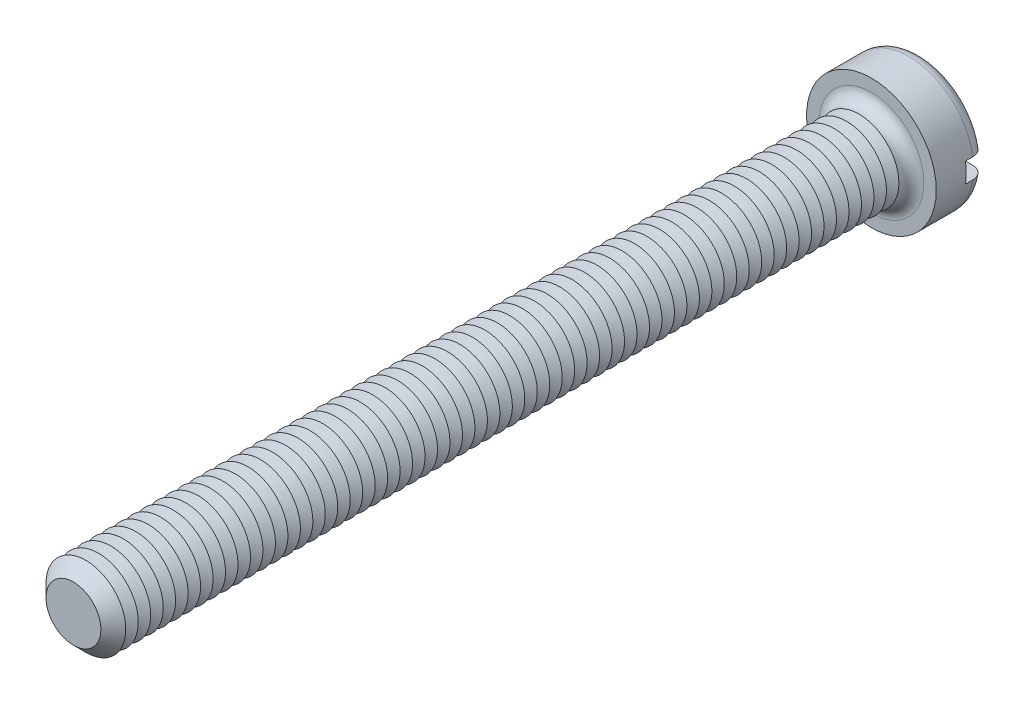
ISO-10303-21;
HEADER;
FILE_DESCRIPTION(('STEP AP214'),'2;1');
FILE_NAME('part.step','',(''),(''),'','','');
FILE_SCHEMA(('AUTOMOTIVE_DESIGN { 1 0 10303 214 1 1 1 1 }'));
ENDSEC;
DATA;
#1=APPLICATION_CONTEXT('core data for automotive mechanical design processes');
#2=APPLICATION_PROTOCOL_DEFINITION('international standard','automotive_design',2000,#1);
#3=PRODUCT_CONTEXT('',#1,'mechanical');
#4=PRODUCT('Part','Part','',(#3));
#5=PRODUCT_RELATED_PRODUCT_CATEGORY('part','',(#4));
#6=PRODUCT_DEFINITION_FORMATION('','',#4);
#7=PRODUCT_DEFINITION_CONTEXT('part definition',#1,'design');
#8=PRODUCT_DEFINITION('design','',#6,#7);
#9=PRODUCT_DEFINITION_SHAPE('','',#8);
#10=(LENGTH_UNIT() NAMED_UNIT(*) SI_UNIT(.MILLI.,.METRE.));
#11=(NAMED_UNIT(*) PLANE_ANGLE_UNIT() SI_UNIT($,.RADIAN.));
#12=(NAMED_UNIT(*) SI_UNIT($,.STERADIAN.) SOLID_ANGLE_UNIT());
#13=UNCERTAINTY_MEASURE_WITH_UNIT(LENGTH_MEASURE(1.E-05),#10,'distance_accuracy_value','');
#14=(GEOMETRIC_REPRESENTATION_CONTEXT(3) GLOBAL_UNCERTAINTY_ASSIGNED_CONTEXT((#13)) GLOBAL_UNIT_ASSIGNED_CONTEXT((#10,
#11,#12)) REPRESENTATION_CONTEXT('',''));
#15=CARTESIAN_POINT('',(0.,0.,0.));
#16=DIRECTION('',(0.,0.,1.));
#17=DIRECTION('',(1.,0.,0.));
#18=AXIS2_PLACEMENT_3D('',#15,#16,#17);
#19=CARTESIAN_POINT('',(0.,0.,-5.));
#20=DIRECTION('',(0.,0.,1.));
#21=DIRECTION('',(1.,0.,0.));
#22=AXIS2_PLACEMENT_3D('',#19,#20,#21);
#23=PLANE('',#22);
#24=CARTESIAN_POINT('',(0.,0.,-5.));
#25=DIRECTION('',(0.,0.,1.));
#26=DIRECTION('',(1.,0.,0.));
#27=AXIS2_PLACEMENT_3D('',#24,#25,#26);
#28=CIRCLE('',#27,5.25);
#29=CARTESIAN_POINT('',(-5.15388203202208,1.,-5.));
#30=VERTEX_POINT('',#29);
#31=CARTESIAN_POINT('',(5.15388203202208,1.,-5.));
#32=VERTEX_POINT('',#31);
#33=EDGE_CURVE('E116',#30,#32,#28,.F.);
#34=ORIENTED_EDGE('',*,*,#33,.T.);
#35=DIRECTION('',(1.,0.,0.));
#36=VECTOR('',#35,1.);
#37=CARTESIAN_POINT('',(-6.5,1.,-5.));
#38=LINE('',#37,#36);
#39=EDGE_CURVE('E111',#30,#32,#38,.T.);
#40=ORIENTED_EDGE('',*,*,#39,.F.);
#41=EDGE_LOOP('',(#34,#40));
#42=FACE_BOUND('',#41,.T.);
#43=ADVANCED_FACE('F39',(#42),#23,.F.);
#44=CARTESIAN_POINT('',(0.,0.,-3.75));
#45=DIRECTION('',(0.,0.,1.));
#46=DIRECTION('',(1.,0.,0.));
#47=AXIS2_PLACEMENT_3D('',#44,#45,#46);
#48=TOROIDAL_SURFACE('',#47,5.25,1.25);
#49=CARTESIAN_POINT('',(-6.04655789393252,1.,-4.63904490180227));
#50=CARTESIAN_POINT('',(-5.99546860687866,1.,-4.68885774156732));
#51=CARTESIAN_POINT('',(-5.94008472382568,1.,-4.73434760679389));
#52=CARTESIAN_POINT('',(-5.8223927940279,1.,-4.81538052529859));
#53=CARTESIAN_POINT('',(-5.7600753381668,1.,-4.85090982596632));
#54=CARTESIAN_POINT('',(-5.63044351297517,1.,-4.91100606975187));
#55=CARTESIAN_POINT('',(-5.56313479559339,1.,-4.93558519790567));
#56=CARTESIAN_POINT('',(-5.42539577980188,1.,-4.97322457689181));
#57=CARTESIAN_POINT('',(-5.35496625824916,1.,-4.98628767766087));
#58=CARTESIAN_POINT('',(-5.21212635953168,1.,-5.00070478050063));
#59=CARTESIAN_POINT('',(-5.13970265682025,1.,-5.00192674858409));
#60=CARTESIAN_POINT('',(-4.99565121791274,1.,-4.99234085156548));
#61=CARTESIAN_POINT('',(-4.92402357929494,1.,-4.98153152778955));
#62=CARTESIAN_POINT('',(-4.78274786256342,1.,-4.94801424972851));
#63=CARTESIAN_POINT('',(-4.71313137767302,1.,-4.92517296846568));
#64=CARTESIAN_POINT('',(-4.57871041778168,1.,-4.86813760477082));
#65=CARTESIAN_POINT('',(-4.51390612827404,1.,-4.83394308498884));
#66=CARTESIAN_POINT('',(-4.39095493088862,1.,-4.75508341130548));
#67=CARTESIAN_POINT('',(-4.33281197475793,1.,-4.7104120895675));
#68=CARTESIAN_POINT('',(-4.22499800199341,1.,-4.61179869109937));
#69=CARTESIAN_POINT('',(-4.17532640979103,1.,-4.55785724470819));
#70=CARTESIAN_POINT('',(-4.08677450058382,1.,-4.4431082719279));
#71=CARTESIAN_POINT('',(-4.0477350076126,1.,-4.38242369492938));
#72=CARTESIAN_POINT('',(-3.98074296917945,1.,-4.25521412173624));
#73=CARTESIAN_POINT('',(-3.95278836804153,1.,-4.18869021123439));
#74=CARTESIAN_POINT('',(-3.90959497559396,1.,-4.0537026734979));
#75=CARTESIAN_POINT('',(-3.89401985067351,1.,-3.98534663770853));
#76=CARTESIAN_POINT('',(-3.8748586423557,1.,-3.84697740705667));
#77=CARTESIAN_POINT('',(-3.87127067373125,1.,-3.7769644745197));
#78=CARTESIAN_POINT('',(-3.8761573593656,1.,-3.63892215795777));
#79=CARTESIAN_POINT('',(-3.88436651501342,1.,-3.57088319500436));
#80=CARTESIAN_POINT('',(-3.91207743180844,1.,-3.43714958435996));
#81=CARTESIAN_POINT('',(-3.93157911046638,1.,-3.37145491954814));
#82=CARTESIAN_POINT('',(-3.98125045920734,1.,-3.24411474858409));
#83=CARTESIAN_POINT('',(-4.01143761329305,1.,-3.18247607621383));
#84=CARTESIAN_POINT('',(-4.08150210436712,1.,-3.064981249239));
#85=CARTESIAN_POINT('',(-4.12138048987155,1.,-3.0091257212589));
#86=CARTESIAN_POINT('',(-4.2106718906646,1.,-2.90336353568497));
#87=CARTESIAN_POINT('',(-4.26028693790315,1.,-2.85362751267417));
#88=CARTESIAN_POINT('',(-4.36696587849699,1.,-2.76291710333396));
#89=CARTESIAN_POINT('',(-4.42403082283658,1.,-2.72194395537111));
#90=CARTESIAN_POINT('',(-4.54567957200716,1.,-2.64877280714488));
#91=CARTESIAN_POINT('',(-4.61042643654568,1.,-2.61684571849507));
#92=CARTESIAN_POINT('',(-4.74430563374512,1.,-2.56412359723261));
#93=CARTESIAN_POINT('',(-4.81343838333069,1.,-2.54332962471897));
#94=CARTESIAN_POINT('',(-4.95527237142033,1.,-2.51320471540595));
#95=CARTESIAN_POINT('',(-5.0280120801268,1.,-2.50405449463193));
#96=CARTESIAN_POINT('',(-5.17399775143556,1.,-2.49810126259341));
#97=CARTESIAN_POINT('',(-5.24724372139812,1.,-2.50129843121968));
#98=CARTESIAN_POINT('',(-5.3921014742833,1.,-2.52000776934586));
#99=CARTESIAN_POINT('',(-5.4637142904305,1.,-2.53551191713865));
#100=CARTESIAN_POINT('',(-5.60326680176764,1.,-2.57846304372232));
#101=CARTESIAN_POINT('',(-5.67120668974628,1.,-2.60590939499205));
#102=CARTESIAN_POINT('',(-5.80064060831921,1.,-2.67164926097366));
#103=CARTESIAN_POINT('',(-5.862199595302,1.,-2.7098148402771));
#104=CARTESIAN_POINT('',(-5.9779079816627,1.,-2.79608690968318));
#105=CARTESIAN_POINT('',(-6.03205795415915,1.,-2.84419263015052));
#106=CARTESIAN_POINT('',(-6.13055119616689,1.,-2.94820522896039));
#107=CARTESIAN_POINT('',(-6.17502887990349,1.,-3.00398483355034));
#108=CARTESIAN_POINT('',(-6.25384180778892,1.,-3.12230113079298));
#109=CARTESIAN_POINT('',(-6.28817779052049,1.,-3.18483733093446));
#110=CARTESIAN_POINT('',(-6.34527986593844,1.,-3.31401726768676));
#111=CARTESIAN_POINT('',(-6.36818984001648,1.,-3.38059742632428));
#112=CARTESIAN_POINT('',(-6.40240470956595,1.,-3.5166725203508));
#113=CARTESIAN_POINT('',(-6.41371067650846,1.,-3.58616718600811));
#114=CARTESIAN_POINT('',(-6.42433240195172,1.,-3.72550026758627));
#115=CARTESIAN_POINT('',(-6.4237441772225,1.,-3.79533138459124));
#116=CARTESIAN_POINT('',(-6.41082814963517,1.,-3.93391789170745));
#117=CARTESIAN_POINT('',(-6.39849757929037,1.,-4.00267302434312));
#118=CARTESIAN_POINT('',(-6.36249191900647,1.,-4.13704597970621));
#119=CARTESIAN_POINT('',(-6.33883072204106,1.,-4.20266753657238));
#120=CARTESIAN_POINT('',(-6.28088769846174,1.,-4.32897165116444));
#121=CARTESIAN_POINT('',(-6.24661890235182,1.,-4.38966015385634));
#122=CARTESIAN_POINT('',(-6.18404039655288,1.,-4.48163773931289));
#123=CARTESIAN_POINT('',(-6.15876600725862,1.,-4.51503333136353));
#124=CARTESIAN_POINT('',(-6.10500607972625,1.,-4.5791298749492));
#125=CARTESIAN_POINT('',(-6.07652056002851,1.,-4.60983084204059));
#126=CARTESIAN_POINT('',(-6.04655789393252,1.,-4.63904490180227));
#127=B_SPLINE_CURVE_WITH_KNOTS('',3,(#49,#50,#51,#52,#53,#54,#55,#56,#57,#58,#59,#60,#61,#62,
#63,#64,#65,#66,#67,#68,#69,#70,#71,#72,#73,#74,#75,#76,#77,#78,#79,#80,#81,#82,#83,#84,#85,#86,
#87,#88,#89,#90,#91,#92,#93,#94,#95,#96,#97,#98,#99,#100,#101,#102,#103,#104,#105,#106,#107,
#108,#109,#110,#111,#112,#113,#114,#115,#116,#117,#118,#119,#120,#121,#122,#123,#124,#125,#126),
.UNSPECIFIED.,.T.,.F.,(4,2,2,2,2,2,2,2,2,2,2,2,2,2,2,2,2,2,2,2,2,2,2,2,2,2,2,2,2,2,2,2,2,2,2,2,
2,2,4),(0.,0.213907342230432,0.428108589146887,0.642070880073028,0.855980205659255,
1.07227200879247,1.28859003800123,1.50735715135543,1.72613269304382,1.94503735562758,
2.16392713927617,2.37933295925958,2.59469881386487,2.80399176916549,3.01325180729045,
3.2178754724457,3.42249764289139,3.62745618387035,3.83243690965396,4.04223444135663,
4.25206160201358,4.46763253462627,4.68322399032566,4.90212226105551,5.12102372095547,
5.33978261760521,5.55853002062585,5.77477015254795,5.99099354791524,6.20398686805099,
6.41696467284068,6.62718821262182,6.83739233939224,7.0459002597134,7.25445733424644,
7.46275934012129,7.67080647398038,7.79625882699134,7.92171045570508),.UNSPECIFIED.);
#128=CARTESIAN_POINT('',(-6.42261628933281,1.,-3.74999999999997));
#129=VERTEX_POINT('',#128);
#130=EDGE_CURVE('E675',#129,#30,#127,.T.);
#131=ORIENTED_EDGE('',*,*,#130,.F.);
#132=CARTESIAN_POINT('',(0.,0.,-3.75));
#133=DIRECTION('',(0.,0.,1.));
#134=DIRECTION('',(1.,0.,0.));
#135=AXIS2_PLACEMENT_3D('',#132,#133,#134);
#136=CIRCLE('',#135,6.5);
#137=CARTESIAN_POINT('',(6.42261628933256,1.,-3.75));
#138=VERTEX_POINT('',#137);
#139=EDGE_CURVE('E125',#138,#129,#136,.T.);
#140=ORIENTED_EDGE('',*,*,#139,.F.);
#141=CARTESIAN_POINT('',(4.06944999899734,1.,-4.4133199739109));
#142=CARTESIAN_POINT('',(4.10828271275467,1.,-4.47354709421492));
#143=CARTESIAN_POINT('',(4.15233880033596,1.,-4.53047894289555));
#144=CARTESIAN_POINT('',(4.24946916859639,1.,-4.63614530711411));
#145=CARTESIAN_POINT('',(4.3025574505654,1.,-4.68486685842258));
#146=CARTESIAN_POINT('',(4.41603250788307,1.,-4.77271114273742));
#147=CARTESIAN_POINT('',(4.47640839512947,1.,-4.8118479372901));
#148=CARTESIAN_POINT('',(4.60277035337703,1.,-4.87959878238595));
#149=CARTESIAN_POINT('',(4.66875480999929,1.,-4.90821584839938));
#150=CARTESIAN_POINT('',(4.80558589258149,1.,-4.95456537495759));
#151=CARTESIAN_POINT('',(4.87649196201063,1.,-4.97212253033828));
#152=CARTESIAN_POINT('',(5.02024710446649,1.,-4.99514979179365));
#153=CARTESIAN_POINT('',(5.09309636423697,1.,-5.00061873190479));
#154=CARTESIAN_POINT('',(5.23902872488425,1.,-4.99926689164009));
#155=CARTESIAN_POINT('',(5.31211131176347,1.,-4.99238812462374));
#156=CARTESIAN_POINT('',(5.45605806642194,1.,-4.96635140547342));
#157=CARTESIAN_POINT('',(5.52692231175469,1.,-4.94719388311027));
#158=CARTESIAN_POINT('',(5.66376170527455,1.,-4.89728421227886));
#159=CARTESIAN_POINT('',(5.72977335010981,1.,-4.86663219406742));
#160=CARTESIAN_POINT('',(5.85560715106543,1.,-4.79452334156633));
#161=CARTESIAN_POINT('',(5.91542977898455,1.,-4.7530673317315));
#162=CARTESIAN_POINT('',(6.02626022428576,1.,-4.66116821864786));
#163=CARTESIAN_POINT('',(6.07738307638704,1.,-4.6108638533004));
#164=CARTESIAN_POINT('',(6.17030947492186,1.,-4.50227823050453));
#165=CARTESIAN_POINT('',(6.2121137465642,1.,-4.44399759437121));
#166=CARTESIAN_POINT('',(6.28460268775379,1.,-4.32200305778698));
#167=CARTESIAN_POINT('',(6.31543589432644,1.,-4.2583773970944));
#168=CARTESIAN_POINT('',(6.36586009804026,1.,-4.12681721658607));
#169=CARTESIAN_POINT('',(6.38545178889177,1.,-4.0588829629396));
#170=CARTESIAN_POINT('',(6.41265760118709,1.,-3.92136007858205));
#171=CARTESIAN_POINT('',(6.42038873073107,1.,-3.85179457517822));
#172=CARTESIAN_POINT('',(6.42401070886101,1.,-3.7123569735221));
#173=CARTESIAN_POINT('',(6.41990193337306,1.,-3.64248488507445));
#174=CARTESIAN_POINT('',(6.40000894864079,1.,-3.50470871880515));
#175=CARTESIAN_POINT('',(6.38427119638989,1.,-3.43679792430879));
#176=CARTESIAN_POINT('',(6.34164491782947,1.,-3.30457296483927));
#177=CARTESIAN_POINT('',(6.31475638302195,1.,-3.24025880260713));
#178=CARTESIAN_POINT('',(6.2505455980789,1.,-3.11686791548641));
#179=CARTESIAN_POINT('',(6.21319759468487,1.,-3.05780459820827));
#180=CARTESIAN_POINT('',(6.12919411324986,1.,-2.94671919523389));
#181=CARTESIAN_POINT('',(6.08253833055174,1.,-2.89469734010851));
#182=CARTESIAN_POINT('',(5.98083387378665,1.,-2.79868150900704));
#183=CARTESIAN_POINT('',(5.92571704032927,1.,-2.75475975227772));
#184=CARTESIAN_POINT('',(5.80897194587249,1.,-2.67665277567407));
#185=CARTESIAN_POINT('',(5.74734329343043,1.,-2.64246814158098));
#186=CARTESIAN_POINT('',(5.6184644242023,1.,-2.58431810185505));
#187=CARTESIAN_POINT('',(5.55115102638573,1.,-2.56049275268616));
#188=CARTESIAN_POINT('',(5.41351272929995,1.,-2.52429868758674));
#189=CARTESIAN_POINT('',(5.34318759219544,1.,-2.51193087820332));
#190=CARTESIAN_POINT('',(5.20041507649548,1.,-2.49882112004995));
#191=CARTESIAN_POINT('',(5.12795169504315,1.,-2.49825332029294));
#192=CARTESIAN_POINT('',(4.98393373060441,1.,-2.50914771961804));
#193=CARTESIAN_POINT('',(4.91237921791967,1.,-2.52061084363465));
#194=CARTESIAN_POINT('',(4.77137358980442,1.,-2.55542281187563));
#195=CARTESIAN_POINT('',(4.70195472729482,1.,-2.57890245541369));
#196=CARTESIAN_POINT('',(4.56803538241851,1.,-2.63717701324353));
#197=CARTESIAN_POINT('',(4.50353509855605,1.,-2.67197238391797));
#198=CARTESIAN_POINT('',(4.38131858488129,1.,-2.7519648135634));
#199=CARTESIAN_POINT('',(4.32360365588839,1.,-2.79716386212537));
#200=CARTESIAN_POINT('',(4.21673400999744,1.,-2.89675634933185));
#201=CARTESIAN_POINT('',(4.16757871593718,1.,-2.95114916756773));
#202=CARTESIAN_POINT('',(4.08014713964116,1.,-3.06667703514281));
#203=CARTESIAN_POINT('',(4.04170608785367,1.,-3.12768727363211));
#204=CARTESIAN_POINT('',(3.97596192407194,1.,-3.25543782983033));
#205=CARTESIAN_POINT('',(3.94865624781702,1.,-3.32217682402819));
#206=CARTESIAN_POINT('',(3.9067737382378,1.,-3.45745603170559));
#207=CARTESIAN_POINT('',(3.89185707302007,1.,-3.52589108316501));
#208=CARTESIAN_POINT('',(3.87400755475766,1.,-3.66432360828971));
#209=CARTESIAN_POINT('',(3.87107601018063,1.,-3.73432125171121));
#210=CARTESIAN_POINT('',(3.8772387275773,1.,-3.87228267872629));
#211=CARTESIAN_POINT('',(3.88607933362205,1.,-3.94025811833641));
#212=CARTESIAN_POINT('',(3.91502769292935,1.,-4.07370133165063));
#213=CARTESIAN_POINT('',(3.93512131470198,1.,-4.1391721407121));
#214=CARTESIAN_POINT('',(3.9752037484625,1.,-4.23926719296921));
#215=CARTESIAN_POINT('',(3.99171171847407,1.,-4.27532618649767));
#216=CARTESIAN_POINT('',(4.02809737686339,1.,-4.34569933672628));
#217=CARTESIAN_POINT('',(4.04797497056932,1.,-4.3800135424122));
#218=CARTESIAN_POINT('',(4.06944999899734,1.,-4.4133199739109));
#219=B_SPLINE_CURVE_WITH_KNOTS('',3,(#141,#142,#143,#144,#145,#146,#147,#148,#149,#150,#151,
#152,#153,#154,#155,#156,#157,#158,#159,#160,#161,#162,#163,#164,#165,#166,#167,#168,#169,#170,
#171,#172,#173,#174,#175,#176,#177,#178,#179,#180,#181,#182,#183,#184,#185,#186,#187,#188,#189,
#190,#191,#192,#193,#194,#195,#196,#197,#198,#199,#200,#201,#202,#203,#204,#205,#206,#207,#208,
#209,#210,#211,#212,#213,#214,#215,#216,#217,#218),.UNSPECIFIED.,.T.,.F.,(4,2,2,2,2,2,2,2,2,2,2,
2,2,2,2,2,2,2,2,2,2,2,2,2,2,2,2,2,2,2,2,2,2,2,2,2,2,2,4),(0.,0.214833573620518,
0.430003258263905,0.644855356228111,0.859645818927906,1.0777603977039,1.29589601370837,
1.51505870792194,1.73421373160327,1.95150241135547,2.16877451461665,2.38290237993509,
2.59701357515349,2.8081044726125,3.01918234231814,3.22816416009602,3.43713934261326,
3.64528416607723,3.85342914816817,4.06209119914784,4.27076008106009,4.48120788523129,
4.69166834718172,4.90489186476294,5.11813225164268,5.33451752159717,5.55091942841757,
5.76972860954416,5.98854661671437,6.20740650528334,6.42625163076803,6.64151774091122,
6.85673425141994,7.0658317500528,7.27495207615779,7.47963858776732,7.68406862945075,
7.80287790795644,7.92168384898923),.UNSPECIFIED.);
#220=EDGE_CURVE('E677',#32,#138,#219,.T.);
#221=ORIENTED_EDGE('',*,*,#220,.F.);
#222=ORIENTED_EDGE('',*,*,#33,.F.);
#223=EDGE_LOOP('',(#131,#140,#221,#222));
#224=FACE_BOUND('',#223,.T.);
#225=ADVANCED_FACE('F659',(#224),#48,.T.);
#226=CARTESIAN_POINT('',(0.,0.,-5.));
#227=DIRECTION('',(0.,0.,1.));
#228=DIRECTION('',(1.,0.,0.));
#229=AXIS2_PLACEMENT_3D('',#226,#227,#228);
#230=CYLINDRICAL_SURFACE('',#229,6.5);
#231=DIRECTION('',(0.,0.,1.));
#232=VECTOR('',#231,1.);
#233=CARTESIAN_POINT('',(6.42261628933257,1.,-5.));
#234=LINE('',#233,#232);
#235=CARTESIAN_POINT('',(6.42261628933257,1.,-3.));
#236=VERTEX_POINT('',#235);
#237=EDGE_CURVE('E693',#138,#236,#234,.T.);
#238=ORIENTED_EDGE('',*,*,#237,.F.);
#239=ORIENTED_EDGE('',*,*,#139,.T.);
#240=DIRECTION('',(0.,0.,1.));
#241=VECTOR('',#240,1.);
#242=CARTESIAN_POINT('',(-6.42261628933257,1.,-5.));
#243=LINE('',#242,#241);
#244=CARTESIAN_POINT('',(-6.42261628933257,1.,-3.));
#245=VERTEX_POINT('',#244);
#246=EDGE_CURVE('E63',#245,#129,#243,.F.);
#247=ORIENTED_EDGE('',*,*,#246,.F.);
#248=CARTESIAN_POINT('',(0.,0.,-3.));
#249=DIRECTION('',(0.,0.,-1.));
#250=DIRECTION('',(-1.,0.,0.));
#251=AXIS2_PLACEMENT_3D('',#248,#249,#250);
#252=CIRCLE('',#251,6.5);
#253=CARTESIAN_POINT('',(-6.42261628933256,-0.999999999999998,-3.));
#254=VERTEX_POINT('',#253);
#255=EDGE_CURVE('E43',#245,#254,#252,.F.);
#256=ORIENTED_EDGE('',*,*,#255,.T.);
#257=DIRECTION('',(0.,0.,1.));
#258=VECTOR('',#257,1.);
#259=CARTESIAN_POINT('',(-6.42261628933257,-0.999999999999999,-5.));
#260=LINE('',#259,#258);
#261=CARTESIAN_POINT('',(-6.42261628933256,-0.999999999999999,-3.75));
#262=VERTEX_POINT('',#261);
#263=EDGE_CURVE('E690',#262,#254,#260,.T.);
#264=ORIENTED_EDGE('',*,*,#263,.F.);
#265=CARTESIAN_POINT('',(6.42261628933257,-1.,-3.75));
#266=VERTEX_POINT('',#265);
#267=EDGE_CURVE('E127',#262,#266,#136,.T.);
#268=ORIENTED_EDGE('',*,*,#267,.T.);
#269=DIRECTION('',(0.,0.,1.));
#270=VECTOR('',#269,1.);
#271=CARTESIAN_POINT('',(6.42261628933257,-1.,-5.));
#272=LINE('',#271,#270);
#273=CARTESIAN_POINT('',(6.42261628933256,-1.,-3.));
#274=VERTEX_POINT('',#273);
#275=EDGE_CURVE('E55',#274,#266,#272,.F.);
#276=ORIENTED_EDGE('',*,*,#275,.F.);
#277=EDGE_CURVE('E11',#274,#236,#252,.F.);
#278=ORIENTED_EDGE('',*,*,#277,.T.);
#279=EDGE_LOOP('',(#238,#239,#247,#256,#264,#268,#276,#278));
#280=FACE_BOUND('',#279,.T.);
#281=CARTESIAN_POINT('',(0.,0.,0.));
#282=DIRECTION('',(0.,0.,1.));
#283=DIRECTION('',(1.,0.,0.));
#284=AXIS2_PLACEMENT_3D('',#281,#282,#283);
#285=CIRCLE('',#284,6.5);
#286=CARTESIAN_POINT('',(6.5,0.,0.));
#287=VERTEX_POINT('',#286);
#288=EDGE_CURVE('E696',#287,#287,#285,.T.);
#289=ORIENTED_EDGE('',*,*,#288,.F.);
#290=EDGE_LOOP('',(#289));
#291=FACE_BOUND('',#290,.T.);
#292=ADVANCED_FACE('F655',(#280,#291),#230,.T.);
#293=CARTESIAN_POINT('',(5.15388203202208,-1.,-5.));
#294=VERTEX_POINT('',#293);
#295=CARTESIAN_POINT('',(-5.15388203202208,-0.999999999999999,-5.));
#296=VERTEX_POINT('',#295);
#297=EDGE_CURVE('E109',#294,#296,#28,.F.);
#298=ORIENTED_EDGE('',*,*,#297,.T.);
#299=DIRECTION('',(-1.,0.,0.));
#300=VECTOR('',#299,1.);
#301=CARTESIAN_POINT('',(-6.5,-0.999999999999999,-5.));
#302=LINE('',#301,#300);
#303=EDGE_CURVE('E96',#294,#296,#302,.T.);
#304=ORIENTED_EDGE('',*,*,#303,.F.);
#305=EDGE_LOOP('',(#298,#304));
#306=FACE_BOUND('',#305,.T.);
#307=ADVANCED_FACE('F108',(#306),#23,.F.);
#308=CARTESIAN_POINT('',(0.,0.,0.));
#309=DIRECTION('',(0.,0.,1.));
#310=DIRECTION('',(1.,0.,0.));
#311=AXIS2_PLACEMENT_3D('',#308,#309,#310);
#312=PLANE('',#311);
#313=CARTESIAN_POINT('',(0.,0.,0.));
#314=DIRECTION('',(0.,0.,1.));
#315=DIRECTION('',(1.,0.,0.));
#316=AXIS2_PLACEMENT_3D('',#313,#314,#315);
#317=CIRCLE('',#316,5.25);
#318=CARTESIAN_POINT('',(5.25,0.,0.));
#319=VERTEX_POINT('',#318);
#320=EDGE_CURVE('E115',#319,#319,#317,.F.);
#321=ORIENTED_EDGE('',*,*,#320,.T.);
#322=EDGE_LOOP('',(#321));
#323=FACE_BOUND('',#322,.T.);
#324=ORIENTED_EDGE('',*,*,#288,.T.);
#325=EDGE_LOOP('',(#324));
#326=FACE_BOUND('',#325,.T.);
#327=ADVANCED_FACE('F654',(#323,#326),#312,.T.);
#328=CARTESIAN_POINT('',(-6.04655789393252,-0.999999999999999,-4.63904490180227));
#329=CARTESIAN_POINT('',(-6.0966604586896,-0.999999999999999,-4.59018532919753));
#330=CARTESIAN_POINT('',(-6.14270501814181,-0.999999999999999,-4.53709744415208));
#331=CARTESIAN_POINT('',(-6.22528519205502,-0.999999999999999,-4.42391631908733));
#332=CARTESIAN_POINT('',(-6.26181074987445,-0.999999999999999,-4.36381576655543));
#333=CARTESIAN_POINT('',(-6.32422109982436,-0.999999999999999,-4.23831836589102));
#334=CARTESIAN_POINT('',(-6.35010658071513,-0.999999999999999,-4.17292186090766));
#335=CARTESIAN_POINT('',(-6.39044668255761,-0.999999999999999,-4.03870925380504));
#336=CARTESIAN_POINT('',(-6.40490396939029,-0.999999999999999,-3.96989395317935));
#337=CARTESIAN_POINT('',(-6.42190814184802,-0.999999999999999,-3.83122595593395));
#338=CARTESIAN_POINT('',(-6.4245257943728,-0.999999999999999,-3.76138193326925));
#339=CARTESIAN_POINT('',(-6.41796432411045,-0.999999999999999,-3.62224935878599));
#340=CARTESIAN_POINT('',(-6.40878509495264,-0.999999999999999,-3.55296081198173));
#341=CARTESIAN_POINT('',(-6.37894560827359,-0.999999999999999,-3.41709241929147));
#342=CARTESIAN_POINT('',(-6.35831520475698,-0.999999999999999,-3.35050601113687));
#343=CARTESIAN_POINT('',(-6.30620980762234,-0.999999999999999,-3.22172312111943));
#344=CARTESIAN_POINT('',(-6.2747347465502,-0.999999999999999,-3.15952666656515));
#345=CARTESIAN_POINT('',(-6.20172710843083,-0.999999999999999,-3.04101762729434));
#346=CARTESIAN_POINT('',(-6.16015622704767,-0.999999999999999,-2.98472864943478));
#347=CARTESIAN_POINT('',(-6.06823774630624,-0.999999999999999,-2.87984578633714));
#348=CARTESIAN_POINT('',(-6.01788981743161,-0.999999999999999,-2.83125219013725));
#349=CARTESIAN_POINT('',(-5.90933830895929,-0.999999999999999,-2.74262118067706));
#350=CARTESIAN_POINT('',(-5.85106338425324,-0.999999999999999,-2.70267117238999));
#351=CARTESIAN_POINT('',(-5.72870702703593,-0.999999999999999,-2.63296796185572));
#352=CARTESIAN_POINT('',(-5.66462521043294,-0.999999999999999,-2.6032154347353));
#353=CARTESIAN_POINT('',(-5.53153273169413,-0.999999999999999,-2.55430842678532));
#354=CARTESIAN_POINT('',(-5.46246626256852,-0.999999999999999,-2.53530583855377));
#355=CARTESIAN_POINT('',(-5.32214267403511,-0.999999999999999,-2.5089831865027));
#356=CARTESIAN_POINT('',(-5.25088537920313,-0.999999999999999,-2.50166406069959));
#357=CARTESIAN_POINT('',(-5.10710123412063,-0.999999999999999,-2.49882202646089));
#358=CARTESIAN_POINT('',(-5.03457095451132,-0.999999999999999,-2.50347166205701));
#359=CARTESIAN_POINT('',(-4.8912897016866,-0.999999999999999,-2.52476029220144));
#360=CARTESIAN_POINT('',(-4.82053886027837,-0.999999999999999,-2.54140017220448));
#361=CARTESIAN_POINT('',(-4.68213257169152,-0.999999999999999,-2.58641614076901));
#362=CARTESIAN_POINT('',(-4.61451256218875,-0.999999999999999,-2.61490131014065));
#363=CARTESIAN_POINT('',(-4.48502801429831,-0.999999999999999,-2.68285095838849));
#364=CARTESIAN_POINT('',(-4.42316359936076,-0.999999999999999,-2.72231567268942));
#365=CARTESIAN_POINT('',(-4.30720694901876,-0.999999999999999,-2.81103994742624));
#366=CARTESIAN_POINT('',(-4.25309118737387,-0.999999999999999,-2.86026872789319));
#367=CARTESIAN_POINT('',(-4.15409408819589,-0.999999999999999,-2.9672764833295));
#368=CARTESIAN_POINT('',(-4.10921182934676,-0.999999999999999,-3.02505460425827));
#369=CARTESIAN_POINT('',(-4.03096584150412,-0.999999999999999,-3.14632492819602));
#370=CARTESIAN_POINT('',(-3.99739097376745,-0.999999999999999,-3.2096807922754));
#371=CARTESIAN_POINT('',(-3.94171839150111,-0.999999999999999,-3.34124912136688));
#372=CARTESIAN_POINT('',(-3.91961840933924,-0.999999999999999,-3.40946062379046));
#373=CARTESIAN_POINT('',(-3.88816636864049,-0.999999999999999,-3.54669256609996));
#374=CARTESIAN_POINT('',(-3.87846562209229,-0.999999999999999,-3.61563318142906));
#375=CARTESIAN_POINT('',(-3.87100568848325,-0.999999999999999,-3.75415397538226));
#376=CARTESIAN_POINT('',(-3.87324501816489,-0.999999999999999,-3.82373407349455));
#377=CARTESIAN_POINT('',(-3.88943589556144,-0.999999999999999,-3.96027701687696));
#378=CARTESIAN_POINT('',(-3.90318225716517,-0.999999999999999,-4.0272643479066));
#379=CARTESIAN_POINT('',(-3.94163954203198,-0.999999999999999,-4.1580093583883));
#380=CARTESIAN_POINT('',(-3.96635075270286,-0.999999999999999,-4.22176695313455));
#381=CARTESIAN_POINT('',(-4.026160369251,-0.999999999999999,-4.34483320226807));
#382=CARTESIAN_POINT('',(-4.06134035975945,-0.999999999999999,-4.40410214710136));
#383=CARTESIAN_POINT('',(-4.14090865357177,-0.999999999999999,-4.51609417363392));
#384=CARTESIAN_POINT('',(-4.18529811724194,-0.999999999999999,-4.56881642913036));
#385=CARTESIAN_POINT('',(-4.2832649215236,-0.999999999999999,-4.66770177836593));
#386=CARTESIAN_POINT('',(-4.33705327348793,-0.999999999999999,-4.71365579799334));
#387=CARTESIAN_POINT('',(-4.45141776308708,-0.999999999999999,-4.79615385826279));
#388=CARTESIAN_POINT('',(-4.51199483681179,-0.999999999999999,-4.83269659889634));
#389=CARTESIAN_POINT('',(-4.63989216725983,-0.999999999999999,-4.89626962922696));
#390=CARTESIAN_POINT('',(-4.70734508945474,-0.999999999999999,-4.92303326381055));
#391=CARTESIAN_POINT('',(-4.84575497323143,-0.999999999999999,-4.96500199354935));
#392=CARTESIAN_POINT('',(-4.91671207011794,-0.999999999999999,-4.98020664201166));
#393=CARTESIAN_POINT('',(-5.06097761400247,-0.999999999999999,-4.9987306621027));
#394=CARTESIAN_POINT('',(-5.13430353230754,-0.999999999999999,-5.00191441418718));
#395=CARTESIAN_POINT('',(-5.28046546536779,-0.999999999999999,-4.99587686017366));
#396=CARTESIAN_POINT('',(-5.35330135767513,-0.999999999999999,-4.98665256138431));
#397=CARTESIAN_POINT('',(-5.49610354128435,-0.999999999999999,-4.95604184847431));
#398=CARTESIAN_POINT('',(-5.56607890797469,-0.999999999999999,-4.93469772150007));
#399=CARTESIAN_POINT('',(-5.70131538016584,-0.999999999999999,-4.88041956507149));
#400=CARTESIAN_POINT('',(-5.76658233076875,-0.999999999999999,-4.84750021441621));
#401=CARTESIAN_POINT('',(-5.86782577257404,-0.999999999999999,-4.78498748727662));
#402=CARTESIAN_POINT('',(-5.90579749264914,-0.999999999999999,-4.75856648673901));
#403=CARTESIAN_POINT('',(-5.97862186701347,-0.999999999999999,-4.70172646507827));
#404=CARTESIAN_POINT('',(-6.0134745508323,-0.999999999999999,-4.6713074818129));
#405=CARTESIAN_POINT('',(-6.04655789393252,-0.999999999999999,-4.63904490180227));
#406=B_SPLINE_CURVE_WITH_KNOTS('',3,(#328,#329,#330,#331,#332,#333,#334,#335,#336,#337,#338,
#339,#340,#341,#342,#343,#344,#345,#346,#347,#348,#349,#350,#351,#352,#353,#354,#355,#356,#357,
#358,#359,#360,#361,#362,#363,#364,#365,#366,#367,#368,#369,#370,#371,#372,#373,#374,#375,#376,
#377,#378,#379,#380,#381,#382,#383,#384,#385,#386,#387,#388,#389,#390,#391,#392,#393,#394,#395,
#396,#397,#398,#399,#400,#401,#402,#403,#404,#405),.UNSPECIFIED.,.T.,.F.,(4,2,2,2,2,2,2,2,2,2,2,
2,2,2,2,2,2,2,2,2,2,2,2,2,2,2,2,2,2,2,2,2,2,2,2,2,2,2,4),(0.,0.209780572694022,
0.419781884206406,0.629769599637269,0.839708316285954,1.04839053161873,1.2570746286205,
1.46521720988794,1.67336108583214,1.88230736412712,2.09126148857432,2.30223890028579,
2.51323027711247,2.72713284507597,2.94105258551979,3.15807345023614,3.37511034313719,
3.59419176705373,3.81327788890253,4.03168404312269,4.25006839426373,4.46411376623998,
4.67811682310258,4.88595885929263,5.09377507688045,5.29796268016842,5.50215563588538,
5.70798353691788,5.91383738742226,6.12510741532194,6.33640661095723,6.55309998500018,
6.76980173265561,6.98894112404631,7.20813337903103,7.42656551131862,7.64472163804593,
7.78324365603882,7.92176436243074),.UNSPECIFIED.);
#407=EDGE_CURVE('E103',#296,#262,#406,.T.);
#408=ORIENTED_EDGE('',*,*,#407,.F.);
#409=ORIENTED_EDGE('',*,*,#297,.F.);
#410=CARTESIAN_POINT('',(4.06944999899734,-1.,-4.4133199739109));
#411=CARTESIAN_POINT('',(4.03213207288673,-1.,-4.3554312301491));
#412=CARTESIAN_POINT('',(3.9995849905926,-1.,-4.29441722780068));
#413=CARTESIAN_POINT('',(3.94511822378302,-1.,-4.16776604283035));
#414=CARTESIAN_POINT('',(3.92320762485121,-1.,-4.10212496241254));
#415=CARTESIAN_POINT('',(3.89078811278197,-1.,-3.96804412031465));
#416=CARTESIAN_POINT('',(3.88028409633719,-1.,-3.89960316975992));
#417=CARTESIAN_POINT('',(3.87107895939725,-1.,-3.76194650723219));
#418=CARTESIAN_POINT('',(3.87237511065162,-1.,-3.69273097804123));
#419=CARTESIAN_POINT('',(3.88662927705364,-1.,-3.55634460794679));
#420=CARTESIAN_POINT('',(3.89944923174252,-1.,-3.48915926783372));
#421=CARTESIAN_POINT('',(3.93611188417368,-1.,-3.35786953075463));
#422=CARTESIAN_POINT('',(3.95995518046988,-1.,-3.29376530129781));
#423=CARTESIAN_POINT('',(4.0180748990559,-1.,-3.16993562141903));
#424=CARTESIAN_POINT('',(4.05242297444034,-1.,-3.11024385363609));
#425=CARTESIAN_POINT('',(4.13041121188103,-1.,-2.9972793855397));
#426=CARTESIAN_POINT('',(4.17405248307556,-1.,-2.94400745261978));
#427=CARTESIAN_POINT('',(4.27058636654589,-1.,-2.8439150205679));
#428=CARTESIAN_POINT('',(4.32368948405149,-1.,-2.79729757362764));
#429=CARTESIAN_POINT('',(4.43679856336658,-1.,-2.71336600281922));
#430=CARTESIAN_POINT('',(4.49680546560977,-1.,-2.67605314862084));
#431=CARTESIAN_POINT('',(4.62370121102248,-1.,-2.61081752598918));
#432=CARTESIAN_POINT('',(4.69072799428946,-1.,-2.58316284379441));
#433=CARTESIAN_POINT('',(4.82843981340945,-1.,-2.5393441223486));
#434=CARTESIAN_POINT('',(4.899125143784,-1.,-2.52318100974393));
#435=CARTESIAN_POINT('',(5.04306377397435,-1.,-2.50267755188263));
#436=CARTESIAN_POINT('',(5.11633773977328,-1.,-2.49848181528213));
#437=CARTESIAN_POINT('',(5.26254809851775,-1.,-2.50249357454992));
#438=CARTESIAN_POINT('',(5.33548449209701,-1.,-2.51070104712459));
#439=CARTESIAN_POINT('',(5.4786703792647,-1.,-2.53930888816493));
#440=CARTESIAN_POINT('',(5.54892819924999,-1.,-2.5596675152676));
#441=CARTESIAN_POINT('',(5.68495799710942,-1.,-2.61204238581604));
#442=CARTESIAN_POINT('',(5.75073024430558,-1.,-2.64405792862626));
#443=CARTESIAN_POINT('',(5.8750178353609,-1.,-2.7184150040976));
#444=CARTESIAN_POINT('',(5.93361487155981,-1.,-2.76061995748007));
#445=CARTESIAN_POINT('',(6.04275377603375,-1.,-2.85440601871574));
#446=CARTESIAN_POINT('',(6.09329629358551,-1.,-2.90598637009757));
#447=CARTESIAN_POINT('',(6.18409572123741,-1.,-3.01622977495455));
#448=CARTESIAN_POINT('',(6.2244945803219,-1.,-3.07477592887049));
#449=CARTESIAN_POINT('',(6.29474798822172,-1.,-3.19788594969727));
#450=CARTESIAN_POINT('',(6.3246032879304,-1.,-3.26244938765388));
#451=CARTESIAN_POINT('',(6.37256001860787,-1.,-3.39491634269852));
#452=CARTESIAN_POINT('',(6.39079949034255,-1.,-3.46276990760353));
#453=CARTESIAN_POINT('',(6.41554133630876,-1.,-3.60058363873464));
#454=CARTESIAN_POINT('',(6.42204424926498,-1.,-3.67054370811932));
#455=CARTESIAN_POINT('',(6.42311237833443,-1.,-3.81007982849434));
#456=CARTESIAN_POINT('',(6.41775799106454,-1.,-3.879655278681));
#457=CARTESIAN_POINT('',(6.39543799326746,-1.,-4.01691664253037));
#458=CARTESIAN_POINT('',(6.3784725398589,-1.,-4.08460258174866));
#459=CARTESIAN_POINT('',(6.33344768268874,-1.,-4.21614537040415));
#460=CARTESIAN_POINT('',(6.30539273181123,-1.,-4.28000374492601));
#461=CARTESIAN_POINT('',(6.23902076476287,-1.,-4.40214140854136));
#462=CARTESIAN_POINT('',(6.20070356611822,-1.,-4.46042059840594));
#463=CARTESIAN_POINT('',(6.11467174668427,-1.,-4.5701315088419));
#464=CARTESIAN_POINT('',(6.06690270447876,-1.,-4.62152053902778));
#465=CARTESIAN_POINT('',(5.96350111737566,-1.,-4.715657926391));
#466=CARTESIAN_POINT('',(5.90786817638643,-1.,-4.75840584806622));
#467=CARTESIAN_POINT('',(5.78965380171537,-1.,-4.8345781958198));
#468=CARTESIAN_POINT('',(5.72700078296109,-1.,-4.86789149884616));
#469=CARTESIAN_POINT('',(5.59704977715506,-1.,-4.92369754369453));
#470=CARTESIAN_POINT('',(5.52975144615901,-1.,-4.94618948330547));
#471=CARTESIAN_POINT('',(5.39137621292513,-1.,-4.98006173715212));
#472=CARTESIAN_POINT('',(5.32025859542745,-1.,-4.99127571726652));
#473=CARTESIAN_POINT('',(5.17715081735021,-1.,-5.00177798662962));
#474=CARTESIAN_POINT('',(5.10516061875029,-1.,-5.00106575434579));
#475=CARTESIAN_POINT('',(4.96131924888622,-1.,-4.98769775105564));
#476=CARTESIAN_POINT('',(4.88948297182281,-1.,-4.97488146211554));
#477=CARTESIAN_POINT('',(4.74893184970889,-1.,-4.93744335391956));
#478=CARTESIAN_POINT('',(4.68021795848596,-1.,-4.91281795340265));
#479=CARTESIAN_POINT('',(4.54744428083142,-1.,-4.8522329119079));
#480=CARTESIAN_POINT('',(4.48341761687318,-1.,-4.81620070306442));
#481=CARTESIAN_POINT('',(4.36244497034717,-1.,-4.73383277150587));
#482=CARTESIAN_POINT('',(4.30549069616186,-1.,-4.68750929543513));
#483=CARTESIAN_POINT('',(4.21823158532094,-1.,-4.60311228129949));
#484=CARTESIAN_POINT('',(4.18544074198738,-1.,-4.56757118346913));
#485=CARTESIAN_POINT('',(4.12413461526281,-1.,-4.49297229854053));
#486=CARTESIAN_POINT('',(4.09561926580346,-1.,-4.45391456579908));
#487=CARTESIAN_POINT('',(4.06944999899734,-1.,-4.4133199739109));
#488=B_SPLINE_CURVE_WITH_KNOTS('',3,(#410,#411,#412,#413,#414,#415,#416,#417,#418,#419,#420,
#421,#422,#423,#424,#425,#426,#427,#428,#429,#430,#431,#432,#433,#434,#435,#436,#437,#438,#439,
#440,#441,#442,#443,#444,#445,#446,#447,#448,#449,#450,#451,#452,#453,#454,#455,#456,#457,#458,
#459,#460,#461,#462,#463,#464,#465,#466,#467,#468,#469,#470,#471,#472,#473,#474,#475,#476,#477,
#478,#479,#480,#481,#482,#483,#484,#485,#486,#487),.UNSPECIFIED.,.T.,.F.,(4,2,2,2,2,2,2,2,2,2,2,
2,2,2,2,2,2,2,2,2,2,2,2,2,2,2,2,2,2,2,2,2,2,2,2,2,2,2,4),(0.,0.206453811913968,0.4130836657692,
0.619802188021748,0.826472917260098,1.03070015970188,1.23493849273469,1.44060223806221,
1.64629054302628,1.85731119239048,2.06836062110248,2.28487349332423,2.5014038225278,
2.72053974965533,2.9396752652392,3.15806230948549,3.37643622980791,3.59203140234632,
3.80760918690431,4.01997696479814,4.23232961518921,4.44210913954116,4.65187903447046,
4.86023097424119,5.06858009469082,5.27684563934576,5.48511488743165,5.69462015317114,
5.90413597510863,6.11602561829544,6.32793096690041,6.54291770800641,6.75791385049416,
6.97580180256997,7.19375587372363,7.41312537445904,7.63223520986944,7.77701357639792,
7.92178970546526),.UNSPECIFIED.);
#489=EDGE_CURVE('E92',#266,#294,#488,.T.);
#490=ORIENTED_EDGE('',*,*,#489,.F.);
#491=ORIENTED_EDGE('',*,*,#267,.F.);
#492=EDGE_LOOP('',(#408,#409,#490,#491));
#493=FACE_BOUND('',#492,.T.);
#494=ADVANCED_FACE('F113',(#493),#48,.T.);
#495=CARTESIAN_POINT('',(0.,0.,1.25));
#496=DIRECTION('',(0.,0.,1.));
#497=DIRECTION('',(1.,0.,0.));
#498=AXIS2_PLACEMENT_3D('',#495,#496,#497);
#499=TOROIDAL_SURFACE('',#498,5.25,1.25);
#500=ORIENTED_EDGE('',*,*,#320,.F.);
#501=EDGE_LOOP('',(#500));
#502=FACE_BOUND('',#501,.T.);
#503=CARTESIAN_POINT('',(0.,0.,1.25));
#504=DIRECTION('',(0.,0.,-1.));
#505=DIRECTION('',(-1.,0.,0.));
#506=AXIS2_PLACEMENT_3D('',#503,#504,#505);
#507=CIRCLE('',#506,4.);
#508=CARTESIAN_POINT('',(-4.,0.,1.25));
#509=VERTEX_POINT('',#508);
#510=EDGE_CURVE('E701',#509,#509,#507,.T.);
#511=ORIENTED_EDGE('',*,*,#510,.T.);
#512=EDGE_LOOP('',(#511));
#513=FACE_BOUND('',#512,.T.);
#514=ADVANCED_FACE('F647',(#502,#513),#499,.F.);
#515=CARTESIAN_POINT('',(0.,0.,1.875));
#516=DIRECTION('',(0.,0.,-1.));
#517=DIRECTION('',(-1.,0.,0.));
#518=AXIS2_PLACEMENT_3D('',#515,#516,#517);
#519=CONICAL_SURFACE('',#518,2.91746824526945,1.0471975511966);
#520=ORIENTED_EDGE('',*,*,#510,.F.);
#521=EDGE_LOOP('',(#520));
#522=FACE_BOUND('',#521,.T.);
#523=CARTESIAN_POINT('',(0.,0.,1.875));
#524=DIRECTION('',(0.,0.,-1.));
#525=DIRECTION('',(-1.,0.,0.));
#526=AXIS2_PLACEMENT_3D('',#523,#524,#525);
#527=CIRCLE('',#526,2.91746824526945);
#528=CARTESIAN_POINT('',(-2.91746824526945,0.,1.875));
#529=VERTEX_POINT('',#528);
#530=EDGE_CURVE('E708',#529,#529,#527,.T.);
#531=ORIENTED_EDGE('',*,*,#530,.T.);
#532=EDGE_LOOP('',(#531));
#533=FACE_BOUND('',#532,.T.);
#534=ADVANCED_FACE('F643',(#522,#533),#519,.T.);
#535=CARTESIAN_POINT('',(0.,0.,2.5));
#536=DIRECTION('',(0.,0.,1.));
#537=DIRECTION('',(1.,0.,0.));
#538=AXIS2_PLACEMENT_3D('',#535,#536,#537);
#539=CONICAL_SURFACE('',#538,4.,1.0471975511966);
#540=ORIENTED_EDGE('',*,*,#530,.F.);
#541=EDGE_LOOP('',(#540));
#542=FACE_BOUND('',#541,.T.);
#543=CARTESIAN_POINT('',(0.,0.,2.5));
#544=DIRECTION('',(0.,0.,-1.));
#545=DIRECTION('',(-1.,0.,0.));
#546=AXIS2_PLACEMENT_3D('',#543,#544,#545);
#547=CIRCLE('',#546,4.);
#548=CARTESIAN_POINT('',(-4.,0.,2.5));
#549=VERTEX_POINT('',#548);
#550=EDGE_CURVE('E714',#549,#549,#547,.T.);
#551=ORIENTED_EDGE('',*,*,#550,.T.);
#552=EDGE_LOOP('',(#551));
#553=FACE_BOUND('',#552,.T.);
#554=ADVANCED_FACE('F639',(#542,#553),#539,.T.);
#555=CARTESIAN_POINT('',(0.,0.,3.125));
#556=DIRECTION('',(0.,0.,-1.));
#557=DIRECTION('',(-1.,0.,0.));
#558=AXIS2_PLACEMENT_3D('',#555,#556,#557);
#559=CONICAL_SURFACE('',#558,2.91746824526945,1.0471975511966);
#560=ORIENTED_EDGE('',*,*,#550,.F.);
#561=EDGE_LOOP('',(#560));
#562=FACE_BOUND('',#561,.T.);
#563=CARTESIAN_POINT('',(0.,0.,3.125));
#564=DIRECTION('',(0.,0.,-1.));
#565=DIRECTION('',(-1.,0.,0.));
#566=AXIS2_PLACEMENT_3D('',#563,#564,#565);
#567=CIRCLE('',#566,2.91746824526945);
#568=CARTESIAN_POINT('',(-2.91746824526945,0.,3.125));
#569=VERTEX_POINT('',#568);
#570=EDGE_CURVE('E717',#569,#569,#567,.T.);
#571=ORIENTED_EDGE('',*,*,#570,.T.);
#572=EDGE_LOOP('',(#571));
#573=FACE_BOUND('',#572,.T.);
#574=ADVANCED_FACE('F635',(#562,#573),#559,.T.);
#575=CARTESIAN_POINT('',(0.,0.,3.75));
#576=DIRECTION('',(0.,0.,1.));
#577=DIRECTION('',(1.,0.,0.));
#578=AXIS2_PLACEMENT_3D('',#575,#576,#577);
#579=CONICAL_SURFACE('',#578,4.,1.0471975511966);
#580=ORIENTED_EDGE('',*,*,#570,.F.);
#581=EDGE_LOOP('',(#580));
#582=FACE_BOUND('',#581,.T.);
#583=CARTESIAN_POINT('',(0.,0.,3.75));
#584=DIRECTION('',(0.,0.,-1.));
#585=DIRECTION('',(-1.,0.,0.));
#586=AXIS2_PLACEMENT_3D('',#583,#584,#585);
#587=CIRCLE('',#586,4.);
#588=CARTESIAN_POINT('',(-4.,0.,3.75));
#589=VERTEX_POINT('',#588);
#590=EDGE_CURVE('E721',#589,#589,#587,.T.);
#591=ORIENTED_EDGE('',*,*,#590,.T.);
#592=EDGE_LOOP('',(#591));
#593=FACE_BOUND('',#592,.T.);
#594=ADVANCED_FACE('F631',(#582,#593),#579,.T.);
#595=CARTESIAN_POINT('',(0.,0.,4.375));
#596=DIRECTION('',(0.,0.,-1.));
#597=DIRECTION('',(-1.,0.,0.));
#598=AXIS2_PLACEMENT_3D('',#595,#596,#597);
#599=CONICAL_SURFACE('',#598,2.91746824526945,1.0471975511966);
#600=ORIENTED_EDGE('',*,*,#590,.F.);
#601=EDGE_LOOP('',(#600));
#602=FACE_BOUND('',#601,.T.);
#603=CARTESIAN_POINT('',(0.,0.,4.375));
#604=DIRECTION('',(0.,0.,-1.));
#605=DIRECTION('',(-1.,0.,0.));
#606=AXIS2_PLACEMENT_3D('',#603,#604,#605);
#607=CIRCLE('',#606,2.91746824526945);
#608=CARTESIAN_POINT('',(-2.91746824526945,0.,4.375));
#609=VERTEX_POINT('',#608);
#610=EDGE_CURVE('E725',#609,#609,#607,.T.);
#611=ORIENTED_EDGE('',*,*,#610,.T.);
#612=EDGE_LOOP('',(#611));
#613=FACE_BOUND('',#612,.T.);
#614=ADVANCED_FACE('F627',(#602,#613),#599,.T.);
#615=CARTESIAN_POINT('',(0.,0.,5.));
#616=DIRECTION('',(0.,0.,1.));
#617=DIRECTION('',(1.,0.,0.));
#618=AXIS2_PLACEMENT_3D('',#615,#616,#617);
#619=CONICAL_SURFACE('',#618,4.,1.0471975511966);
#620=ORIENTED_EDGE('',*,*,#610,.F.);
#621=EDGE_LOOP('',(#620));
#622=FACE_BOUND('',#621,.T.);
#623=CARTESIAN_POINT('',(0.,0.,5.));
#624=DIRECTION('',(0.,0.,-1.));
#625=DIRECTION('',(-1.,0.,0.));
#626=AXIS2_PLACEMENT_3D('',#623,#624,#625);
#627=CIRCLE('',#626,4.);
#628=CARTESIAN_POINT('',(-4.,0.,5.));
#629=VERTEX_POINT('',#628);
#630=EDGE_CURVE('E729',#629,#629,#627,.T.);
#631=ORIENTED_EDGE('',*,*,#630,.T.);
#632=EDGE_LOOP('',(#631));
#633=FACE_BOUND('',#632,.T.);
#634=ADVANCED_FACE('F623',(#622,#633),#619,.T.);
#635=CARTESIAN_POINT('',(0.,0.,5.625));
#636=DIRECTION('',(0.,0.,-1.));
#637=DIRECTION('',(-1.,0.,0.));
#638=AXIS2_PLACEMENT_3D('',#635,#636,#637);
#639=CONICAL_SURFACE('',#638,2.91746824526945,1.0471975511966);
#640=ORIENTED_EDGE('',*,*,#630,.F.);
#641=EDGE_LOOP('',(#640));
#642=FACE_BOUND('',#641,.T.);
#643=CARTESIAN_POINT('',(0.,0.,5.625));
#644=DIRECTION('',(0.,0.,-1.));
#645=DIRECTION('',(-1.,0.,0.));
#646=AXIS2_PLACEMENT_3D('',#643,#644,#645);
#647=CIRCLE('',#646,2.91746824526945);
#648=CARTESIAN_POINT('',(-2.91746824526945,0.,5.625));
#649=VERTEX_POINT('',#648);
#650=EDGE_CURVE('E733',#649,#649,#647,.T.);
#651=ORIENTED_EDGE('',*,*,#650,.T.);
#652=EDGE_LOOP('',(#651));
#653=FACE_BOUND('',#652,.T.);
#654=ADVANCED_FACE('F619',(#642,#653),#639,.T.);
#655=CARTESIAN_POINT('',(0.,0.,6.25));
#656=DIRECTION('',(0.,0.,1.));
#657=DIRECTION('',(1.,0.,0.));
#658=AXIS2_PLACEMENT_3D('',#655,#656,#657);
#659=CONICAL_SURFACE('',#658,4.,1.0471975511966);
#660=ORIENTED_EDGE('',*,*,#650,.F.);
#661=EDGE_LOOP('',(#660));
#662=FACE_BOUND('',#661,.T.);
#663=CARTESIAN_POINT('',(0.,0.,6.25));
#664=DIRECTION('',(0.,0.,-1.));
#665=DIRECTION('',(-1.,0.,0.));
#666=AXIS2_PLACEMENT_3D('',#663,#664,#665);
#667=CIRCLE('',#666,4.);
#668=CARTESIAN_POINT('',(-4.,0.,6.25));
#669=VERTEX_POINT('',#668);
#670=EDGE_CURVE('E737',#669,#669,#667,.T.);
#671=ORIENTED_EDGE('',*,*,#670,.T.);
#672=EDGE_LOOP('',(#671));
#673=FACE_BOUND('',#672,.T.);
#674=ADVANCED_FACE('F615',(#662,#673),#659,.T.);
#675=CARTESIAN_POINT('',(0.,0.,6.875));
#676=DIRECTION('',(0.,0.,-1.));
#677=DIRECTION('',(-1.,0.,0.));
#678=AXIS2_PLACEMENT_3D('',#675,#676,#677);
#679=CONICAL_SURFACE('',#678,2.91746824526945,1.0471975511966);
#680=ORIENTED_EDGE('',*,*,#670,.F.);
#681=EDGE_LOOP('',(#680));
#682=FACE_BOUND('',#681,.T.);
#683=CARTESIAN_POINT('',(0.,0.,6.875));
#684=DIRECTION('',(0.,0.,-1.));
#685=DIRECTION('',(-1.,0.,0.));
#686=AXIS2_PLACEMENT_3D('',#683,#684,#685);
#687=CIRCLE('',#686,2.91746824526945);
#688=CARTESIAN_POINT('',(-2.91746824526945,0.,6.875));
#689=VERTEX_POINT('',#688);
#690=EDGE_CURVE('E741',#689,#689,#687,.T.);
#691=ORIENTED_EDGE('',*,*,#690,.T.);
#692=EDGE_LOOP('',(#691));
#693=FACE_BOUND('',#692,.T.);
#694=ADVANCED_FACE('F611',(#682,#693),#679,.T.);
#695=CARTESIAN_POINT('',(0.,0.,7.5));
#696=DIRECTION('',(0.,0.,1.));
#697=DIRECTION('',(1.,0.,0.));
#698=AXIS2_PLACEMENT_3D('',#695,#696,#697);
#699=CONICAL_SURFACE('',#698,4.,1.0471975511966);
#700=ORIENTED_EDGE('',*,*,#690,.F.);
#701=EDGE_LOOP('',(#700));
#702=FACE_BOUND('',#701,.T.);
#703=CARTESIAN_POINT('',(0.,0.,7.5));
#704=DIRECTION('',(0.,0.,-1.));
#705=DIRECTION('',(-1.,0.,0.));
#706=AXIS2_PLACEMENT_3D('',#703,#704,#705);
#707=CIRCLE('',#706,4.);
#708=CARTESIAN_POINT('',(-4.,0.,7.5));
#709=VERTEX_POINT('',#708);
#710=EDGE_CURVE('E745',#709,#709,#707,.T.);
#711=ORIENTED_EDGE('',*,*,#710,.T.);
#712=EDGE_LOOP('',(#711));
#713=FACE_BOUND('',#712,.T.);
#714=ADVANCED_FACE('F607',(#702,#713),#699,.T.);
#715=CARTESIAN_POINT('',(0.,0.,8.125));
#716=DIRECTION('',(0.,0.,-1.));
#717=DIRECTION('',(-1.,0.,0.));
#718=AXIS2_PLACEMENT_3D('',#715,#716,#717);
#719=CONICAL_SURFACE('',#718,2.91746824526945,1.0471975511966);
#720=ORIENTED_EDGE('',*,*,#710,.F.);
#721=EDGE_LOOP('',(#720));
#722=FACE_BOUND('',#721,.T.);
#723=CARTESIAN_POINT('',(0.,0.,8.125));
#724=DIRECTION('',(0.,0.,-1.));
#725=DIRECTION('',(-1.,0.,0.));
#726=AXIS2_PLACEMENT_3D('',#723,#724,#725);
#727=CIRCLE('',#726,2.91746824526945);
#728=CARTESIAN_POINT('',(-2.91746824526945,0.,8.125));
#729=VERTEX_POINT('',#728);
#730=EDGE_CURVE('E749',#729,#729,#727,.T.);
#731=ORIENTED_EDGE('',*,*,#730,.T.);
#732=EDGE_LOOP('',(#731));
#733=FACE_BOUND('',#732,.T.);
#734=ADVANCED_FACE('F603',(#722,#733),#719,.T.);
#735=CARTESIAN_POINT('',(0.,0.,8.75));
#736=DIRECTION('',(0.,0.,1.));
#737=DIRECTION('',(1.,0.,0.));
#738=AXIS2_PLACEMENT_3D('',#735,#736,#737);
#739=CONICAL_SURFACE('',#738,4.,1.0471975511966);
#740=ORIENTED_EDGE('',*,*,#730,.F.);
#741=EDGE_LOOP('',(#740));
#742=FACE_BOUND('',#741,.T.);
#743=CARTESIAN_POINT('',(0.,0.,8.75));
#744=DIRECTION('',(0.,0.,-1.));
#745=DIRECTION('',(-1.,0.,0.));
#746=AXIS2_PLACEMENT_3D('',#743,#744,#745);
#747=CIRCLE('',#746,4.);
#748=CARTESIAN_POINT('',(-4.,0.,8.75));
#749=VERTEX_POINT('',#748);
#750=EDGE_CURVE('E753',#749,#749,#747,.T.);
#751=ORIENTED_EDGE('',*,*,#750,.T.);
#752=EDGE_LOOP('',(#751));
#753=FACE_BOUND('',#752,.T.);
#754=ADVANCED_FACE('F599',(#742,#753),#739,.T.);
#755=CARTESIAN_POINT('',(0.,0.,9.375));
#756=DIRECTION('',(0.,0.,-1.));
#757=DIRECTION('',(-1.,0.,0.));
#758=AXIS2_PLACEMENT_3D('',#755,#756,#757);
#759=CONICAL_SURFACE('',#758,2.91746824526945,1.0471975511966);
#760=ORIENTED_EDGE('',*,*,#750,.F.);
#761=EDGE_LOOP('',(#760));
#762=FACE_BOUND('',#761,.T.);
#763=CARTESIAN_POINT('',(0.,0.,9.375));
#764=DIRECTION('',(0.,0.,-1.));
#765=DIRECTION('',(-1.,0.,0.));
#766=AXIS2_PLACEMENT_3D('',#763,#764,#765);
#767=CIRCLE('',#766,2.91746824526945);
#768=CARTESIAN_POINT('',(-2.91746824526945,0.,9.375));
#769=VERTEX_POINT('',#768);
#770=EDGE_CURVE('E757',#769,#769,#767,.T.);
#771=ORIENTED_EDGE('',*,*,#770,.T.);
#772=EDGE_LOOP('',(#771));
#773=FACE_BOUND('',#772,.T.);
#774=ADVANCED_FACE('F595',(#762,#773),#759,.T.);
#775=CARTESIAN_POINT('',(0.,0.,10.));
#776=DIRECTION('',(0.,0.,1.));
#777=DIRECTION('',(1.,0.,0.));
#778=AXIS2_PLACEMENT_3D('',#775,#776,#777);
#779=CONICAL_SURFACE('',#778,4.,1.0471975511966);
#780=ORIENTED_EDGE('',*,*,#770,.F.);
#781=EDGE_LOOP('',(#780));
#782=FACE_BOUND('',#781,.T.);
#783=CARTESIAN_POINT('',(0.,0.,10.));
#784=DIRECTION('',(0.,0.,-1.));
#785=DIRECTION('',(-1.,0.,0.));
#786=AXIS2_PLACEMENT_3D('',#783,#784,#785);
#787=CIRCLE('',#786,4.);
#788=CARTESIAN_POINT('',(-4.,0.,10.));
#789=VERTEX_POINT('',#788);
#790=EDGE_CURVE('E761',#789,#789,#787,.T.);
#791=ORIENTED_EDGE('',*,*,#790,.T.);
#792=EDGE_LOOP('',(#791));
#793=FACE_BOUND('',#792,.T.);
#794=ADVANCED_FACE('F591',(#782,#793),#779,.T.);
#795=CARTESIAN_POINT('',(0.,0.,10.625));
#796=DIRECTION('',(0.,0.,-1.));
#797=DIRECTION('',(-1.,0.,0.));
#798=AXIS2_PLACEMENT_3D('',#795,#796,#797);
#799=CONICAL_SURFACE('',#798,2.91746824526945,1.0471975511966);
#800=ORIENTED_EDGE('',*,*,#790,.F.);
#801=EDGE_LOOP('',(#800));
#802=FACE_BOUND('',#801,.T.);
#803=CARTESIAN_POINT('',(0.,0.,10.625));
#804=DIRECTION('',(0.,0.,-1.));
#805=DIRECTION('',(-1.,0.,0.));
#806=AXIS2_PLACEMENT_3D('',#803,#804,#805);
#807=CIRCLE('',#806,2.91746824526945);
#808=CARTESIAN_POINT('',(-2.91746824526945,0.,10.625));
#809=VERTEX_POINT('',#808);
#810=EDGE_CURVE('E765',#809,#809,#807,.T.);
#811=ORIENTED_EDGE('',*,*,#810,.T.);
#812=EDGE_LOOP('',(#811));
#813=FACE_BOUND('',#812,.T.);
#814=ADVANCED_FACE('F587',(#802,#813),#799,.T.);
#815=CARTESIAN_POINT('',(0.,0.,11.25));
#816=DIRECTION('',(0.,0.,1.));
#817=DIRECTION('',(1.,0.,0.));
#818=AXIS2_PLACEMENT_3D('',#815,#816,#817);
#819=CONICAL_SURFACE('',#818,4.,1.0471975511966);
#820=ORIENTED_EDGE('',*,*,#810,.F.);
#821=EDGE_LOOP('',(#820));
#822=FACE_BOUND('',#821,.T.);
#823=CARTESIAN_POINT('',(0.,0.,11.25));
#824=DIRECTION('',(0.,0.,-1.));
#825=DIRECTION('',(-1.,0.,0.));
#826=AXIS2_PLACEMENT_3D('',#823,#824,#825);
#827=CIRCLE('',#826,4.);
#828=CARTESIAN_POINT('',(-4.,0.,11.25));
#829=VERTEX_POINT('',#828);
#830=EDGE_CURVE('E769',#829,#829,#827,.T.);
#831=ORIENTED_EDGE('',*,*,#830,.T.);
#832=EDGE_LOOP('',(#831));
#833=FACE_BOUND('',#832,.T.);
#834=ADVANCED_FACE('F583',(#822,#833),#819,.T.);
#835=CARTESIAN_POINT('',(0.,0.,11.875));
#836=DIRECTION('',(0.,0.,-1.));
#837=DIRECTION('',(-1.,0.,0.));
#838=AXIS2_PLACEMENT_3D('',#835,#836,#837);
#839=CONICAL_SURFACE('',#838,2.91746824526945,1.0471975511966);
#840=ORIENTED_EDGE('',*,*,#830,.F.);
#841=EDGE_LOOP('',(#840));
#842=FACE_BOUND('',#841,.T.);
#843=CARTESIAN_POINT('',(0.,0.,11.875));
#844=DIRECTION('',(0.,0.,-1.));
#845=DIRECTION('',(-1.,0.,0.));
#846=AXIS2_PLACEMENT_3D('',#843,#844,#845);
#847=CIRCLE('',#846,2.91746824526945);
#848=CARTESIAN_POINT('',(-2.91746824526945,0.,11.875));
#849=VERTEX_POINT('',#848);
#850=EDGE_CURVE('E772',#849,#849,#847,.T.);
#851=ORIENTED_EDGE('',*,*,#850,.T.);
#852=EDGE_LOOP('',(#851));
#853=FACE_BOUND('',#852,.T.);
#854=ADVANCED_FACE('F579',(#842,#853),#839,.T.);
#855=CARTESIAN_POINT('',(0.,0.,12.5));
#856=DIRECTION('',(0.,0.,1.));
#857=DIRECTION('',(1.,0.,0.));
#858=AXIS2_PLACEMENT_3D('',#855,#856,#857);
#859=CONICAL_SURFACE('',#858,4.,1.0471975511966);
#860=ORIENTED_EDGE('',*,*,#850,.F.);
#861=EDGE_LOOP('',(#860));
#862=FACE_BOUND('',#861,.T.);
#863=CARTESIAN_POINT('',(0.,0.,12.5));
#864=DIRECTION('',(0.,0.,-1.));
#865=DIRECTION('',(-1.,0.,0.));
#866=AXIS2_PLACEMENT_3D('',#863,#864,#865);
#867=CIRCLE('',#866,4.);
#868=CARTESIAN_POINT('',(-4.,0.,12.5));
#869=VERTEX_POINT('',#868);
#870=EDGE_CURVE('E775',#869,#869,#867,.T.);
#871=ORIENTED_EDGE('',*,*,#870,.T.);
#872=EDGE_LOOP('',(#871));
#873=FACE_BOUND('',#872,.T.);
#874=ADVANCED_FACE('F575',(#862,#873),#859,.T.);
#875=CARTESIAN_POINT('',(0.,0.,13.125));
#876=DIRECTION('',(0.,0.,-1.));
#877=DIRECTION('',(-1.,0.,0.));
#878=AXIS2_PLACEMENT_3D('',#875,#876,#877);
#879=CONICAL_SURFACE('',#878,2.91746824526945,1.0471975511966);
#880=ORIENTED_EDGE('',*,*,#870,.F.);
#881=EDGE_LOOP('',(#880));
#882=FACE_BOUND('',#881,.T.);
#883=CARTESIAN_POINT('',(0.,0.,13.125));
#884=DIRECTION('',(0.,0.,-1.));
#885=DIRECTION('',(-1.,0.,0.));
#886=AXIS2_PLACEMENT_3D('',#883,#884,#885);
#887=CIRCLE('',#886,2.91746824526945);
#888=CARTESIAN_POINT('',(-2.91746824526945,0.,13.125));
#889=VERTEX_POINT('',#888);
#890=EDGE_CURVE('E779',#889,#889,#887,.T.);
#891=ORIENTED_EDGE('',*,*,#890,.T.);
#892=EDGE_LOOP('',(#891));
#893=FACE_BOUND('',#892,.T.);
#894=ADVANCED_FACE('F571',(#882,#893),#879,.T.);
#895=CARTESIAN_POINT('',(0.,0.,13.75));
#896=DIRECTION('',(0.,0.,1.));
#897=DIRECTION('',(1.,0.,0.));
#898=AXIS2_PLACEMENT_3D('',#895,#896,#897);
#899=CONICAL_SURFACE('',#898,4.,1.0471975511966);
#900=ORIENTED_EDGE('',*,*,#890,.F.);
#901=EDGE_LOOP('',(#900));
#902=FACE_BOUND('',#901,.T.);
#903=CARTESIAN_POINT('',(0.,0.,13.75));
#904=DIRECTION('',(0.,0.,-1.));
#905=DIRECTION('',(-1.,0.,0.));
#906=AXIS2_PLACEMENT_3D('',#903,#904,#905);
#907=CIRCLE('',#906,4.);
#908=CARTESIAN_POINT('',(-4.,0.,13.75));
#909=VERTEX_POINT('',#908);
#910=EDGE_CURVE('E783',#909,#909,#907,.T.);
#911=ORIENTED_EDGE('',*,*,#910,.T.);
#912=EDGE_LOOP('',(#911));
#913=FACE_BOUND('',#912,.T.);
#914=ADVANCED_FACE('F567',(#902,#913),#899,.T.);
#915=CARTESIAN_POINT('',(0.,0.,14.375));
#916=DIRECTION('',(0.,0.,-1.));
#917=DIRECTION('',(-1.,0.,0.));
#918=AXIS2_PLACEMENT_3D('',#915,#916,#917);
#919=CONICAL_SURFACE('',#918,2.91746824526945,1.0471975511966);
#920=ORIENTED_EDGE('',*,*,#910,.F.);
#921=EDGE_LOOP('',(#920));
#922=FACE_BOUND('',#921,.T.);
#923=CARTESIAN_POINT('',(0.,0.,14.375));
#924=DIRECTION('',(0.,0.,-1.));
#925=DIRECTION('',(-1.,0.,0.));
#926=AXIS2_PLACEMENT_3D('',#923,#924,#925);
#927=CIRCLE('',#926,2.91746824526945);
#928=CARTESIAN_POINT('',(-2.91746824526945,0.,14.375));
#929=VERTEX_POINT('',#928);
#930=EDGE_CURVE('E787',#929,#929,#927,.T.);
#931=ORIENTED_EDGE('',*,*,#930,.T.);
#932=EDGE_LOOP('',(#931));
#933=FACE_BOUND('',#932,.T.);
#934=ADVANCED_FACE('F563',(#922,#933),#919,.T.);
#935=CARTESIAN_POINT('',(0.,0.,15.));
#936=DIRECTION('',(0.,0.,1.));
#937=DIRECTION('',(1.,0.,0.));
#938=AXIS2_PLACEMENT_3D('',#935,#936,#937);
#939=CONICAL_SURFACE('',#938,4.,1.0471975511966);
#940=ORIENTED_EDGE('',*,*,#930,.F.);
#941=EDGE_LOOP('',(#940));
#942=FACE_BOUND('',#941,.T.);
#943=CARTESIAN_POINT('',(0.,0.,15.));
#944=DIRECTION('',(0.,0.,-1.));
#945=DIRECTION('',(-1.,0.,0.));
#946=AXIS2_PLACEMENT_3D('',#943,#944,#945);
#947=CIRCLE('',#946,4.);
#948=CARTESIAN_POINT('',(-4.,0.,15.));
#949=VERTEX_POINT('',#948);
#950=EDGE_CURVE('E791',#949,#949,#947,.T.);
#951=ORIENTED_EDGE('',*,*,#950,.T.);
#952=EDGE_LOOP('',(#951));
#953=FACE_BOUND('',#952,.T.);
#954=ADVANCED_FACE('F559',(#942,#953),#939,.T.);
#955=CARTESIAN_POINT('',(0.,0.,15.625));
#956=DIRECTION('',(0.,0.,-1.));
#957=DIRECTION('',(-1.,0.,0.));
#958=AXIS2_PLACEMENT_3D('',#955,#956,#957);
#959=CONICAL_SURFACE('',#958,2.91746824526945,1.0471975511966);
#960=ORIENTED_EDGE('',*,*,#950,.F.);
#961=EDGE_LOOP('',(#960));
#962=FACE_BOUND('',#961,.T.);
#963=CARTESIAN_POINT('',(0.,0.,15.625));
#964=DIRECTION('',(0.,0.,-1.));
#965=DIRECTION('',(-1.,0.,0.));
#966=AXIS2_PLACEMENT_3D('',#963,#964,#965);
#967=CIRCLE('',#966,2.91746824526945);
#968=CARTESIAN_POINT('',(-2.91746824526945,0.,15.625));
#969=VERTEX_POINT('',#968);
#970=EDGE_CURVE('E795',#969,#969,#967,.T.);
#971=ORIENTED_EDGE('',*,*,#970,.T.);
#972=EDGE_LOOP('',(#971));
#973=FACE_BOUND('',#972,.T.);
#974=ADVANCED_FACE('F555',(#962,#973),#959,.T.);
#975=CARTESIAN_POINT('',(0.,0.,16.25));
#976=DIRECTION('',(0.,0.,1.));
#977=DIRECTION('',(1.,0.,0.));
#978=AXIS2_PLACEMENT_3D('',#975,#976,#977);
#979=CONICAL_SURFACE('',#978,4.,1.0471975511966);
#980=ORIENTED_EDGE('',*,*,#970,.F.);
#981=EDGE_LOOP('',(#980));
#982=FACE_BOUND('',#981,.T.);
#983=CARTESIAN_POINT('',(0.,0.,16.25));
#984=DIRECTION('',(0.,0.,-1.));
#985=DIRECTION('',(-1.,0.,0.));
#986=AXIS2_PLACEMENT_3D('',#983,#984,#985);
#987=CIRCLE('',#986,4.);
#988=CARTESIAN_POINT('',(-4.,0.,16.25));
#989=VERTEX_POINT('',#988);
#990=EDGE_CURVE('E799',#989,#989,#987,.T.);
#991=ORIENTED_EDGE('',*,*,#990,.T.);
#992=EDGE_LOOP('',(#991));
#993=FACE_BOUND('',#992,.T.);
#994=ADVANCED_FACE('F551',(#982,#993),#979,.T.);
#995=CARTESIAN_POINT('',(0.,0.,16.875));
#996=DIRECTION('',(0.,0.,-1.));
#997=DIRECTION('',(-1.,0.,0.));
#998=AXIS2_PLACEMENT_3D('',#995,#996,#997);
#999=CONICAL_SURFACE('',#998,2.91746824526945,1.0471975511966);
#1000=ORIENTED_EDGE('',*,*,#990,.F.);
#1001=EDGE_LOOP('',(#1000));
#1002=FACE_BOUND('',#1001,.T.);
#1003=CARTESIAN_POINT('',(0.,0.,16.875));
#1004=DIRECTION('',(0.,0.,-1.));
#1005=DIRECTION('',(-1.,0.,0.));
#1006=AXIS2_PLACEMENT_3D('',#1003,#1004,#1005);
#1007=CIRCLE('',#1006,2.91746824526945);
#1008=CARTESIAN_POINT('',(-2.91746824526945,0.,16.875));
#1009=VERTEX_POINT('',#1008);
#1010=EDGE_CURVE('E803',#1009,#1009,#1007,.T.);
#1011=ORIENTED_EDGE('',*,*,#1010,.T.);
#1012=EDGE_LOOP('',(#1011));
#1013=FACE_BOUND('',#1012,.T.);
#1014=ADVANCED_FACE('F547',(#1002,#1013),#999,.T.);
#1015=CARTESIAN_POINT('',(0.,0.,17.5));
#1016=DIRECTION('',(0.,0.,1.));
#1017=DIRECTION('',(1.,0.,0.));
#1018=AXIS2_PLACEMENT_3D('',#1015,#1016,#1017);
#1019=CONICAL_SURFACE('',#1018,4.,1.0471975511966);
#1020=ORIENTED_EDGE('',*,*,#1010,.F.);
#1021=EDGE_LOOP('',(#1020));
#1022=FACE_BOUND('',#1021,.T.);
#1023=CARTESIAN_POINT('',(0.,0.,17.5));
#1024=DIRECTION('',(0.,0.,-1.));
#1025=DIRECTION('',(-1.,0.,0.));
#1026=AXIS2_PLACEMENT_3D('',#1023,#1024,#1025);
#1027=CIRCLE('',#1026,4.);
#1028=CARTESIAN_POINT('',(-4.,0.,17.5));
#1029=VERTEX_POINT('',#1028);
#1030=EDGE_CURVE('E807',#1029,#1029,#1027,.T.);
#1031=ORIENTED_EDGE('',*,*,#1030,.T.);
#1032=EDGE_LOOP('',(#1031));
#1033=FACE_BOUND('',#1032,.T.);
#1034=ADVANCED_FACE('F543',(#1022,#1033),#1019,.T.);
#1035=CARTESIAN_POINT('',(0.,0.,18.125));
#1036=DIRECTION('',(0.,0.,-1.));
#1037=DIRECTION('',(-1.,0.,0.));
#1038=AXIS2_PLACEMENT_3D('',#1035,#1036,#1037);
#1039=CONICAL_SURFACE('',#1038,2.91746824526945,1.0471975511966);
#1040=ORIENTED_EDGE('',*,*,#1030,.F.);
#1041=EDGE_LOOP('',(#1040));
#1042=FACE_BOUND('',#1041,.T.);
#1043=CARTESIAN_POINT('',(0.,0.,18.125));
#1044=DIRECTION('',(0.,0.,-1.));
#1045=DIRECTION('',(-1.,0.,0.));
#1046=AXIS2_PLACEMENT_3D('',#1043,#1044,#1045);
#1047=CIRCLE('',#1046,2.91746824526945);
#1048=CARTESIAN_POINT('',(-2.91746824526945,0.,18.125));
#1049=VERTEX_POINT('',#1048);
#1050=EDGE_CURVE('E811',#1049,#1049,#1047,.T.);
#1051=ORIENTED_EDGE('',*,*,#1050,.T.);
#1052=EDGE_LOOP('',(#1051));
#1053=FACE_BOUND('',#1052,.T.);
#1054=ADVANCED_FACE('F539',(#1042,#1053),#1039,.T.);
#1055=CARTESIAN_POINT('',(0.,0.,18.75));
#1056=DIRECTION('',(0.,0.,1.));
#1057=DIRECTION('',(1.,0.,0.));
#1058=AXIS2_PLACEMENT_3D('',#1055,#1056,#1057);
#1059=CONICAL_SURFACE('',#1058,4.,1.0471975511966);
#1060=ORIENTED_EDGE('',*,*,#1050,.F.);
#1061=EDGE_LOOP('',(#1060));
#1062=FACE_BOUND('',#1061,.T.);
#1063=CARTESIAN_POINT('',(0.,0.,18.75));
#1064=DIRECTION('',(0.,0.,-1.));
#1065=DIRECTION('',(-1.,0.,0.));
#1066=AXIS2_PLACEMENT_3D('',#1063,#1064,#1065);
#1067=CIRCLE('',#1066,4.);
#1068=CARTESIAN_POINT('',(-4.,0.,18.75));
#1069=VERTEX_POINT('',#1068);
#1070=EDGE_CURVE('E814',#1069,#1069,#1067,.T.);
#1071=ORIENTED_EDGE('',*,*,#1070,.T.);
#1072=EDGE_LOOP('',(#1071));
#1073=FACE_BOUND('',#1072,.T.);
#1074=ADVANCED_FACE('F535',(#1062,#1073),#1059,.T.);
#1075=CARTESIAN_POINT('',(0.,0.,19.375));
#1076=DIRECTION('',(0.,0.,-1.));
#1077=DIRECTION('',(-1.,0.,0.));
#1078=AXIS2_PLACEMENT_3D('',#1075,#1076,#1077);
#1079=CONICAL_SURFACE('',#1078,2.91746824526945,1.0471975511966);
#1080=ORIENTED_EDGE('',*,*,#1070,.F.);
#1081=EDGE_LOOP('',(#1080));
#1082=FACE_BOUND('',#1081,.T.);
#1083=CARTESIAN_POINT('',(0.,0.,19.375));
#1084=DIRECTION('',(0.,0.,-1.));
#1085=DIRECTION('',(-1.,0.,0.));
#1086=AXIS2_PLACEMENT_3D('',#1083,#1084,#1085);
#1087=CIRCLE('',#1086,2.91746824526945);
#1088=CARTESIAN_POINT('',(-2.91746824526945,0.,19.375));
#1089=VERTEX_POINT('',#1088);
#1090=EDGE_CURVE('E818',#1089,#1089,#1087,.T.);
#1091=ORIENTED_EDGE('',*,*,#1090,.T.);
#1092=EDGE_LOOP('',(#1091));
#1093=FACE_BOUND('',#1092,.T.);
#1094=ADVANCED_FACE('F531',(#1082,#1093),#1079,.T.);
#1095=CARTESIAN_POINT('',(0.,0.,20.));
#1096=DIRECTION('',(0.,0.,1.));
#1097=DIRECTION('',(1.,0.,0.));
#1098=AXIS2_PLACEMENT_3D('',#1095,#1096,#1097);
#1099=CONICAL_SURFACE('',#1098,4.,1.0471975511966);
#1100=ORIENTED_EDGE('',*,*,#1090,.F.);
#1101=EDGE_LOOP('',(#1100));
#1102=FACE_BOUND('',#1101,.T.);
#1103=CARTESIAN_POINT('',(0.,0.,20.));
#1104=DIRECTION('',(0.,0.,-1.));
#1105=DIRECTION('',(-1.,0.,0.));
#1106=AXIS2_PLACEMENT_3D('',#1103,#1104,#1105);
#1107=CIRCLE('',#1106,4.);
#1108=CARTESIAN_POINT('',(-4.,0.,20.));
#1109=VERTEX_POINT('',#1108);
#1110=EDGE_CURVE('E822',#1109,#1109,#1107,.T.);
#1111=ORIENTED_EDGE('',*,*,#1110,.T.);
#1112=EDGE_LOOP('',(#1111));
#1113=FACE_BOUND('',#1112,.T.);
#1114=ADVANCED_FACE('F527',(#1102,#1113),#1099,.T.);
#1115=CARTESIAN_POINT('',(0.,0.,20.625));
#1116=DIRECTION('',(0.,0.,-1.));
#1117=DIRECTION('',(-1.,0.,0.));
#1118=AXIS2_PLACEMENT_3D('',#1115,#1116,#1117);
#1119=CONICAL_SURFACE('',#1118,2.91746824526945,1.0471975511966);
#1120=ORIENTED_EDGE('',*,*,#1110,.F.);
#1121=EDGE_LOOP('',(#1120));
#1122=FACE_BOUND('',#1121,.T.);
#1123=CARTESIAN_POINT('',(0.,0.,20.625));
#1124=DIRECTION('',(0.,0.,-1.));
#1125=DIRECTION('',(-1.,0.,0.));
#1126=AXIS2_PLACEMENT_3D('',#1123,#1124,#1125);
#1127=CIRCLE('',#1126,2.91746824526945);
#1128=CARTESIAN_POINT('',(-2.91746824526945,0.,20.625));
#1129=VERTEX_POINT('',#1128);
#1130=EDGE_CURVE('E826',#1129,#1129,#1127,.T.);
#1131=ORIENTED_EDGE('',*,*,#1130,.T.);
#1132=EDGE_LOOP('',(#1131));
#1133=FACE_BOUND('',#1132,.T.);
#1134=ADVANCED_FACE('F523',(#1122,#1133),#1119,.T.);
#1135=CARTESIAN_POINT('',(0.,0.,21.25));
#1136=DIRECTION('',(0.,0.,1.));
#1137=DIRECTION('',(1.,0.,0.));
#1138=AXIS2_PLACEMENT_3D('',#1135,#1136,#1137);
#1139=CONICAL_SURFACE('',#1138,4.,1.0471975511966);
#1140=ORIENTED_EDGE('',*,*,#1130,.F.);
#1141=EDGE_LOOP('',(#1140));
#1142=FACE_BOUND('',#1141,.T.);
#1143=CARTESIAN_POINT('',(0.,0.,21.25));
#1144=DIRECTION('',(0.,0.,-1.));
#1145=DIRECTION('',(-1.,0.,0.));
#1146=AXIS2_PLACEMENT_3D('',#1143,#1144,#1145);
#1147=CIRCLE('',#1146,4.);
#1148=CARTESIAN_POINT('',(-4.,0.,21.25));
#1149=VERTEX_POINT('',#1148);
#1150=EDGE_CURVE('E830',#1149,#1149,#1147,.T.);
#1151=ORIENTED_EDGE('',*,*,#1150,.T.);
#1152=EDGE_LOOP('',(#1151));
#1153=FACE_BOUND('',#1152,.T.);
#1154=ADVANCED_FACE('F519',(#1142,#1153),#1139,.T.);
#1155=CARTESIAN_POINT('',(0.,0.,21.875));
#1156=DIRECTION('',(0.,0.,-1.));
#1157=DIRECTION('',(-1.,0.,0.));
#1158=AXIS2_PLACEMENT_3D('',#1155,#1156,#1157);
#1159=CONICAL_SURFACE('',#1158,2.91746824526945,1.0471975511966);
#1160=ORIENTED_EDGE('',*,*,#1150,.F.);
#1161=EDGE_LOOP('',(#1160));
#1162=FACE_BOUND('',#1161,.T.);
#1163=CARTESIAN_POINT('',(0.,0.,21.875));
#1164=DIRECTION('',(0.,0.,-1.));
#1165=DIRECTION('',(-1.,0.,0.));
#1166=AXIS2_PLACEMENT_3D('',#1163,#1164,#1165);
#1167=CIRCLE('',#1166,2.91746824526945);
#1168=CARTESIAN_POINT('',(-2.91746824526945,0.,21.875));
#1169=VERTEX_POINT('',#1168);
#1170=EDGE_CURVE('E834',#1169,#1169,#1167,.T.);
#1171=ORIENTED_EDGE('',*,*,#1170,.T.);
#1172=EDGE_LOOP('',(#1171));
#1173=FACE_BOUND('',#1172,.T.);
#1174=ADVANCED_FACE('F515',(#1162,#1173),#1159,.T.);
#1175=CARTESIAN_POINT('',(0.,0.,22.5));
#1176=DIRECTION('',(0.,0.,1.));
#1177=DIRECTION('',(1.,0.,0.));
#1178=AXIS2_PLACEMENT_3D('',#1175,#1176,#1177);
#1179=CONICAL_SURFACE('',#1178,4.,1.0471975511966);
#1180=ORIENTED_EDGE('',*,*,#1170,.F.);
#1181=EDGE_LOOP('',(#1180));
#1182=FACE_BOUND('',#1181,.T.);
#1183=CARTESIAN_POINT('',(0.,0.,22.5));
#1184=DIRECTION('',(0.,0.,-1.));
#1185=DIRECTION('',(-1.,0.,0.));
#1186=AXIS2_PLACEMENT_3D('',#1183,#1184,#1185);
#1187=CIRCLE('',#1186,4.);
#1188=CARTESIAN_POINT('',(-4.,0.,22.5));
#1189=VERTEX_POINT('',#1188);
#1190=EDGE_CURVE('E838',#1189,#1189,#1187,.T.);
#1191=ORIENTED_EDGE('',*,*,#1190,.T.);
#1192=EDGE_LOOP('',(#1191));
#1193=FACE_BOUND('',#1192,.T.);
#1194=ADVANCED_FACE('F511',(#1182,#1193),#1179,.T.);
#1195=CARTESIAN_POINT('',(0.,0.,23.125));
#1196=DIRECTION('',(0.,0.,-1.));
#1197=DIRECTION('',(-1.,0.,0.));
#1198=AXIS2_PLACEMENT_3D('',#1195,#1196,#1197);
#1199=CONICAL_SURFACE('',#1198,2.91746824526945,1.0471975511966);
#1200=ORIENTED_EDGE('',*,*,#1190,.F.);
#1201=EDGE_LOOP('',(#1200));
#1202=FACE_BOUND('',#1201,.T.);
#1203=CARTESIAN_POINT('',(0.,0.,23.125));
#1204=DIRECTION('',(0.,0.,-1.));
#1205=DIRECTION('',(-1.,0.,0.));
#1206=AXIS2_PLACEMENT_3D('',#1203,#1204,#1205);
#1207=CIRCLE('',#1206,2.91746824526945);
#1208=CARTESIAN_POINT('',(-2.91746824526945,0.,23.125));
#1209=VERTEX_POINT('',#1208);
#1210=EDGE_CURVE('E842',#1209,#1209,#1207,.T.);
#1211=ORIENTED_EDGE('',*,*,#1210,.T.);
#1212=EDGE_LOOP('',(#1211));
#1213=FACE_BOUND('',#1212,.T.);
#1214=ADVANCED_FACE('F507',(#1202,#1213),#1199,.T.);
#1215=CARTESIAN_POINT('',(0.,0.,23.75));
#1216=DIRECTION('',(0.,0.,1.));
#1217=DIRECTION('',(1.,0.,0.));
#1218=AXIS2_PLACEMENT_3D('',#1215,#1216,#1217);
#1219=CONICAL_SURFACE('',#1218,4.,1.0471975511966);
#1220=ORIENTED_EDGE('',*,*,#1210,.F.);
#1221=EDGE_LOOP('',(#1220));
#1222=FACE_BOUND('',#1221,.T.);
#1223=CARTESIAN_POINT('',(0.,0.,23.75));
#1224=DIRECTION('',(0.,0.,-1.));
#1225=DIRECTION('',(-1.,0.,0.));
#1226=AXIS2_PLACEMENT_3D('',#1223,#1224,#1225);
#1227=CIRCLE('',#1226,4.);
#1228=CARTESIAN_POINT('',(-4.,0.,23.75));
#1229=VERTEX_POINT('',#1228);
#1230=EDGE_CURVE('E846',#1229,#1229,#1227,.T.);
#1231=ORIENTED_EDGE('',*,*,#1230,.T.);
#1232=EDGE_LOOP('',(#1231));
#1233=FACE_BOUND('',#1232,.T.);
#1234=ADVANCED_FACE('F503',(#1222,#1233),#1219,.T.);
#1235=CARTESIAN_POINT('',(0.,0.,24.375));
#1236=DIRECTION('',(0.,0.,-1.));
#1237=DIRECTION('',(-1.,0.,0.));
#1238=AXIS2_PLACEMENT_3D('',#1235,#1236,#1237);
#1239=CONICAL_SURFACE('',#1238,2.91746824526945,1.0471975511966);
#1240=ORIENTED_EDGE('',*,*,#1230,.F.);
#1241=EDGE_LOOP('',(#1240));
#1242=FACE_BOUND('',#1241,.T.);
#1243=CARTESIAN_POINT('',(0.,0.,24.375));
#1244=DIRECTION('',(0.,0.,-1.));
#1245=DIRECTION('',(-1.,0.,0.));
#1246=AXIS2_PLACEMENT_3D('',#1243,#1244,#1245);
#1247=CIRCLE('',#1246,2.91746824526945);
#1248=CARTESIAN_POINT('',(-2.91746824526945,0.,24.375));
#1249=VERTEX_POINT('',#1248);
#1250=EDGE_CURVE('E850',#1249,#1249,#1247,.T.);
#1251=ORIENTED_EDGE('',*,*,#1250,.T.);
#1252=EDGE_LOOP('',(#1251));
#1253=FACE_BOUND('',#1252,.T.);
#1254=ADVANCED_FACE('F499',(#1242,#1253),#1239,.T.);
#1255=CARTESIAN_POINT('',(0.,0.,25.));
#1256=DIRECTION('',(0.,0.,1.));
#1257=DIRECTION('',(1.,0.,0.));
#1258=AXIS2_PLACEMENT_3D('',#1255,#1256,#1257);
#1259=CONICAL_SURFACE('',#1258,4.,1.0471975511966);
#1260=ORIENTED_EDGE('',*,*,#1250,.F.);
#1261=EDGE_LOOP('',(#1260));
#1262=FACE_BOUND('',#1261,.T.);
#1263=CARTESIAN_POINT('',(0.,0.,25.));
#1264=DIRECTION('',(0.,0.,-1.));
#1265=DIRECTION('',(-1.,0.,0.));
#1266=AXIS2_PLACEMENT_3D('',#1263,#1264,#1265);
#1267=CIRCLE('',#1266,4.);
#1268=CARTESIAN_POINT('',(-4.,0.,25.));
#1269=VERTEX_POINT('',#1268);
#1270=EDGE_CURVE('E854',#1269,#1269,#1267,.T.);
#1271=ORIENTED_EDGE('',*,*,#1270,.T.);
#1272=EDGE_LOOP('',(#1271));
#1273=FACE_BOUND('',#1272,.T.);
#1274=ADVANCED_FACE('F495',(#1262,#1273),#1259,.T.);
#1275=CARTESIAN_POINT('',(0.,0.,25.625));
#1276=DIRECTION('',(0.,0.,-1.));
#1277=DIRECTION('',(-1.,0.,0.));
#1278=AXIS2_PLACEMENT_3D('',#1275,#1276,#1277);
#1279=CONICAL_SURFACE('',#1278,2.91746824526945,1.0471975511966);
#1280=ORIENTED_EDGE('',*,*,#1270,.F.);
#1281=EDGE_LOOP('',(#1280));
#1282=FACE_BOUND('',#1281,.T.);
#1283=CARTESIAN_POINT('',(0.,0.,25.625));
#1284=DIRECTION('',(0.,0.,-1.));
#1285=DIRECTION('',(-1.,0.,0.));
#1286=AXIS2_PLACEMENT_3D('',#1283,#1284,#1285);
#1287=CIRCLE('',#1286,2.91746824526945);
#1288=CARTESIAN_POINT('',(-2.91746824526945,0.,25.625));
#1289=VERTEX_POINT('',#1288);
#1290=EDGE_CURVE('E858',#1289,#1289,#1287,.T.);
#1291=ORIENTED_EDGE('',*,*,#1290,.T.);
#1292=EDGE_LOOP('',(#1291));
#1293=FACE_BOUND('',#1292,.T.);
#1294=ADVANCED_FACE('F491',(#1282,#1293),#1279,.T.);
#1295=CARTESIAN_POINT('',(0.,0.,26.25));
#1296=DIRECTION('',(0.,0.,1.));
#1297=DIRECTION('',(1.,0.,0.));
#1298=AXIS2_PLACEMENT_3D('',#1295,#1296,#1297);
#1299=CONICAL_SURFACE('',#1298,4.,1.0471975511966);
#1300=ORIENTED_EDGE('',*,*,#1290,.F.);
#1301=EDGE_LOOP('',(#1300));
#1302=FACE_BOUND('',#1301,.T.);
#1303=CARTESIAN_POINT('',(0.,0.,26.25));
#1304=DIRECTION('',(0.,0.,-1.));
#1305=DIRECTION('',(-1.,0.,0.));
#1306=AXIS2_PLACEMENT_3D('',#1303,#1304,#1305);
#1307=CIRCLE('',#1306,4.);
#1308=CARTESIAN_POINT('',(-4.,0.,26.25));
#1309=VERTEX_POINT('',#1308);
#1310=EDGE_CURVE('E862',#1309,#1309,#1307,.T.);
#1311=ORIENTED_EDGE('',*,*,#1310,.T.);
#1312=EDGE_LOOP('',(#1311));
#1313=FACE_BOUND('',#1312,.T.);
#1314=ADVANCED_FACE('F487',(#1302,#1313),#1299,.T.);
#1315=CARTESIAN_POINT('',(0.,0.,26.875));
#1316=DIRECTION('',(0.,0.,-1.));
#1317=DIRECTION('',(-1.,0.,0.));
#1318=AXIS2_PLACEMENT_3D('',#1315,#1316,#1317);
#1319=CONICAL_SURFACE('',#1318,2.91746824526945,1.0471975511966);
#1320=ORIENTED_EDGE('',*,*,#1310,.F.);
#1321=EDGE_LOOP('',(#1320));
#1322=FACE_BOUND('',#1321,.T.);
#1323=CARTESIAN_POINT('',(0.,0.,26.875));
#1324=DIRECTION('',(0.,0.,-1.));
#1325=DIRECTION('',(-1.,0.,0.));
#1326=AXIS2_PLACEMENT_3D('',#1323,#1324,#1325);
#1327=CIRCLE('',#1326,2.91746824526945);
#1328=CARTESIAN_POINT('',(-2.91746824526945,0.,26.875));
#1329=VERTEX_POINT('',#1328);
#1330=EDGE_CURVE('E866',#1329,#1329,#1327,.T.);
#1331=ORIENTED_EDGE('',*,*,#1330,.T.);
#1332=EDGE_LOOP('',(#1331));
#1333=FACE_BOUND('',#1332,.T.);
#1334=ADVANCED_FACE('F483',(#1322,#1333),#1319,.T.);
#1335=CARTESIAN_POINT('',(0.,0.,27.5));
#1336=DIRECTION('',(0.,0.,1.));
#1337=DIRECTION('',(1.,0.,0.));
#1338=AXIS2_PLACEMENT_3D('',#1335,#1336,#1337);
#1339=CONICAL_SURFACE('',#1338,4.,1.0471975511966);
#1340=ORIENTED_EDGE('',*,*,#1330,.F.);
#1341=EDGE_LOOP('',(#1340));
#1342=FACE_BOUND('',#1341,.T.);
#1343=CARTESIAN_POINT('',(0.,0.,27.5));
#1344=DIRECTION('',(0.,0.,-1.));
#1345=DIRECTION('',(-1.,0.,0.));
#1346=AXIS2_PLACEMENT_3D('',#1343,#1344,#1345);
#1347=CIRCLE('',#1346,4.);
#1348=CARTESIAN_POINT('',(-4.,0.,27.5));
#1349=VERTEX_POINT('',#1348);
#1350=EDGE_CURVE('E870',#1349,#1349,#1347,.T.);
#1351=ORIENTED_EDGE('',*,*,#1350,.T.);
#1352=EDGE_LOOP('',(#1351));
#1353=FACE_BOUND('',#1352,.T.);
#1354=ADVANCED_FACE('F479',(#1342,#1353),#1339,.T.);
#1355=CARTESIAN_POINT('',(0.,0.,28.125));
#1356=DIRECTION('',(0.,0.,-1.));
#1357=DIRECTION('',(-1.,0.,0.));
#1358=AXIS2_PLACEMENT_3D('',#1355,#1356,#1357);
#1359=CONICAL_SURFACE('',#1358,2.91746824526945,1.0471975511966);
#1360=ORIENTED_EDGE('',*,*,#1350,.F.);
#1361=EDGE_LOOP('',(#1360));
#1362=FACE_BOUND('',#1361,.T.);
#1363=CARTESIAN_POINT('',(0.,0.,28.125));
#1364=DIRECTION('',(0.,0.,-1.));
#1365=DIRECTION('',(-1.,0.,0.));
#1366=AXIS2_PLACEMENT_3D('',#1363,#1364,#1365);
#1367=CIRCLE('',#1366,2.91746824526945);
#1368=CARTESIAN_POINT('',(-2.91746824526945,0.,28.125));
#1369=VERTEX_POINT('',#1368);
#1370=EDGE_CURVE('E874',#1369,#1369,#1367,.T.);
#1371=ORIENTED_EDGE('',*,*,#1370,.T.);
#1372=EDGE_LOOP('',(#1371));
#1373=FACE_BOUND('',#1372,.T.);
#1374=ADVANCED_FACE('F475',(#1362,#1373),#1359,.T.);
#1375=CARTESIAN_POINT('',(0.,0.,28.75));
#1376=DIRECTION('',(0.,0.,1.));
#1377=DIRECTION('',(1.,0.,0.));
#1378=AXIS2_PLACEMENT_3D('',#1375,#1376,#1377);
#1379=CONICAL_SURFACE('',#1378,4.,1.0471975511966);
#1380=ORIENTED_EDGE('',*,*,#1370,.F.);
#1381=EDGE_LOOP('',(#1380));
#1382=FACE_BOUND('',#1381,.T.);
#1383=CARTESIAN_POINT('',(0.,0.,28.75));
#1384=DIRECTION('',(0.,0.,-1.));
#1385=DIRECTION('',(-1.,0.,0.));
#1386=AXIS2_PLACEMENT_3D('',#1383,#1384,#1385);
#1387=CIRCLE('',#1386,4.);
#1388=CARTESIAN_POINT('',(-4.,0.,28.75));
#1389=VERTEX_POINT('',#1388);
#1390=EDGE_CURVE('E878',#1389,#1389,#1387,.T.);
#1391=ORIENTED_EDGE('',*,*,#1390,.T.);
#1392=EDGE_LOOP('',(#1391));
#1393=FACE_BOUND('',#1392,.T.);
#1394=ADVANCED_FACE('F471',(#1382,#1393),#1379,.T.);
#1395=CARTESIAN_POINT('',(0.,0.,29.375));
#1396=DIRECTION('',(0.,0.,-1.));
#1397=DIRECTION('',(-1.,0.,0.));
#1398=AXIS2_PLACEMENT_3D('',#1395,#1396,#1397);
#1399=CONICAL_SURFACE('',#1398,2.91746824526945,1.0471975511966);
#1400=ORIENTED_EDGE('',*,*,#1390,.F.);
#1401=EDGE_LOOP('',(#1400));
#1402=FACE_BOUND('',#1401,.T.);
#1403=CARTESIAN_POINT('',(0.,0.,29.375));
#1404=DIRECTION('',(0.,0.,-1.));
#1405=DIRECTION('',(-1.,0.,0.));
#1406=AXIS2_PLACEMENT_3D('',#1403,#1404,#1405);
#1407=CIRCLE('',#1406,2.91746824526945);
#1408=CARTESIAN_POINT('',(-2.91746824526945,0.,29.375));
#1409=VERTEX_POINT('',#1408);
#1410=EDGE_CURVE('E882',#1409,#1409,#1407,.T.);
#1411=ORIENTED_EDGE('',*,*,#1410,.T.);
#1412=EDGE_LOOP('',(#1411));
#1413=FACE_BOUND('',#1412,.T.);
#1414=ADVANCED_FACE('F467',(#1402,#1413),#1399,.T.);
#1415=CARTESIAN_POINT('',(0.,0.,30.));
#1416=DIRECTION('',(0.,0.,1.));
#1417=DIRECTION('',(1.,0.,0.));
#1418=AXIS2_PLACEMENT_3D('',#1415,#1416,#1417);
#1419=CONICAL_SURFACE('',#1418,4.,1.0471975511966);
#1420=ORIENTED_EDGE('',*,*,#1410,.F.);
#1421=EDGE_LOOP('',(#1420));
#1422=FACE_BOUND('',#1421,.T.);
#1423=CARTESIAN_POINT('',(0.,0.,30.));
#1424=DIRECTION('',(0.,0.,-1.));
#1425=DIRECTION('',(-1.,0.,0.));
#1426=AXIS2_PLACEMENT_3D('',#1423,#1424,#1425);
#1427=CIRCLE('',#1426,4.);
#1428=CARTESIAN_POINT('',(-4.,0.,30.));
#1429=VERTEX_POINT('',#1428);
#1430=EDGE_CURVE('E886',#1429,#1429,#1427,.T.);
#1431=ORIENTED_EDGE('',*,*,#1430,.T.);
#1432=EDGE_LOOP('',(#1431));
#1433=FACE_BOUND('',#1432,.T.);
#1434=ADVANCED_FACE('F463',(#1422,#1433),#1419,.T.);
#1435=CARTESIAN_POINT('',(0.,0.,30.625));
#1436=DIRECTION('',(0.,0.,-1.));
#1437=DIRECTION('',(-1.,0.,0.));
#1438=AXIS2_PLACEMENT_3D('',#1435,#1436,#1437);
#1439=CONICAL_SURFACE('',#1438,2.91746824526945,1.0471975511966);
#1440=ORIENTED_EDGE('',*,*,#1430,.F.);
#1441=EDGE_LOOP('',(#1440));
#1442=FACE_BOUND('',#1441,.T.);
#1443=CARTESIAN_POINT('',(0.,0.,30.625));
#1444=DIRECTION('',(0.,0.,-1.));
#1445=DIRECTION('',(-1.,0.,0.));
#1446=AXIS2_PLACEMENT_3D('',#1443,#1444,#1445);
#1447=CIRCLE('',#1446,2.91746824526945);
#1448=CARTESIAN_POINT('',(-2.91746824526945,0.,30.625));
#1449=VERTEX_POINT('',#1448);
#1450=EDGE_CURVE('E890',#1449,#1449,#1447,.T.);
#1451=ORIENTED_EDGE('',*,*,#1450,.T.);
#1452=EDGE_LOOP('',(#1451));
#1453=FACE_BOUND('',#1452,.T.);
#1454=ADVANCED_FACE('F459',(#1442,#1453),#1439,.T.);
#1455=CARTESIAN_POINT('',(0.,0.,31.25));
#1456=DIRECTION('',(0.,0.,1.));
#1457=DIRECTION('',(1.,0.,0.));
#1458=AXIS2_PLACEMENT_3D('',#1455,#1456,#1457);
#1459=CONICAL_SURFACE('',#1458,4.,1.0471975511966);
#1460=ORIENTED_EDGE('',*,*,#1450,.F.);
#1461=EDGE_LOOP('',(#1460));
#1462=FACE_BOUND('',#1461,.T.);
#1463=CARTESIAN_POINT('',(0.,0.,31.25));
#1464=DIRECTION('',(0.,0.,-1.));
#1465=DIRECTION('',(-1.,0.,0.));
#1466=AXIS2_PLACEMENT_3D('',#1463,#1464,#1465);
#1467=CIRCLE('',#1466,4.);
#1468=CARTESIAN_POINT('',(-4.,0.,31.25));
#1469=VERTEX_POINT('',#1468);
#1470=EDGE_CURVE('E894',#1469,#1469,#1467,.T.);
#1471=ORIENTED_EDGE('',*,*,#1470,.T.);
#1472=EDGE_LOOP('',(#1471));
#1473=FACE_BOUND('',#1472,.T.);
#1474=ADVANCED_FACE('F455',(#1462,#1473),#1459,.T.);
#1475=CARTESIAN_POINT('',(0.,0.,31.875));
#1476=DIRECTION('',(0.,0.,-1.));
#1477=DIRECTION('',(-1.,0.,0.));
#1478=AXIS2_PLACEMENT_3D('',#1475,#1476,#1477);
#1479=CONICAL_SURFACE('',#1478,2.91746824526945,1.0471975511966);
#1480=ORIENTED_EDGE('',*,*,#1470,.F.);
#1481=EDGE_LOOP('',(#1480));
#1482=FACE_BOUND('',#1481,.T.);
#1483=CARTESIAN_POINT('',(0.,0.,31.875));
#1484=DIRECTION('',(0.,0.,-1.));
#1485=DIRECTION('',(-1.,0.,0.));
#1486=AXIS2_PLACEMENT_3D('',#1483,#1484,#1485);
#1487=CIRCLE('',#1486,2.91746824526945);
#1488=CARTESIAN_POINT('',(-2.91746824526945,0.,31.875));
#1489=VERTEX_POINT('',#1488);
#1490=EDGE_CURVE('E898',#1489,#1489,#1487,.T.);
#1491=ORIENTED_EDGE('',*,*,#1490,.T.);
#1492=EDGE_LOOP('',(#1491));
#1493=FACE_BOUND('',#1492,.T.);
#1494=ADVANCED_FACE('F451',(#1482,#1493),#1479,.T.);
#1495=CARTESIAN_POINT('',(0.,0.,32.5));
#1496=DIRECTION('',(0.,0.,1.));
#1497=DIRECTION('',(1.,0.,0.));
#1498=AXIS2_PLACEMENT_3D('',#1495,#1496,#1497);
#1499=CONICAL_SURFACE('',#1498,4.,1.0471975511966);
#1500=ORIENTED_EDGE('',*,*,#1490,.F.);
#1501=EDGE_LOOP('',(#1500));
#1502=FACE_BOUND('',#1501,.T.);
#1503=CARTESIAN_POINT('',(0.,0.,32.5));
#1504=DIRECTION('',(0.,0.,-1.));
#1505=DIRECTION('',(-1.,0.,0.));
#1506=AXIS2_PLACEMENT_3D('',#1503,#1504,#1505);
#1507=CIRCLE('',#1506,4.);
#1508=CARTESIAN_POINT('',(-4.,0.,32.5));
#1509=VERTEX_POINT('',#1508);
#1510=EDGE_CURVE('E902',#1509,#1509,#1507,.T.);
#1511=ORIENTED_EDGE('',*,*,#1510,.T.);
#1512=EDGE_LOOP('',(#1511));
#1513=FACE_BOUND('',#1512,.T.);
#1514=ADVANCED_FACE('F447',(#1502,#1513),#1499,.T.);
#1515=CARTESIAN_POINT('',(0.,0.,33.125));
#1516=DIRECTION('',(0.,0.,-1.));
#1517=DIRECTION('',(-1.,0.,0.));
#1518=AXIS2_PLACEMENT_3D('',#1515,#1516,#1517);
#1519=CONICAL_SURFACE('',#1518,2.91746824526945,1.0471975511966);
#1520=ORIENTED_EDGE('',*,*,#1510,.F.);
#1521=EDGE_LOOP('',(#1520));
#1522=FACE_BOUND('',#1521,.T.);
#1523=CARTESIAN_POINT('',(0.,0.,33.125));
#1524=DIRECTION('',(0.,0.,-1.));
#1525=DIRECTION('',(-1.,0.,0.));
#1526=AXIS2_PLACEMENT_3D('',#1523,#1524,#1525);
#1527=CIRCLE('',#1526,2.91746824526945);
#1528=CARTESIAN_POINT('',(-2.91746824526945,0.,33.125));
#1529=VERTEX_POINT('',#1528);
#1530=EDGE_CURVE('E906',#1529,#1529,#1527,.T.);
#1531=ORIENTED_EDGE('',*,*,#1530,.T.);
#1532=EDGE_LOOP('',(#1531));
#1533=FACE_BOUND('',#1532,.T.);
#1534=ADVANCED_FACE('F443',(#1522,#1533),#1519,.T.);
#1535=CARTESIAN_POINT('',(0.,0.,33.75));
#1536=DIRECTION('',(0.,0.,1.));
#1537=DIRECTION('',(1.,0.,0.));
#1538=AXIS2_PLACEMENT_3D('',#1535,#1536,#1537);
#1539=CONICAL_SURFACE('',#1538,4.,1.0471975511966);
#1540=ORIENTED_EDGE('',*,*,#1530,.F.);
#1541=EDGE_LOOP('',(#1540));
#1542=FACE_BOUND('',#1541,.T.);
#1543=CARTESIAN_POINT('',(0.,0.,33.75));
#1544=DIRECTION('',(0.,0.,-1.));
#1545=DIRECTION('',(-1.,0.,0.));
#1546=AXIS2_PLACEMENT_3D('',#1543,#1544,#1545);
#1547=CIRCLE('',#1546,4.);
#1548=CARTESIAN_POINT('',(-4.,0.,33.75));
#1549=VERTEX_POINT('',#1548);
#1550=EDGE_CURVE('E910',#1549,#1549,#1547,.T.);
#1551=ORIENTED_EDGE('',*,*,#1550,.T.);
#1552=EDGE_LOOP('',(#1551));
#1553=FACE_BOUND('',#1552,.T.);
#1554=ADVANCED_FACE('F439',(#1542,#1553),#1539,.T.);
#1555=CARTESIAN_POINT('',(0.,0.,34.375));
#1556=DIRECTION('',(0.,0.,-1.));
#1557=DIRECTION('',(-1.,0.,0.));
#1558=AXIS2_PLACEMENT_3D('',#1555,#1556,#1557);
#1559=CONICAL_SURFACE('',#1558,2.91746824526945,1.0471975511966);
#1560=ORIENTED_EDGE('',*,*,#1550,.F.);
#1561=EDGE_LOOP('',(#1560));
#1562=FACE_BOUND('',#1561,.T.);
#1563=CARTESIAN_POINT('',(0.,0.,34.375));
#1564=DIRECTION('',(0.,0.,-1.));
#1565=DIRECTION('',(-1.,0.,0.));
#1566=AXIS2_PLACEMENT_3D('',#1563,#1564,#1565);
#1567=CIRCLE('',#1566,2.91746824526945);
#1568=CARTESIAN_POINT('',(-2.91746824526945,0.,34.375));
#1569=VERTEX_POINT('',#1568);
#1570=EDGE_CURVE('E914',#1569,#1569,#1567,.T.);
#1571=ORIENTED_EDGE('',*,*,#1570,.T.);
#1572=EDGE_LOOP('',(#1571));
#1573=FACE_BOUND('',#1572,.T.);
#1574=ADVANCED_FACE('F435',(#1562,#1573),#1559,.T.);
#1575=CARTESIAN_POINT('',(0.,0.,35.));
#1576=DIRECTION('',(0.,0.,1.));
#1577=DIRECTION('',(1.,0.,0.));
#1578=AXIS2_PLACEMENT_3D('',#1575,#1576,#1577);
#1579=CONICAL_SURFACE('',#1578,4.,1.0471975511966);
#1580=ORIENTED_EDGE('',*,*,#1570,.F.);
#1581=EDGE_LOOP('',(#1580));
#1582=FACE_BOUND('',#1581,.T.);
#1583=CARTESIAN_POINT('',(0.,0.,35.));
#1584=DIRECTION('',(0.,0.,-1.));
#1585=DIRECTION('',(-1.,0.,0.));
#1586=AXIS2_PLACEMENT_3D('',#1583,#1584,#1585);
#1587=CIRCLE('',#1586,4.);
#1588=CARTESIAN_POINT('',(-4.,0.,35.));
#1589=VERTEX_POINT('',#1588);
#1590=EDGE_CURVE('E918',#1589,#1589,#1587,.T.);
#1591=ORIENTED_EDGE('',*,*,#1590,.T.);
#1592=EDGE_LOOP('',(#1591));
#1593=FACE_BOUND('',#1592,.T.);
#1594=ADVANCED_FACE('F431',(#1582,#1593),#1579,.T.);
#1595=CARTESIAN_POINT('',(0.,0.,35.625));
#1596=DIRECTION('',(0.,0.,-1.));
#1597=DIRECTION('',(-1.,0.,0.));
#1598=AXIS2_PLACEMENT_3D('',#1595,#1596,#1597);
#1599=CONICAL_SURFACE('',#1598,2.91746824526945,1.0471975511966);
#1600=ORIENTED_EDGE('',*,*,#1590,.F.);
#1601=EDGE_LOOP('',(#1600));
#1602=FACE_BOUND('',#1601,.T.);
#1603=CARTESIAN_POINT('',(0.,0.,35.625));
#1604=DIRECTION('',(0.,0.,-1.));
#1605=DIRECTION('',(-1.,0.,0.));
#1606=AXIS2_PLACEMENT_3D('',#1603,#1604,#1605);
#1607=CIRCLE('',#1606,2.91746824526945);
#1608=CARTESIAN_POINT('',(-2.91746824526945,0.,35.625));
#1609=VERTEX_POINT('',#1608);
#1610=EDGE_CURVE('E922',#1609,#1609,#1607,.T.);
#1611=ORIENTED_EDGE('',*,*,#1610,.T.);
#1612=EDGE_LOOP('',(#1611));
#1613=FACE_BOUND('',#1612,.T.);
#1614=ADVANCED_FACE('F427',(#1602,#1613),#1599,.T.);
#1615=CARTESIAN_POINT('',(0.,0.,36.25));
#1616=DIRECTION('',(0.,0.,1.));
#1617=DIRECTION('',(1.,0.,0.));
#1618=AXIS2_PLACEMENT_3D('',#1615,#1616,#1617);
#1619=CONICAL_SURFACE('',#1618,4.,1.0471975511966);
#1620=ORIENTED_EDGE('',*,*,#1610,.F.);
#1621=EDGE_LOOP('',(#1620));
#1622=FACE_BOUND('',#1621,.T.);
#1623=CARTESIAN_POINT('',(0.,0.,36.25));
#1624=DIRECTION('',(0.,0.,-1.));
#1625=DIRECTION('',(-1.,0.,0.));
#1626=AXIS2_PLACEMENT_3D('',#1623,#1624,#1625);
#1627=CIRCLE('',#1626,4.);
#1628=CARTESIAN_POINT('',(-4.,0.,36.25));
#1629=VERTEX_POINT('',#1628);
#1630=EDGE_CURVE('E926',#1629,#1629,#1627,.T.);
#1631=ORIENTED_EDGE('',*,*,#1630,.T.);
#1632=EDGE_LOOP('',(#1631));
#1633=FACE_BOUND('',#1632,.T.);
#1634=ADVANCED_FACE('F423',(#1622,#1633),#1619,.T.);
#1635=CARTESIAN_POINT('',(0.,0.,36.875));
#1636=DIRECTION('',(0.,0.,-1.));
#1637=DIRECTION('',(-1.,0.,0.));
#1638=AXIS2_PLACEMENT_3D('',#1635,#1636,#1637);
#1639=CONICAL_SURFACE('',#1638,2.91746824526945,1.0471975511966);
#1640=ORIENTED_EDGE('',*,*,#1630,.F.);
#1641=EDGE_LOOP('',(#1640));
#1642=FACE_BOUND('',#1641,.T.);
#1643=CARTESIAN_POINT('',(0.,0.,36.875));
#1644=DIRECTION('',(0.,0.,-1.));
#1645=DIRECTION('',(-1.,0.,0.));
#1646=AXIS2_PLACEMENT_3D('',#1643,#1644,#1645);
#1647=CIRCLE('',#1646,2.91746824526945);
#1648=CARTESIAN_POINT('',(-2.91746824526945,0.,36.875));
#1649=VERTEX_POINT('',#1648);
#1650=EDGE_CURVE('E930',#1649,#1649,#1647,.T.);
#1651=ORIENTED_EDGE('',*,*,#1650,.T.);
#1652=EDGE_LOOP('',(#1651));
#1653=FACE_BOUND('',#1652,.T.);
#1654=ADVANCED_FACE('F419',(#1642,#1653),#1639,.T.);
#1655=CARTESIAN_POINT('',(0.,0.,37.5));
#1656=DIRECTION('',(0.,0.,1.));
#1657=DIRECTION('',(1.,0.,0.));
#1658=AXIS2_PLACEMENT_3D('',#1655,#1656,#1657);
#1659=CONICAL_SURFACE('',#1658,4.,1.0471975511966);
#1660=ORIENTED_EDGE('',*,*,#1650,.F.);
#1661=EDGE_LOOP('',(#1660));
#1662=FACE_BOUND('',#1661,.T.);
#1663=CARTESIAN_POINT('',(0.,0.,37.5));
#1664=DIRECTION('',(0.,0.,-1.));
#1665=DIRECTION('',(-1.,0.,0.));
#1666=AXIS2_PLACEMENT_3D('',#1663,#1664,#1665);
#1667=CIRCLE('',#1666,4.);
#1668=CARTESIAN_POINT('',(-4.,0.,37.5));
#1669=VERTEX_POINT('',#1668);
#1670=EDGE_CURVE('E934',#1669,#1669,#1667,.T.);
#1671=ORIENTED_EDGE('',*,*,#1670,.T.);
#1672=EDGE_LOOP('',(#1671));
#1673=FACE_BOUND('',#1672,.T.);
#1674=ADVANCED_FACE('F415',(#1662,#1673),#1659,.T.);
#1675=CARTESIAN_POINT('',(0.,0.,38.125));
#1676=DIRECTION('',(0.,0.,-1.));
#1677=DIRECTION('',(-1.,0.,0.));
#1678=AXIS2_PLACEMENT_3D('',#1675,#1676,#1677);
#1679=CONICAL_SURFACE('',#1678,2.91746824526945,1.0471975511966);
#1680=ORIENTED_EDGE('',*,*,#1670,.F.);
#1681=EDGE_LOOP('',(#1680));
#1682=FACE_BOUND('',#1681,.T.);
#1683=CARTESIAN_POINT('',(0.,0.,38.125));
#1684=DIRECTION('',(0.,0.,-1.));
#1685=DIRECTION('',(-1.,0.,0.));
#1686=AXIS2_PLACEMENT_3D('',#1683,#1684,#1685);
#1687=CIRCLE('',#1686,2.91746824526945);
#1688=CARTESIAN_POINT('',(-2.91746824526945,0.,38.125));
#1689=VERTEX_POINT('',#1688);
#1690=EDGE_CURVE('E938',#1689,#1689,#1687,.T.);
#1691=ORIENTED_EDGE('',*,*,#1690,.T.);
#1692=EDGE_LOOP('',(#1691));
#1693=FACE_BOUND('',#1692,.T.);
#1694=ADVANCED_FACE('F411',(#1682,#1693),#1679,.T.);
#1695=CARTESIAN_POINT('',(0.,0.,38.75));
#1696=DIRECTION('',(0.,0.,1.));
#1697=DIRECTION('',(1.,0.,0.));
#1698=AXIS2_PLACEMENT_3D('',#1695,#1696,#1697);
#1699=CONICAL_SURFACE('',#1698,4.,1.0471975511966);
#1700=ORIENTED_EDGE('',*,*,#1690,.F.);
#1701=EDGE_LOOP('',(#1700));
#1702=FACE_BOUND('',#1701,.T.);
#1703=CARTESIAN_POINT('',(0.,0.,38.75));
#1704=DIRECTION('',(0.,0.,-1.));
#1705=DIRECTION('',(-1.,0.,0.));
#1706=AXIS2_PLACEMENT_3D('',#1703,#1704,#1705);
#1707=CIRCLE('',#1706,4.);
#1708=CARTESIAN_POINT('',(-4.,0.,38.75));
#1709=VERTEX_POINT('',#1708);
#1710=EDGE_CURVE('E942',#1709,#1709,#1707,.T.);
#1711=ORIENTED_EDGE('',*,*,#1710,.T.);
#1712=EDGE_LOOP('',(#1711));
#1713=FACE_BOUND('',#1712,.T.);
#1714=ADVANCED_FACE('F407',(#1702,#1713),#1699,.T.);
#1715=CARTESIAN_POINT('',(0.,0.,39.375));
#1716=DIRECTION('',(0.,0.,-1.));
#1717=DIRECTION('',(-1.,0.,0.));
#1718=AXIS2_PLACEMENT_3D('',#1715,#1716,#1717);
#1719=CONICAL_SURFACE('',#1718,2.91746824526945,1.0471975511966);
#1720=ORIENTED_EDGE('',*,*,#1710,.F.);
#1721=EDGE_LOOP('',(#1720));
#1722=FACE_BOUND('',#1721,.T.);
#1723=CARTESIAN_POINT('',(0.,0.,39.375));
#1724=DIRECTION('',(0.,0.,-1.));
#1725=DIRECTION('',(-1.,0.,0.));
#1726=AXIS2_PLACEMENT_3D('',#1723,#1724,#1725);
#1727=CIRCLE('',#1726,2.91746824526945);
#1728=CARTESIAN_POINT('',(-2.91746824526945,0.,39.375));
#1729=VERTEX_POINT('',#1728);
#1730=EDGE_CURVE('E946',#1729,#1729,#1727,.T.);
#1731=ORIENTED_EDGE('',*,*,#1730,.T.);
#1732=EDGE_LOOP('',(#1731));
#1733=FACE_BOUND('',#1732,.T.);
#1734=ADVANCED_FACE('F403',(#1722,#1733),#1719,.T.);
#1735=CARTESIAN_POINT('',(0.,0.,40.));
#1736=DIRECTION('',(0.,0.,1.));
#1737=DIRECTION('',(1.,0.,0.));
#1738=AXIS2_PLACEMENT_3D('',#1735,#1736,#1737);
#1739=CONICAL_SURFACE('',#1738,4.,1.0471975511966);
#1740=ORIENTED_EDGE('',*,*,#1730,.F.);
#1741=EDGE_LOOP('',(#1740));
#1742=FACE_BOUND('',#1741,.T.);
#1743=CARTESIAN_POINT('',(0.,0.,40.));
#1744=DIRECTION('',(0.,0.,-1.));
#1745=DIRECTION('',(-1.,0.,0.));
#1746=AXIS2_PLACEMENT_3D('',#1743,#1744,#1745);
#1747=CIRCLE('',#1746,4.);
#1748=CARTESIAN_POINT('',(-4.,0.,40.));
#1749=VERTEX_POINT('',#1748);
#1750=EDGE_CURVE('E950',#1749,#1749,#1747,.T.);
#1751=ORIENTED_EDGE('',*,*,#1750,.T.);
#1752=EDGE_LOOP('',(#1751));
#1753=FACE_BOUND('',#1752,.T.);
#1754=ADVANCED_FACE('F399',(#1742,#1753),#1739,.T.);
#1755=CARTESIAN_POINT('',(0.,0.,40.625));
#1756=DIRECTION('',(0.,0.,-1.));
#1757=DIRECTION('',(-1.,0.,0.));
#1758=AXIS2_PLACEMENT_3D('',#1755,#1756,#1757);
#1759=CONICAL_SURFACE('',#1758,2.91746824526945,1.0471975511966);
#1760=ORIENTED_EDGE('',*,*,#1750,.F.);
#1761=EDGE_LOOP('',(#1760));
#1762=FACE_BOUND('',#1761,.T.);
#1763=CARTESIAN_POINT('',(0.,0.,40.625));
#1764=DIRECTION('',(0.,0.,-1.));
#1765=DIRECTION('',(-1.,0.,0.));
#1766=AXIS2_PLACEMENT_3D('',#1763,#1764,#1765);
#1767=CIRCLE('',#1766,2.91746824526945);
#1768=CARTESIAN_POINT('',(-2.91746824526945,0.,40.625));
#1769=VERTEX_POINT('',#1768);
#1770=EDGE_CURVE('E954',#1769,#1769,#1767,.T.);
#1771=ORIENTED_EDGE('',*,*,#1770,.T.);
#1772=EDGE_LOOP('',(#1771));
#1773=FACE_BOUND('',#1772,.T.);
#1774=ADVANCED_FACE('F395',(#1762,#1773),#1759,.T.);
#1775=CARTESIAN_POINT('',(0.,0.,41.25));
#1776=DIRECTION('',(0.,0.,1.));
#1777=DIRECTION('',(1.,0.,0.));
#1778=AXIS2_PLACEMENT_3D('',#1775,#1776,#1777);
#1779=CONICAL_SURFACE('',#1778,4.,1.0471975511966);
#1780=ORIENTED_EDGE('',*,*,#1770,.F.);
#1781=EDGE_LOOP('',(#1780));
#1782=FACE_BOUND('',#1781,.T.);
#1783=CARTESIAN_POINT('',(0.,0.,41.25));
#1784=DIRECTION('',(0.,0.,-1.));
#1785=DIRECTION('',(-1.,0.,0.));
#1786=AXIS2_PLACEMENT_3D('',#1783,#1784,#1785);
#1787=CIRCLE('',#1786,4.);
#1788=CARTESIAN_POINT('',(-4.,0.,41.25));
#1789=VERTEX_POINT('',#1788);
#1790=EDGE_CURVE('E958',#1789,#1789,#1787,.T.);
#1791=ORIENTED_EDGE('',*,*,#1790,.T.);
#1792=EDGE_LOOP('',(#1791));
#1793=FACE_BOUND('',#1792,.T.);
#1794=ADVANCED_FACE('F391',(#1782,#1793),#1779,.T.);
#1795=CARTESIAN_POINT('',(0.,0.,41.875));
#1796=DIRECTION('',(0.,0.,-1.));
#1797=DIRECTION('',(-1.,0.,0.));
#1798=AXIS2_PLACEMENT_3D('',#1795,#1796,#1797);
#1799=CONICAL_SURFACE('',#1798,2.91746824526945,1.0471975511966);
#1800=ORIENTED_EDGE('',*,*,#1790,.F.);
#1801=EDGE_LOOP('',(#1800));
#1802=FACE_BOUND('',#1801,.T.);
#1803=CARTESIAN_POINT('',(0.,0.,41.875));
#1804=DIRECTION('',(0.,0.,-1.));
#1805=DIRECTION('',(-1.,0.,0.));
#1806=AXIS2_PLACEMENT_3D('',#1803,#1804,#1805);
#1807=CIRCLE('',#1806,2.91746824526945);
#1808=CARTESIAN_POINT('',(-2.91746824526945,0.,41.875));
#1809=VERTEX_POINT('',#1808);
#1810=EDGE_CURVE('E962',#1809,#1809,#1807,.T.);
#1811=ORIENTED_EDGE('',*,*,#1810,.T.);
#1812=EDGE_LOOP('',(#1811));
#1813=FACE_BOUND('',#1812,.T.);
#1814=ADVANCED_FACE('F387',(#1802,#1813),#1799,.T.);
#1815=CARTESIAN_POINT('',(0.,0.,42.5));
#1816=DIRECTION('',(0.,0.,1.));
#1817=DIRECTION('',(1.,0.,0.));
#1818=AXIS2_PLACEMENT_3D('',#1815,#1816,#1817);
#1819=CONICAL_SURFACE('',#1818,4.,1.0471975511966);
#1820=ORIENTED_EDGE('',*,*,#1810,.F.);
#1821=EDGE_LOOP('',(#1820));
#1822=FACE_BOUND('',#1821,.T.);
#1823=CARTESIAN_POINT('',(0.,0.,42.5));
#1824=DIRECTION('',(0.,0.,-1.));
#1825=DIRECTION('',(-1.,0.,0.));
#1826=AXIS2_PLACEMENT_3D('',#1823,#1824,#1825);
#1827=CIRCLE('',#1826,4.);
#1828=CARTESIAN_POINT('',(-4.,0.,42.5));
#1829=VERTEX_POINT('',#1828);
#1830=EDGE_CURVE('E966',#1829,#1829,#1827,.T.);
#1831=ORIENTED_EDGE('',*,*,#1830,.T.);
#1832=EDGE_LOOP('',(#1831));
#1833=FACE_BOUND('',#1832,.T.);
#1834=ADVANCED_FACE('F383',(#1822,#1833),#1819,.T.);
#1835=CARTESIAN_POINT('',(0.,0.,43.125));
#1836=DIRECTION('',(0.,0.,-1.));
#1837=DIRECTION('',(-1.,0.,0.));
#1838=AXIS2_PLACEMENT_3D('',#1835,#1836,#1837);
#1839=CONICAL_SURFACE('',#1838,2.91746824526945,1.0471975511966);
#1840=ORIENTED_EDGE('',*,*,#1830,.F.);
#1841=EDGE_LOOP('',(#1840));
#1842=FACE_BOUND('',#1841,.T.);
#1843=CARTESIAN_POINT('',(0.,0.,43.125));
#1844=DIRECTION('',(0.,0.,-1.));
#1845=DIRECTION('',(-1.,0.,0.));
#1846=AXIS2_PLACEMENT_3D('',#1843,#1844,#1845);
#1847=CIRCLE('',#1846,2.91746824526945);
#1848=CARTESIAN_POINT('',(-2.91746824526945,0.,43.125));
#1849=VERTEX_POINT('',#1848);
#1850=EDGE_CURVE('E970',#1849,#1849,#1847,.T.);
#1851=ORIENTED_EDGE('',*,*,#1850,.T.);
#1852=EDGE_LOOP('',(#1851));
#1853=FACE_BOUND('',#1852,.T.);
#1854=ADVANCED_FACE('F379',(#1842,#1853),#1839,.T.);
#1855=CARTESIAN_POINT('',(0.,0.,43.75));
#1856=DIRECTION('',(0.,0.,1.));
#1857=DIRECTION('',(1.,0.,0.));
#1858=AXIS2_PLACEMENT_3D('',#1855,#1856,#1857);
#1859=CONICAL_SURFACE('',#1858,4.,1.0471975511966);
#1860=ORIENTED_EDGE('',*,*,#1850,.F.);
#1861=EDGE_LOOP('',(#1860));
#1862=FACE_BOUND('',#1861,.T.);
#1863=CARTESIAN_POINT('',(0.,0.,43.75));
#1864=DIRECTION('',(0.,0.,-1.));
#1865=DIRECTION('',(-1.,0.,0.));
#1866=AXIS2_PLACEMENT_3D('',#1863,#1864,#1865);
#1867=CIRCLE('',#1866,4.);
#1868=CARTESIAN_POINT('',(-4.,0.,43.75));
#1869=VERTEX_POINT('',#1868);
#1870=EDGE_CURVE('E974',#1869,#1869,#1867,.T.);
#1871=ORIENTED_EDGE('',*,*,#1870,.T.);
#1872=EDGE_LOOP('',(#1871));
#1873=FACE_BOUND('',#1872,.T.);
#1874=ADVANCED_FACE('F375',(#1862,#1873),#1859,.T.);
#1875=CARTESIAN_POINT('',(0.,0.,44.375));
#1876=DIRECTION('',(0.,0.,-1.));
#1877=DIRECTION('',(-1.,0.,0.));
#1878=AXIS2_PLACEMENT_3D('',#1875,#1876,#1877);
#1879=CONICAL_SURFACE('',#1878,2.91746824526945,1.0471975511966);
#1880=ORIENTED_EDGE('',*,*,#1870,.F.);
#1881=EDGE_LOOP('',(#1880));
#1882=FACE_BOUND('',#1881,.T.);
#1883=CARTESIAN_POINT('',(0.,0.,44.375));
#1884=DIRECTION('',(0.,0.,-1.));
#1885=DIRECTION('',(-1.,0.,0.));
#1886=AXIS2_PLACEMENT_3D('',#1883,#1884,#1885);
#1887=CIRCLE('',#1886,2.91746824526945);
#1888=CARTESIAN_POINT('',(-2.91746824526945,0.,44.375));
#1889=VERTEX_POINT('',#1888);
#1890=EDGE_CURVE('E978',#1889,#1889,#1887,.T.);
#1891=ORIENTED_EDGE('',*,*,#1890,.T.);
#1892=EDGE_LOOP('',(#1891));
#1893=FACE_BOUND('',#1892,.T.);
#1894=ADVANCED_FACE('F371',(#1882,#1893),#1879,.T.);
#1895=CARTESIAN_POINT('',(0.,0.,45.));
#1896=DIRECTION('',(0.,0.,1.));
#1897=DIRECTION('',(1.,0.,0.));
#1898=AXIS2_PLACEMENT_3D('',#1895,#1896,#1897);
#1899=CONICAL_SURFACE('',#1898,4.,1.0471975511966);
#1900=ORIENTED_EDGE('',*,*,#1890,.F.);
#1901=EDGE_LOOP('',(#1900));
#1902=FACE_BOUND('',#1901,.T.);
#1903=CARTESIAN_POINT('',(0.,0.,45.));
#1904=DIRECTION('',(0.,0.,-1.));
#1905=DIRECTION('',(-1.,0.,0.));
#1906=AXIS2_PLACEMENT_3D('',#1903,#1904,#1905);
#1907=CIRCLE('',#1906,4.);
#1908=CARTESIAN_POINT('',(-4.,0.,45.));
#1909=VERTEX_POINT('',#1908);
#1910=EDGE_CURVE('E982',#1909,#1909,#1907,.T.);
#1911=ORIENTED_EDGE('',*,*,#1910,.T.);
#1912=EDGE_LOOP('',(#1911));
#1913=FACE_BOUND('',#1912,.T.);
#1914=ADVANCED_FACE('F367',(#1902,#1913),#1899,.T.);
#1915=CARTESIAN_POINT('',(0.,0.,45.625));
#1916=DIRECTION('',(0.,0.,-1.));
#1917=DIRECTION('',(-1.,0.,0.));
#1918=AXIS2_PLACEMENT_3D('',#1915,#1916,#1917);
#1919=CONICAL_SURFACE('',#1918,2.91746824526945,1.0471975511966);
#1920=ORIENTED_EDGE('',*,*,#1910,.F.);
#1921=EDGE_LOOP('',(#1920));
#1922=FACE_BOUND('',#1921,.T.);
#1923=CARTESIAN_POINT('',(0.,0.,45.625));
#1924=DIRECTION('',(0.,0.,-1.));
#1925=DIRECTION('',(-1.,0.,0.));
#1926=AXIS2_PLACEMENT_3D('',#1923,#1924,#1925);
#1927=CIRCLE('',#1926,2.91746824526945);
#1928=CARTESIAN_POINT('',(-2.91746824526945,0.,45.625));
#1929=VERTEX_POINT('',#1928);
#1930=EDGE_CURVE('E986',#1929,#1929,#1927,.T.);
#1931=ORIENTED_EDGE('',*,*,#1930,.T.);
#1932=EDGE_LOOP('',(#1931));
#1933=FACE_BOUND('',#1932,.T.);
#1934=ADVANCED_FACE('F363',(#1922,#1933),#1919,.T.);
#1935=CARTESIAN_POINT('',(0.,0.,46.25));
#1936=DIRECTION('',(0.,0.,1.));
#1937=DIRECTION('',(1.,0.,0.));
#1938=AXIS2_PLACEMENT_3D('',#1935,#1936,#1937);
#1939=CONICAL_SURFACE('',#1938,4.,1.0471975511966);
#1940=ORIENTED_EDGE('',*,*,#1930,.F.);
#1941=EDGE_LOOP('',(#1940));
#1942=FACE_BOUND('',#1941,.T.);
#1943=CARTESIAN_POINT('',(0.,0.,46.25));
#1944=DIRECTION('',(0.,0.,-1.));
#1945=DIRECTION('',(-1.,0.,0.));
#1946=AXIS2_PLACEMENT_3D('',#1943,#1944,#1945);
#1947=CIRCLE('',#1946,4.);
#1948=CARTESIAN_POINT('',(-4.,0.,46.25));
#1949=VERTEX_POINT('',#1948);
#1950=EDGE_CURVE('E990',#1949,#1949,#1947,.T.);
#1951=ORIENTED_EDGE('',*,*,#1950,.T.);
#1952=EDGE_LOOP('',(#1951));
#1953=FACE_BOUND('',#1952,.T.);
#1954=ADVANCED_FACE('F359',(#1942,#1953),#1939,.T.);
#1955=CARTESIAN_POINT('',(0.,0.,46.875));
#1956=DIRECTION('',(0.,0.,-1.));
#1957=DIRECTION('',(-1.,0.,0.));
#1958=AXIS2_PLACEMENT_3D('',#1955,#1956,#1957);
#1959=CONICAL_SURFACE('',#1958,2.91746824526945,1.0471975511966);
#1960=ORIENTED_EDGE('',*,*,#1950,.F.);
#1961=EDGE_LOOP('',(#1960));
#1962=FACE_BOUND('',#1961,.T.);
#1963=CARTESIAN_POINT('',(0.,0.,46.875));
#1964=DIRECTION('',(0.,0.,-1.));
#1965=DIRECTION('',(-1.,0.,0.));
#1966=AXIS2_PLACEMENT_3D('',#1963,#1964,#1965);
#1967=CIRCLE('',#1966,2.91746824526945);
#1968=CARTESIAN_POINT('',(-2.91746824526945,0.,46.875));
#1969=VERTEX_POINT('',#1968);
#1970=EDGE_CURVE('E994',#1969,#1969,#1967,.T.);
#1971=ORIENTED_EDGE('',*,*,#1970,.T.);
#1972=EDGE_LOOP('',(#1971));
#1973=FACE_BOUND('',#1972,.T.);
#1974=ADVANCED_FACE('F355',(#1962,#1973),#1959,.T.);
#1975=CARTESIAN_POINT('',(0.,0.,47.5));
#1976=DIRECTION('',(0.,0.,1.));
#1977=DIRECTION('',(1.,0.,0.));
#1978=AXIS2_PLACEMENT_3D('',#1975,#1976,#1977);
#1979=CONICAL_SURFACE('',#1978,4.,1.0471975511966);
#1980=ORIENTED_EDGE('',*,*,#1970,.F.);
#1981=EDGE_LOOP('',(#1980));
#1982=FACE_BOUND('',#1981,.T.);
#1983=CARTESIAN_POINT('',(0.,0.,47.5));
#1984=DIRECTION('',(0.,0.,-1.));
#1985=DIRECTION('',(-1.,0.,0.));
#1986=AXIS2_PLACEMENT_3D('',#1983,#1984,#1985);
#1987=CIRCLE('',#1986,4.);
#1988=CARTESIAN_POINT('',(-4.,0.,47.5));
#1989=VERTEX_POINT('',#1988);
#1990=EDGE_CURVE('E998',#1989,#1989,#1987,.T.);
#1991=ORIENTED_EDGE('',*,*,#1990,.T.);
#1992=EDGE_LOOP('',(#1991));
#1993=FACE_BOUND('',#1992,.T.);
#1994=ADVANCED_FACE('F351',(#1982,#1993),#1979,.T.);
#1995=CARTESIAN_POINT('',(0.,0.,48.125));
#1996=DIRECTION('',(0.,0.,-1.));
#1997=DIRECTION('',(-1.,0.,0.));
#1998=AXIS2_PLACEMENT_3D('',#1995,#1996,#1997);
#1999=CONICAL_SURFACE('',#1998,2.91746824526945,1.0471975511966);
#2000=ORIENTED_EDGE('',*,*,#1990,.F.);
#2001=EDGE_LOOP('',(#2000));
#2002=FACE_BOUND('',#2001,.T.);
#2003=CARTESIAN_POINT('',(0.,0.,48.125));
#2004=DIRECTION('',(0.,0.,-1.));
#2005=DIRECTION('',(-1.,0.,0.));
#2006=AXIS2_PLACEMENT_3D('',#2003,#2004,#2005);
#2007=CIRCLE('',#2006,2.91746824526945);
#2008=CARTESIAN_POINT('',(-2.91746824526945,0.,48.125));
#2009=VERTEX_POINT('',#2008);
#2010=EDGE_CURVE('E1002',#2009,#2009,#2007,.T.);
#2011=ORIENTED_EDGE('',*,*,#2010,.T.);
#2012=EDGE_LOOP('',(#2011));
#2013=FACE_BOUND('',#2012,.T.);
#2014=ADVANCED_FACE('F347',(#2002,#2013),#1999,.T.);
#2015=CARTESIAN_POINT('',(0.,0.,48.75));
#2016=DIRECTION('',(0.,0.,1.));
#2017=DIRECTION('',(1.,0.,0.));
#2018=AXIS2_PLACEMENT_3D('',#2015,#2016,#2017);
#2019=CONICAL_SURFACE('',#2018,4.,1.0471975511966);
#2020=ORIENTED_EDGE('',*,*,#2010,.F.);
#2021=EDGE_LOOP('',(#2020));
#2022=FACE_BOUND('',#2021,.T.);
#2023=CARTESIAN_POINT('',(0.,0.,48.75));
#2024=DIRECTION('',(0.,0.,-1.));
#2025=DIRECTION('',(-1.,0.,0.));
#2026=AXIS2_PLACEMENT_3D('',#2023,#2024,#2025);
#2027=CIRCLE('',#2026,4.);
#2028=CARTESIAN_POINT('',(-4.,0.,48.75));
#2029=VERTEX_POINT('',#2028);
#2030=EDGE_CURVE('E1006',#2029,#2029,#2027,.T.);
#2031=ORIENTED_EDGE('',*,*,#2030,.T.);
#2032=EDGE_LOOP('',(#2031));
#2033=FACE_BOUND('',#2032,.T.);
#2034=ADVANCED_FACE('F343',(#2022,#2033),#2019,.T.);
#2035=CARTESIAN_POINT('',(0.,0.,49.375));
#2036=DIRECTION('',(0.,0.,-1.));
#2037=DIRECTION('',(-1.,0.,0.));
#2038=AXIS2_PLACEMENT_3D('',#2035,#2036,#2037);
#2039=CONICAL_SURFACE('',#2038,2.91746824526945,1.0471975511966);
#2040=ORIENTED_EDGE('',*,*,#2030,.F.);
#2041=EDGE_LOOP('',(#2040));
#2042=FACE_BOUND('',#2041,.T.);
#2043=CARTESIAN_POINT('',(0.,0.,49.375));
#2044=DIRECTION('',(0.,0.,-1.));
#2045=DIRECTION('',(-1.,0.,0.));
#2046=AXIS2_PLACEMENT_3D('',#2043,#2044,#2045);
#2047=CIRCLE('',#2046,2.91746824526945);
#2048=CARTESIAN_POINT('',(-2.91746824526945,0.,49.375));
#2049=VERTEX_POINT('',#2048);
#2050=EDGE_CURVE('E1010',#2049,#2049,#2047,.T.);
#2051=ORIENTED_EDGE('',*,*,#2050,.T.);
#2052=EDGE_LOOP('',(#2051));
#2053=FACE_BOUND('',#2052,.T.);
#2054=ADVANCED_FACE('F339',(#2042,#2053),#2039,.T.);
#2055=CARTESIAN_POINT('',(0.,0.,50.));
#2056=DIRECTION('',(0.,0.,1.));
#2057=DIRECTION('',(1.,0.,0.));
#2058=AXIS2_PLACEMENT_3D('',#2055,#2056,#2057);
#2059=CONICAL_SURFACE('',#2058,4.,1.0471975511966);
#2060=ORIENTED_EDGE('',*,*,#2050,.F.);
#2061=EDGE_LOOP('',(#2060));
#2062=FACE_BOUND('',#2061,.T.);
#2063=CARTESIAN_POINT('',(0.,0.,50.));
#2064=DIRECTION('',(0.,0.,-1.));
#2065=DIRECTION('',(-1.,0.,0.));
#2066=AXIS2_PLACEMENT_3D('',#2063,#2064,#2065);
#2067=CIRCLE('',#2066,4.);
#2068=CARTESIAN_POINT('',(-4.,0.,50.));
#2069=VERTEX_POINT('',#2068);
#2070=EDGE_CURVE('E1014',#2069,#2069,#2067,.T.);
#2071=ORIENTED_EDGE('',*,*,#2070,.T.);
#2072=EDGE_LOOP('',(#2071));
#2073=FACE_BOUND('',#2072,.T.);
#2074=ADVANCED_FACE('F335',(#2062,#2073),#2059,.T.);
#2075=CARTESIAN_POINT('',(0.,0.,50.625));
#2076=DIRECTION('',(0.,0.,-1.));
#2077=DIRECTION('',(-1.,0.,0.));
#2078=AXIS2_PLACEMENT_3D('',#2075,#2076,#2077);
#2079=CONICAL_SURFACE('',#2078,2.91746824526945,1.0471975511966);
#2080=ORIENTED_EDGE('',*,*,#2070,.F.);
#2081=EDGE_LOOP('',(#2080));
#2082=FACE_BOUND('',#2081,.T.);
#2083=CARTESIAN_POINT('',(0.,0.,50.625));
#2084=DIRECTION('',(0.,0.,-1.));
#2085=DIRECTION('',(-1.,0.,0.));
#2086=AXIS2_PLACEMENT_3D('',#2083,#2084,#2085);
#2087=CIRCLE('',#2086,2.91746824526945);
#2088=CARTESIAN_POINT('',(-2.91746824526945,0.,50.625));
#2089=VERTEX_POINT('',#2088);
#2090=EDGE_CURVE('E1018',#2089,#2089,#2087,.T.);
#2091=ORIENTED_EDGE('',*,*,#2090,.T.);
#2092=EDGE_LOOP('',(#2091));
#2093=FACE_BOUND('',#2092,.T.);
#2094=ADVANCED_FACE('F331',(#2082,#2093),#2079,.T.);
#2095=CARTESIAN_POINT('',(0.,0.,51.25));
#2096=DIRECTION('',(0.,0.,1.));
#2097=DIRECTION('',(1.,0.,0.));
#2098=AXIS2_PLACEMENT_3D('',#2095,#2096,#2097);
#2099=CONICAL_SURFACE('',#2098,4.,1.0471975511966);
#2100=ORIENTED_EDGE('',*,*,#2090,.F.);
#2101=EDGE_LOOP('',(#2100));
#2102=FACE_BOUND('',#2101,.T.);
#2103=CARTESIAN_POINT('',(0.,0.,51.25));
#2104=DIRECTION('',(0.,0.,-1.));
#2105=DIRECTION('',(-1.,0.,0.));
#2106=AXIS2_PLACEMENT_3D('',#2103,#2104,#2105);
#2107=CIRCLE('',#2106,4.);
#2108=CARTESIAN_POINT('',(-4.,0.,51.25));
#2109=VERTEX_POINT('',#2108);
#2110=EDGE_CURVE('E1022',#2109,#2109,#2107,.T.);
#2111=ORIENTED_EDGE('',*,*,#2110,.T.);
#2112=EDGE_LOOP('',(#2111));
#2113=FACE_BOUND('',#2112,.T.);
#2114=ADVANCED_FACE('F327',(#2102,#2113),#2099,.T.);
#2115=CARTESIAN_POINT('',(0.,0.,51.875));
#2116=DIRECTION('',(0.,0.,-1.));
#2117=DIRECTION('',(-1.,0.,0.));
#2118=AXIS2_PLACEMENT_3D('',#2115,#2116,#2117);
#2119=CONICAL_SURFACE('',#2118,2.91746824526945,1.0471975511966);
#2120=ORIENTED_EDGE('',*,*,#2110,.F.);
#2121=EDGE_LOOP('',(#2120));
#2122=FACE_BOUND('',#2121,.T.);
#2123=CARTESIAN_POINT('',(0.,0.,51.875));
#2124=DIRECTION('',(0.,0.,-1.));
#2125=DIRECTION('',(-1.,0.,0.));
#2126=AXIS2_PLACEMENT_3D('',#2123,#2124,#2125);
#2127=CIRCLE('',#2126,2.91746824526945);
#2128=CARTESIAN_POINT('',(-2.91746824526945,0.,51.875));
#2129=VERTEX_POINT('',#2128);
#2130=EDGE_CURVE('E1026',#2129,#2129,#2127,.T.);
#2131=ORIENTED_EDGE('',*,*,#2130,.T.);
#2132=EDGE_LOOP('',(#2131));
#2133=FACE_BOUND('',#2132,.T.);
#2134=ADVANCED_FACE('F323',(#2122,#2133),#2119,.T.);
#2135=CARTESIAN_POINT('',(0.,0.,52.5));
#2136=DIRECTION('',(0.,0.,1.));
#2137=DIRECTION('',(1.,0.,0.));
#2138=AXIS2_PLACEMENT_3D('',#2135,#2136,#2137);
#2139=CONICAL_SURFACE('',#2138,4.,1.0471975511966);
#2140=ORIENTED_EDGE('',*,*,#2130,.F.);
#2141=EDGE_LOOP('',(#2140));
#2142=FACE_BOUND('',#2141,.T.);
#2143=CARTESIAN_POINT('',(0.,0.,52.5));
#2144=DIRECTION('',(0.,0.,-1.));
#2145=DIRECTION('',(-1.,0.,0.));
#2146=AXIS2_PLACEMENT_3D('',#2143,#2144,#2145);
#2147=CIRCLE('',#2146,4.);
#2148=CARTESIAN_POINT('',(-4.,0.,52.5));
#2149=VERTEX_POINT('',#2148);
#2150=EDGE_CURVE('E1030',#2149,#2149,#2147,.T.);
#2151=ORIENTED_EDGE('',*,*,#2150,.T.);
#2152=EDGE_LOOP('',(#2151));
#2153=FACE_BOUND('',#2152,.T.);
#2154=ADVANCED_FACE('F319',(#2142,#2153),#2139,.T.);
#2155=CARTESIAN_POINT('',(0.,0.,53.125));
#2156=DIRECTION('',(0.,0.,-1.));
#2157=DIRECTION('',(-1.,0.,0.));
#2158=AXIS2_PLACEMENT_3D('',#2155,#2156,#2157);
#2159=CONICAL_SURFACE('',#2158,2.91746824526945,1.0471975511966);
#2160=ORIENTED_EDGE('',*,*,#2150,.F.);
#2161=EDGE_LOOP('',(#2160));
#2162=FACE_BOUND('',#2161,.T.);
#2163=CARTESIAN_POINT('',(0.,0.,53.125));
#2164=DIRECTION('',(0.,0.,-1.));
#2165=DIRECTION('',(-1.,0.,0.));
#2166=AXIS2_PLACEMENT_3D('',#2163,#2164,#2165);
#2167=CIRCLE('',#2166,2.91746824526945);
#2168=CARTESIAN_POINT('',(-2.91746824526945,0.,53.125));
#2169=VERTEX_POINT('',#2168);
#2170=EDGE_CURVE('E1034',#2169,#2169,#2167,.T.);
#2171=ORIENTED_EDGE('',*,*,#2170,.T.);
#2172=EDGE_LOOP('',(#2171));
#2173=FACE_BOUND('',#2172,.T.);
#2174=ADVANCED_FACE('F315',(#2162,#2173),#2159,.T.);
#2175=CARTESIAN_POINT('',(0.,0.,53.75));
#2176=DIRECTION('',(0.,0.,1.));
#2177=DIRECTION('',(1.,0.,0.));
#2178=AXIS2_PLACEMENT_3D('',#2175,#2176,#2177);
#2179=CONICAL_SURFACE('',#2178,4.,1.0471975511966);
#2180=ORIENTED_EDGE('',*,*,#2170,.F.);
#2181=EDGE_LOOP('',(#2180));
#2182=FACE_BOUND('',#2181,.T.);
#2183=CARTESIAN_POINT('',(0.,0.,53.75));
#2184=DIRECTION('',(0.,0.,-1.));
#2185=DIRECTION('',(-1.,0.,0.));
#2186=AXIS2_PLACEMENT_3D('',#2183,#2184,#2185);
#2187=CIRCLE('',#2186,4.);
#2188=CARTESIAN_POINT('',(-4.,0.,53.75));
#2189=VERTEX_POINT('',#2188);
#2190=EDGE_CURVE('E1038',#2189,#2189,#2187,.T.);
#2191=ORIENTED_EDGE('',*,*,#2190,.T.);
#2192=EDGE_LOOP('',(#2191));
#2193=FACE_BOUND('',#2192,.T.);
#2194=ADVANCED_FACE('F311',(#2182,#2193),#2179,.T.);
#2195=CARTESIAN_POINT('',(0.,0.,54.375));
#2196=DIRECTION('',(0.,0.,-1.));
#2197=DIRECTION('',(-1.,0.,0.));
#2198=AXIS2_PLACEMENT_3D('',#2195,#2196,#2197);
#2199=CONICAL_SURFACE('',#2198,2.91746824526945,1.0471975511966);
#2200=ORIENTED_EDGE('',*,*,#2190,.F.);
#2201=EDGE_LOOP('',(#2200));
#2202=FACE_BOUND('',#2201,.T.);
#2203=CARTESIAN_POINT('',(0.,0.,54.375));
#2204=DIRECTION('',(0.,0.,-1.));
#2205=DIRECTION('',(-1.,0.,0.));
#2206=AXIS2_PLACEMENT_3D('',#2203,#2204,#2205);
#2207=CIRCLE('',#2206,2.91746824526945);
#2208=CARTESIAN_POINT('',(-2.91746824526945,0.,54.375));
#2209=VERTEX_POINT('',#2208);
#2210=EDGE_CURVE('E1042',#2209,#2209,#2207,.T.);
#2211=ORIENTED_EDGE('',*,*,#2210,.T.);
#2212=EDGE_LOOP('',(#2211));
#2213=FACE_BOUND('',#2212,.T.);
#2214=ADVANCED_FACE('F307',(#2202,#2213),#2199,.T.);
#2215=CARTESIAN_POINT('',(0.,0.,55.));
#2216=DIRECTION('',(0.,0.,1.));
#2217=DIRECTION('',(1.,0.,0.));
#2218=AXIS2_PLACEMENT_3D('',#2215,#2216,#2217);
#2219=CONICAL_SURFACE('',#2218,4.,1.0471975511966);
#2220=ORIENTED_EDGE('',*,*,#2210,.F.);
#2221=EDGE_LOOP('',(#2220));
#2222=FACE_BOUND('',#2221,.T.);
#2223=CARTESIAN_POINT('',(0.,0.,55.));
#2224=DIRECTION('',(0.,0.,-1.));
#2225=DIRECTION('',(-1.,0.,0.));
#2226=AXIS2_PLACEMENT_3D('',#2223,#2224,#2225);
#2227=CIRCLE('',#2226,4.);
#2228=CARTESIAN_POINT('',(-4.,0.,55.));
#2229=VERTEX_POINT('',#2228);
#2230=EDGE_CURVE('E1046',#2229,#2229,#2227,.T.);
#2231=ORIENTED_EDGE('',*,*,#2230,.T.);
#2232=EDGE_LOOP('',(#2231));
#2233=FACE_BOUND('',#2232,.T.);
#2234=ADVANCED_FACE('F303',(#2222,#2233),#2219,.T.);
#2235=CARTESIAN_POINT('',(0.,0.,55.625));
#2236=DIRECTION('',(0.,0.,-1.));
#2237=DIRECTION('',(-1.,0.,0.));
#2238=AXIS2_PLACEMENT_3D('',#2235,#2236,#2237);
#2239=CONICAL_SURFACE('',#2238,2.91746824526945,1.0471975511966);
#2240=ORIENTED_EDGE('',*,*,#2230,.F.);
#2241=EDGE_LOOP('',(#2240));
#2242=FACE_BOUND('',#2241,.T.);
#2243=CARTESIAN_POINT('',(0.,0.,55.625));
#2244=DIRECTION('',(0.,0.,-1.));
#2245=DIRECTION('',(-1.,0.,0.));
#2246=AXIS2_PLACEMENT_3D('',#2243,#2244,#2245);
#2247=CIRCLE('',#2246,2.91746824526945);
#2248=CARTESIAN_POINT('',(-2.91746824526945,0.,55.625));
#2249=VERTEX_POINT('',#2248);
#2250=EDGE_CURVE('E1050',#2249,#2249,#2247,.T.);
#2251=ORIENTED_EDGE('',*,*,#2250,.T.);
#2252=EDGE_LOOP('',(#2251));
#2253=FACE_BOUND('',#2252,.T.);
#2254=ADVANCED_FACE('F299',(#2242,#2253),#2239,.T.);
#2255=CARTESIAN_POINT('',(0.,0.,56.25));
#2256=DIRECTION('',(0.,0.,1.));
#2257=DIRECTION('',(1.,0.,0.));
#2258=AXIS2_PLACEMENT_3D('',#2255,#2256,#2257);
#2259=CONICAL_SURFACE('',#2258,4.,1.0471975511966);
#2260=ORIENTED_EDGE('',*,*,#2250,.F.);
#2261=EDGE_LOOP('',(#2260));
#2262=FACE_BOUND('',#2261,.T.);
#2263=CARTESIAN_POINT('',(0.,0.,56.25));
#2264=DIRECTION('',(0.,0.,-1.));
#2265=DIRECTION('',(-1.,0.,0.));
#2266=AXIS2_PLACEMENT_3D('',#2263,#2264,#2265);
#2267=CIRCLE('',#2266,4.);
#2268=CARTESIAN_POINT('',(-4.,0.,56.25));
#2269=VERTEX_POINT('',#2268);
#2270=EDGE_CURVE('E1054',#2269,#2269,#2267,.T.);
#2271=ORIENTED_EDGE('',*,*,#2270,.T.);
#2272=EDGE_LOOP('',(#2271));
#2273=FACE_BOUND('',#2272,.T.);
#2274=ADVANCED_FACE('F295',(#2262,#2273),#2259,.T.);
#2275=CARTESIAN_POINT('',(0.,0.,56.875));
#2276=DIRECTION('',(0.,0.,-1.));
#2277=DIRECTION('',(-1.,0.,0.));
#2278=AXIS2_PLACEMENT_3D('',#2275,#2276,#2277);
#2279=CONICAL_SURFACE('',#2278,2.91746824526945,1.0471975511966);
#2280=ORIENTED_EDGE('',*,*,#2270,.F.);
#2281=EDGE_LOOP('',(#2280));
#2282=FACE_BOUND('',#2281,.T.);
#2283=CARTESIAN_POINT('',(0.,0.,56.875));
#2284=DIRECTION('',(0.,0.,-1.));
#2285=DIRECTION('',(-1.,0.,0.));
#2286=AXIS2_PLACEMENT_3D('',#2283,#2284,#2285);
#2287=CIRCLE('',#2286,2.91746824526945);
#2288=CARTESIAN_POINT('',(-2.91746824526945,0.,56.875));
#2289=VERTEX_POINT('',#2288);
#2290=EDGE_CURVE('E1058',#2289,#2289,#2287,.T.);
#2291=ORIENTED_EDGE('',*,*,#2290,.T.);
#2292=EDGE_LOOP('',(#2291));
#2293=FACE_BOUND('',#2292,.T.);
#2294=ADVANCED_FACE('F291',(#2282,#2293),#2279,.T.);
#2295=CARTESIAN_POINT('',(0.,0.,57.5));
#2296=DIRECTION('',(0.,0.,1.));
#2297=DIRECTION('',(1.,0.,0.));
#2298=AXIS2_PLACEMENT_3D('',#2295,#2296,#2297);
#2299=CONICAL_SURFACE('',#2298,4.,1.0471975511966);
#2300=ORIENTED_EDGE('',*,*,#2290,.F.);
#2301=EDGE_LOOP('',(#2300));
#2302=FACE_BOUND('',#2301,.T.);
#2303=CARTESIAN_POINT('',(0.,0.,57.5));
#2304=DIRECTION('',(0.,0.,-1.));
#2305=DIRECTION('',(-1.,0.,0.));
#2306=AXIS2_PLACEMENT_3D('',#2303,#2304,#2305);
#2307=CIRCLE('',#2306,4.);
#2308=CARTESIAN_POINT('',(-4.,0.,57.5));
#2309=VERTEX_POINT('',#2308);
#2310=EDGE_CURVE('E1062',#2309,#2309,#2307,.T.);
#2311=ORIENTED_EDGE('',*,*,#2310,.T.);
#2312=EDGE_LOOP('',(#2311));
#2313=FACE_BOUND('',#2312,.T.);
#2314=ADVANCED_FACE('F287',(#2302,#2313),#2299,.T.);
#2315=CARTESIAN_POINT('',(0.,0.,58.125));
#2316=DIRECTION('',(0.,0.,-1.));
#2317=DIRECTION('',(-1.,0.,0.));
#2318=AXIS2_PLACEMENT_3D('',#2315,#2316,#2317);
#2319=CONICAL_SURFACE('',#2318,2.91746824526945,1.0471975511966);
#2320=ORIENTED_EDGE('',*,*,#2310,.F.);
#2321=EDGE_LOOP('',(#2320));
#2322=FACE_BOUND('',#2321,.T.);
#2323=CARTESIAN_POINT('',(0.,0.,58.125));
#2324=DIRECTION('',(0.,0.,-1.));
#2325=DIRECTION('',(-1.,0.,0.));
#2326=AXIS2_PLACEMENT_3D('',#2323,#2324,#2325);
#2327=CIRCLE('',#2326,2.91746824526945);
#2328=CARTESIAN_POINT('',(-2.91746824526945,0.,58.125));
#2329=VERTEX_POINT('',#2328);
#2330=EDGE_CURVE('E1065',#2329,#2329,#2327,.T.);
#2331=ORIENTED_EDGE('',*,*,#2330,.T.);
#2332=EDGE_LOOP('',(#2331));
#2333=FACE_BOUND('',#2332,.T.);
#2334=ADVANCED_FACE('F283',(#2322,#2333),#2319,.T.);
#2335=CARTESIAN_POINT('',(0.,0.,58.75));
#2336=DIRECTION('',(0.,0.,1.));
#2337=DIRECTION('',(1.,0.,0.));
#2338=AXIS2_PLACEMENT_3D('',#2335,#2336,#2337);
#2339=CONICAL_SURFACE('',#2338,4.,1.0471975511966);
#2340=ORIENTED_EDGE('',*,*,#2330,.F.);
#2341=EDGE_LOOP('',(#2340));
#2342=FACE_BOUND('',#2341,.T.);
#2343=CARTESIAN_POINT('',(0.,0.,58.75));
#2344=DIRECTION('',(0.,0.,-1.));
#2345=DIRECTION('',(-1.,0.,0.));
#2346=AXIS2_PLACEMENT_3D('',#2343,#2344,#2345);
#2347=CIRCLE('',#2346,4.);
#2348=CARTESIAN_POINT('',(-4.,0.,58.75));
#2349=VERTEX_POINT('',#2348);
#2350=EDGE_CURVE('E1069',#2349,#2349,#2347,.T.);
#2351=ORIENTED_EDGE('',*,*,#2350,.T.);
#2352=EDGE_LOOP('',(#2351));
#2353=FACE_BOUND('',#2352,.T.);
#2354=ADVANCED_FACE('F279',(#2342,#2353),#2339,.T.);
#2355=CARTESIAN_POINT('',(0.,0.,59.375));
#2356=DIRECTION('',(0.,0.,-1.));
#2357=DIRECTION('',(-1.,0.,0.));
#2358=AXIS2_PLACEMENT_3D('',#2355,#2356,#2357);
#2359=CONICAL_SURFACE('',#2358,2.91746824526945,1.0471975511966);
#2360=ORIENTED_EDGE('',*,*,#2350,.F.);
#2361=EDGE_LOOP('',(#2360));
#2362=FACE_BOUND('',#2361,.T.);
#2363=CARTESIAN_POINT('',(0.,0.,59.375));
#2364=DIRECTION('',(0.,0.,-1.));
#2365=DIRECTION('',(-1.,0.,0.));
#2366=AXIS2_PLACEMENT_3D('',#2363,#2364,#2365);
#2367=CIRCLE('',#2366,2.91746824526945);
#2368=CARTESIAN_POINT('',(-2.91746824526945,0.,59.375));
#2369=VERTEX_POINT('',#2368);
#2370=EDGE_CURVE('E1073',#2369,#2369,#2367,.T.);
#2371=ORIENTED_EDGE('',*,*,#2370,.T.);
#2372=EDGE_LOOP('',(#2371));
#2373=FACE_BOUND('',#2372,.T.);
#2374=ADVANCED_FACE('F275',(#2362,#2373),#2359,.T.);
#2375=CARTESIAN_POINT('',(0.,0.,60.));
#2376=DIRECTION('',(0.,0.,1.));
#2377=DIRECTION('',(1.,0.,0.));
#2378=AXIS2_PLACEMENT_3D('',#2375,#2376,#2377);
#2379=CONICAL_SURFACE('',#2378,4.,1.0471975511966);
#2380=ORIENTED_EDGE('',*,*,#2370,.F.);
#2381=EDGE_LOOP('',(#2380));
#2382=FACE_BOUND('',#2381,.T.);
#2383=CARTESIAN_POINT('',(0.,0.,60.));
#2384=DIRECTION('',(0.,0.,-1.));
#2385=DIRECTION('',(-1.,0.,0.));
#2386=AXIS2_PLACEMENT_3D('',#2383,#2384,#2385);
#2387=CIRCLE('',#2386,4.);
#2388=CARTESIAN_POINT('',(-4.,0.,60.));
#2389=VERTEX_POINT('',#2388);
#2390=EDGE_CURVE('E1077',#2389,#2389,#2387,.T.);
#2391=ORIENTED_EDGE('',*,*,#2390,.T.);
#2392=EDGE_LOOP('',(#2391));
#2393=FACE_BOUND('',#2392,.T.);
#2394=ADVANCED_FACE('F271',(#2382,#2393),#2379,.T.);
#2395=CARTESIAN_POINT('',(0.,0.,60.625));
#2396=DIRECTION('',(0.,0.,-1.));
#2397=DIRECTION('',(-1.,0.,0.));
#2398=AXIS2_PLACEMENT_3D('',#2395,#2396,#2397);
#2399=CONICAL_SURFACE('',#2398,2.91746824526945,1.0471975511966);
#2400=ORIENTED_EDGE('',*,*,#2390,.F.);
#2401=EDGE_LOOP('',(#2400));
#2402=FACE_BOUND('',#2401,.T.);
#2403=CARTESIAN_POINT('',(0.,0.,60.625));
#2404=DIRECTION('',(0.,0.,-1.));
#2405=DIRECTION('',(-1.,0.,0.));
#2406=AXIS2_PLACEMENT_3D('',#2403,#2404,#2405);
#2407=CIRCLE('',#2406,2.91746824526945);
#2408=CARTESIAN_POINT('',(-2.91746824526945,0.,60.625));
#2409=VERTEX_POINT('',#2408);
#2410=EDGE_CURVE('E1081',#2409,#2409,#2407,.T.);
#2411=ORIENTED_EDGE('',*,*,#2410,.T.);
#2412=EDGE_LOOP('',(#2411));
#2413=FACE_BOUND('',#2412,.T.);
#2414=ADVANCED_FACE('F267',(#2402,#2413),#2399,.T.);
#2415=CARTESIAN_POINT('',(0.,0.,61.25));
#2416=DIRECTION('',(0.,0.,1.));
#2417=DIRECTION('',(1.,0.,0.));
#2418=AXIS2_PLACEMENT_3D('',#2415,#2416,#2417);
#2419=CONICAL_SURFACE('',#2418,4.,1.0471975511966);
#2420=ORIENTED_EDGE('',*,*,#2410,.F.);
#2421=EDGE_LOOP('',(#2420));
#2422=FACE_BOUND('',#2421,.T.);
#2423=CARTESIAN_POINT('',(0.,0.,61.25));
#2424=DIRECTION('',(0.,0.,-1.));
#2425=DIRECTION('',(-1.,0.,0.));
#2426=AXIS2_PLACEMENT_3D('',#2423,#2424,#2425);
#2427=CIRCLE('',#2426,4.);
#2428=CARTESIAN_POINT('',(-4.,0.,61.25));
#2429=VERTEX_POINT('',#2428);
#2430=EDGE_CURVE('E1085',#2429,#2429,#2427,.T.);
#2431=ORIENTED_EDGE('',*,*,#2430,.T.);
#2432=EDGE_LOOP('',(#2431));
#2433=FACE_BOUND('',#2432,.T.);
#2434=ADVANCED_FACE('F263',(#2422,#2433),#2419,.T.);
#2435=CARTESIAN_POINT('',(0.,0.,61.875));
#2436=DIRECTION('',(0.,0.,-1.));
#2437=DIRECTION('',(-1.,0.,0.));
#2438=AXIS2_PLACEMENT_3D('',#2435,#2436,#2437);
#2439=CONICAL_SURFACE('',#2438,2.91746824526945,1.0471975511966);
#2440=ORIENTED_EDGE('',*,*,#2430,.F.);
#2441=EDGE_LOOP('',(#2440));
#2442=FACE_BOUND('',#2441,.T.);
#2443=CARTESIAN_POINT('',(0.,0.,61.875));
#2444=DIRECTION('',(0.,0.,-1.));
#2445=DIRECTION('',(-1.,0.,0.));
#2446=AXIS2_PLACEMENT_3D('',#2443,#2444,#2445);
#2447=CIRCLE('',#2446,2.91746824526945);
#2448=CARTESIAN_POINT('',(-2.91746824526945,0.,61.875));
#2449=VERTEX_POINT('',#2448);
#2450=EDGE_CURVE('E1089',#2449,#2449,#2447,.T.);
#2451=ORIENTED_EDGE('',*,*,#2450,.T.);
#2452=EDGE_LOOP('',(#2451));
#2453=FACE_BOUND('',#2452,.T.);
#2454=ADVANCED_FACE('F259',(#2442,#2453),#2439,.T.);
#2455=CARTESIAN_POINT('',(0.,0.,62.5));
#2456=DIRECTION('',(0.,0.,1.));
#2457=DIRECTION('',(1.,0.,0.));
#2458=AXIS2_PLACEMENT_3D('',#2455,#2456,#2457);
#2459=CONICAL_SURFACE('',#2458,4.,1.0471975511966);
#2460=ORIENTED_EDGE('',*,*,#2450,.F.);
#2461=EDGE_LOOP('',(#2460));
#2462=FACE_BOUND('',#2461,.T.);
#2463=CARTESIAN_POINT('',(0.,0.,62.5));
#2464=DIRECTION('',(0.,0.,-1.));
#2465=DIRECTION('',(-1.,0.,0.));
#2466=AXIS2_PLACEMENT_3D('',#2463,#2464,#2465);
#2467=CIRCLE('',#2466,4.);
#2468=CARTESIAN_POINT('',(-4.,0.,62.5));
#2469=VERTEX_POINT('',#2468);
#2470=EDGE_CURVE('E1093',#2469,#2469,#2467,.T.);
#2471=ORIENTED_EDGE('',*,*,#2470,.T.);
#2472=EDGE_LOOP('',(#2471));
#2473=FACE_BOUND('',#2472,.T.);
#2474=ADVANCED_FACE('F255',(#2462,#2473),#2459,.T.);
#2475=CARTESIAN_POINT('',(0.,0.,63.125));
#2476=DIRECTION('',(0.,0.,-1.));
#2477=DIRECTION('',(-1.,0.,0.));
#2478=AXIS2_PLACEMENT_3D('',#2475,#2476,#2477);
#2479=CONICAL_SURFACE('',#2478,2.91746824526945,1.0471975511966);
#2480=ORIENTED_EDGE('',*,*,#2470,.F.);
#2481=EDGE_LOOP('',(#2480));
#2482=FACE_BOUND('',#2481,.T.);
#2483=CARTESIAN_POINT('',(0.,0.,63.125));
#2484=DIRECTION('',(0.,0.,-1.));
#2485=DIRECTION('',(-1.,0.,0.));
#2486=AXIS2_PLACEMENT_3D('',#2483,#2484,#2485);
#2487=CIRCLE('',#2486,2.91746824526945);
#2488=CARTESIAN_POINT('',(-2.91746824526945,0.,63.125));
#2489=VERTEX_POINT('',#2488);
#2490=EDGE_CURVE('E1097',#2489,#2489,#2487,.T.);
#2491=ORIENTED_EDGE('',*,*,#2490,.T.);
#2492=EDGE_LOOP('',(#2491));
#2493=FACE_BOUND('',#2492,.T.);
#2494=ADVANCED_FACE('F251',(#2482,#2493),#2479,.T.);
#2495=CARTESIAN_POINT('',(0.,0.,63.75));
#2496=DIRECTION('',(0.,0.,1.));
#2497=DIRECTION('',(1.,0.,0.));
#2498=AXIS2_PLACEMENT_3D('',#2495,#2496,#2497);
#2499=CONICAL_SURFACE('',#2498,4.,1.0471975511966);
#2500=ORIENTED_EDGE('',*,*,#2490,.F.);
#2501=EDGE_LOOP('',(#2500));
#2502=FACE_BOUND('',#2501,.T.);
#2503=CARTESIAN_POINT('',(0.,0.,63.75));
#2504=DIRECTION('',(0.,0.,-1.));
#2505=DIRECTION('',(-1.,0.,0.));
#2506=AXIS2_PLACEMENT_3D('',#2503,#2504,#2505);
#2507=CIRCLE('',#2506,4.);
#2508=CARTESIAN_POINT('',(-4.,0.,63.75));
#2509=VERTEX_POINT('',#2508);
#2510=EDGE_CURVE('E1101',#2509,#2509,#2507,.T.);
#2511=ORIENTED_EDGE('',*,*,#2510,.T.);
#2512=EDGE_LOOP('',(#2511));
#2513=FACE_BOUND('',#2512,.T.);
#2514=ADVANCED_FACE('F247',(#2502,#2513),#2499,.T.);
#2515=CARTESIAN_POINT('',(0.,0.,64.375));
#2516=DIRECTION('',(0.,0.,-1.));
#2517=DIRECTION('',(-1.,0.,0.));
#2518=AXIS2_PLACEMENT_3D('',#2515,#2516,#2517);
#2519=CONICAL_SURFACE('',#2518,2.91746824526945,1.0471975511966);
#2520=ORIENTED_EDGE('',*,*,#2510,.F.);
#2521=EDGE_LOOP('',(#2520));
#2522=FACE_BOUND('',#2521,.T.);
#2523=CARTESIAN_POINT('',(0.,0.,64.375));
#2524=DIRECTION('',(0.,0.,-1.));
#2525=DIRECTION('',(-1.,0.,0.));
#2526=AXIS2_PLACEMENT_3D('',#2523,#2524,#2525);
#2527=CIRCLE('',#2526,2.91746824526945);
#2528=CARTESIAN_POINT('',(-2.91746824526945,0.,64.375));
#2529=VERTEX_POINT('',#2528);
#2530=EDGE_CURVE('E1105',#2529,#2529,#2527,.T.);
#2531=ORIENTED_EDGE('',*,*,#2530,.T.);
#2532=EDGE_LOOP('',(#2531));
#2533=FACE_BOUND('',#2532,.T.);
#2534=ADVANCED_FACE('F243',(#2522,#2533),#2519,.T.);
#2535=CARTESIAN_POINT('',(0.,0.,65.));
#2536=DIRECTION('',(0.,0.,1.));
#2537=DIRECTION('',(1.,0.,0.));
#2538=AXIS2_PLACEMENT_3D('',#2535,#2536,#2537);
#2539=CONICAL_SURFACE('',#2538,4.,1.0471975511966);
#2540=ORIENTED_EDGE('',*,*,#2530,.F.);
#2541=EDGE_LOOP('',(#2540));
#2542=FACE_BOUND('',#2541,.T.);
#2543=CARTESIAN_POINT('',(0.,0.,65.));
#2544=DIRECTION('',(0.,0.,-1.));
#2545=DIRECTION('',(-1.,0.,0.));
#2546=AXIS2_PLACEMENT_3D('',#2543,#2544,#2545);
#2547=CIRCLE('',#2546,4.);
#2548=CARTESIAN_POINT('',(-4.,0.,65.));
#2549=VERTEX_POINT('',#2548);
#2550=EDGE_CURVE('E1109',#2549,#2549,#2547,.T.);
#2551=ORIENTED_EDGE('',*,*,#2550,.T.);
#2552=EDGE_LOOP('',(#2551));
#2553=FACE_BOUND('',#2552,.T.);
#2554=ADVANCED_FACE('F239',(#2542,#2553),#2539,.T.);
#2555=CARTESIAN_POINT('',(0.,0.,65.625));
#2556=DIRECTION('',(0.,0.,-1.));
#2557=DIRECTION('',(-1.,0.,0.));
#2558=AXIS2_PLACEMENT_3D('',#2555,#2556,#2557);
#2559=CONICAL_SURFACE('',#2558,2.91746824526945,1.0471975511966);
#2560=ORIENTED_EDGE('',*,*,#2550,.F.);
#2561=EDGE_LOOP('',(#2560));
#2562=FACE_BOUND('',#2561,.T.);
#2563=CARTESIAN_POINT('',(0.,0.,65.625));
#2564=DIRECTION('',(0.,0.,-1.));
#2565=DIRECTION('',(-1.,0.,0.));
#2566=AXIS2_PLACEMENT_3D('',#2563,#2564,#2565);
#2567=CIRCLE('',#2566,2.91746824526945);
#2568=CARTESIAN_POINT('',(-2.91746824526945,0.,65.625));
#2569=VERTEX_POINT('',#2568);
#2570=EDGE_CURVE('E1113',#2569,#2569,#2567,.T.);
#2571=ORIENTED_EDGE('',*,*,#2570,.T.);
#2572=EDGE_LOOP('',(#2571));
#2573=FACE_BOUND('',#2572,.T.);
#2574=ADVANCED_FACE('F235',(#2562,#2573),#2559,.T.);
#2575=CARTESIAN_POINT('',(0.,0.,66.25));
#2576=DIRECTION('',(0.,0.,1.));
#2577=DIRECTION('',(1.,0.,0.));
#2578=AXIS2_PLACEMENT_3D('',#2575,#2576,#2577);
#2579=CONICAL_SURFACE('',#2578,4.,1.0471975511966);
#2580=ORIENTED_EDGE('',*,*,#2570,.F.);
#2581=EDGE_LOOP('',(#2580));
#2582=FACE_BOUND('',#2581,.T.);
#2583=CARTESIAN_POINT('',(0.,0.,66.25));
#2584=DIRECTION('',(0.,0.,-1.));
#2585=DIRECTION('',(-1.,0.,0.));
#2586=AXIS2_PLACEMENT_3D('',#2583,#2584,#2585);
#2587=CIRCLE('',#2586,4.);
#2588=CARTESIAN_POINT('',(-4.,0.,66.25));
#2589=VERTEX_POINT('',#2588);
#2590=EDGE_CURVE('E1117',#2589,#2589,#2587,.T.);
#2591=ORIENTED_EDGE('',*,*,#2590,.T.);
#2592=EDGE_LOOP('',(#2591));
#2593=FACE_BOUND('',#2592,.T.);
#2594=ADVANCED_FACE('F231',(#2582,#2593),#2579,.T.);
#2595=CARTESIAN_POINT('',(0.,0.,66.875));
#2596=DIRECTION('',(0.,0.,-1.));
#2597=DIRECTION('',(-1.,0.,0.));
#2598=AXIS2_PLACEMENT_3D('',#2595,#2596,#2597);
#2599=CONICAL_SURFACE('',#2598,2.91746824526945,1.0471975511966);
#2600=ORIENTED_EDGE('',*,*,#2590,.F.);
#2601=EDGE_LOOP('',(#2600));
#2602=FACE_BOUND('',#2601,.T.);
#2603=CARTESIAN_POINT('',(0.,0.,66.875));
#2604=DIRECTION('',(0.,0.,-1.));
#2605=DIRECTION('',(-1.,0.,0.));
#2606=AXIS2_PLACEMENT_3D('',#2603,#2604,#2605);
#2607=CIRCLE('',#2606,2.91746824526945);
#2608=CARTESIAN_POINT('',(-2.91746824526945,0.,66.875));
#2609=VERTEX_POINT('',#2608);
#2610=EDGE_CURVE('E1121',#2609,#2609,#2607,.T.);
#2611=ORIENTED_EDGE('',*,*,#2610,.T.);
#2612=EDGE_LOOP('',(#2611));
#2613=FACE_BOUND('',#2612,.T.);
#2614=ADVANCED_FACE('F227',(#2602,#2613),#2599,.T.);
#2615=CARTESIAN_POINT('',(0.,0.,67.5));
#2616=DIRECTION('',(0.,0.,1.));
#2617=DIRECTION('',(1.,0.,0.));
#2618=AXIS2_PLACEMENT_3D('',#2615,#2616,#2617);
#2619=CONICAL_SURFACE('',#2618,4.,1.0471975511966);
#2620=ORIENTED_EDGE('',*,*,#2610,.F.);
#2621=EDGE_LOOP('',(#2620));
#2622=FACE_BOUND('',#2621,.T.);
#2623=CARTESIAN_POINT('',(0.,0.,67.5));
#2624=DIRECTION('',(0.,0.,-1.));
#2625=DIRECTION('',(-1.,0.,0.));
#2626=AXIS2_PLACEMENT_3D('',#2623,#2624,#2625);
#2627=CIRCLE('',#2626,4.);
#2628=CARTESIAN_POINT('',(-4.,0.,67.5));
#2629=VERTEX_POINT('',#2628);
#2630=EDGE_CURVE('E1125',#2629,#2629,#2627,.T.);
#2631=ORIENTED_EDGE('',*,*,#2630,.T.);
#2632=EDGE_LOOP('',(#2631));
#2633=FACE_BOUND('',#2632,.T.);
#2634=ADVANCED_FACE('F223',(#2622,#2633),#2619,.T.);
#2635=CARTESIAN_POINT('',(0.,0.,68.125));
#2636=DIRECTION('',(0.,0.,-1.));
#2637=DIRECTION('',(-1.,0.,0.));
#2638=AXIS2_PLACEMENT_3D('',#2635,#2636,#2637);
#2639=CONICAL_SURFACE('',#2638,2.91746824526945,1.0471975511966);
#2640=ORIENTED_EDGE('',*,*,#2630,.F.);
#2641=EDGE_LOOP('',(#2640));
#2642=FACE_BOUND('',#2641,.T.);
#2643=CARTESIAN_POINT('',(0.,0.,68.125));
#2644=DIRECTION('',(0.,0.,-1.));
#2645=DIRECTION('',(-1.,0.,0.));
#2646=AXIS2_PLACEMENT_3D('',#2643,#2644,#2645);
#2647=CIRCLE('',#2646,2.91746824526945);
#2648=CARTESIAN_POINT('',(-2.91746824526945,0.,68.125));
#2649=VERTEX_POINT('',#2648);
#2650=EDGE_CURVE('E1129',#2649,#2649,#2647,.T.);
#2651=ORIENTED_EDGE('',*,*,#2650,.T.);
#2652=EDGE_LOOP('',(#2651));
#2653=FACE_BOUND('',#2652,.T.);
#2654=ADVANCED_FACE('F219',(#2642,#2653),#2639,.T.);
#2655=CARTESIAN_POINT('',(0.,0.,68.75));
#2656=DIRECTION('',(0.,0.,1.));
#2657=DIRECTION('',(1.,0.,0.));
#2658=AXIS2_PLACEMENT_3D('',#2655,#2656,#2657);
#2659=CONICAL_SURFACE('',#2658,4.,1.0471975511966);
#2660=ORIENTED_EDGE('',*,*,#2650,.F.);
#2661=EDGE_LOOP('',(#2660));
#2662=FACE_BOUND('',#2661,.T.);
#2663=CARTESIAN_POINT('',(0.,0.,68.75));
#2664=DIRECTION('',(0.,0.,-1.));
#2665=DIRECTION('',(-1.,0.,0.));
#2666=AXIS2_PLACEMENT_3D('',#2663,#2664,#2665);
#2667=CIRCLE('',#2666,4.);
#2668=CARTESIAN_POINT('',(-4.,0.,68.75));
#2669=VERTEX_POINT('',#2668);
#2670=EDGE_CURVE('E1133',#2669,#2669,#2667,.T.);
#2671=ORIENTED_EDGE('',*,*,#2670,.T.);
#2672=EDGE_LOOP('',(#2671));
#2673=FACE_BOUND('',#2672,.T.);
#2674=ADVANCED_FACE('F215',(#2662,#2673),#2659,.T.);
#2675=CARTESIAN_POINT('',(0.,0.,69.375));
#2676=DIRECTION('',(0.,0.,-1.));
#2677=DIRECTION('',(-1.,0.,0.));
#2678=AXIS2_PLACEMENT_3D('',#2675,#2676,#2677);
#2679=CONICAL_SURFACE('',#2678,2.91746824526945,1.0471975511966);
#2680=ORIENTED_EDGE('',*,*,#2670,.F.);
#2681=EDGE_LOOP('',(#2680));
#2682=FACE_BOUND('',#2681,.T.);
#2683=CARTESIAN_POINT('',(0.,0.,69.375));
#2684=DIRECTION('',(0.,0.,-1.));
#2685=DIRECTION('',(-1.,0.,0.));
#2686=AXIS2_PLACEMENT_3D('',#2683,#2684,#2685);
#2687=CIRCLE('',#2686,2.91746824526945);
#2688=CARTESIAN_POINT('',(-2.91746824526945,0.,69.375));
#2689=VERTEX_POINT('',#2688);
#2690=EDGE_CURVE('E1137',#2689,#2689,#2687,.T.);
#2691=ORIENTED_EDGE('',*,*,#2690,.T.);
#2692=EDGE_LOOP('',(#2691));
#2693=FACE_BOUND('',#2692,.T.);
#2694=ADVANCED_FACE('F211',(#2682,#2693),#2679,.T.);
#2695=CARTESIAN_POINT('',(0.,0.,70.));
#2696=DIRECTION('',(0.,0.,1.));
#2697=DIRECTION('',(1.,0.,0.));
#2698=AXIS2_PLACEMENT_3D('',#2695,#2696,#2697);
#2699=CONICAL_SURFACE('',#2698,4.,1.0471975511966);
#2700=ORIENTED_EDGE('',*,*,#2690,.F.);
#2701=EDGE_LOOP('',(#2700));
#2702=FACE_BOUND('',#2701,.T.);
#2703=CARTESIAN_POINT('',(0.,0.,70.));
#2704=DIRECTION('',(0.,0.,-1.));
#2705=DIRECTION('',(-1.,0.,0.));
#2706=AXIS2_PLACEMENT_3D('',#2703,#2704,#2705);
#2707=CIRCLE('',#2706,4.);
#2708=CARTESIAN_POINT('',(-4.,0.,70.));
#2709=VERTEX_POINT('',#2708);
#2710=EDGE_CURVE('E1141',#2709,#2709,#2707,.T.);
#2711=ORIENTED_EDGE('',*,*,#2710,.T.);
#2712=EDGE_LOOP('',(#2711));
#2713=FACE_BOUND('',#2712,.T.);
#2714=ADVANCED_FACE('F207',(#2702,#2713),#2699,.T.);
#2715=CARTESIAN_POINT('',(0.,0.,70.625));
#2716=DIRECTION('',(0.,0.,-1.));
#2717=DIRECTION('',(-1.,0.,0.));
#2718=AXIS2_PLACEMENT_3D('',#2715,#2716,#2717);
#2719=CONICAL_SURFACE('',#2718,2.91746824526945,1.0471975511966);
#2720=ORIENTED_EDGE('',*,*,#2710,.F.);
#2721=EDGE_LOOP('',(#2720));
#2722=FACE_BOUND('',#2721,.T.);
#2723=CARTESIAN_POINT('',(0.,0.,70.625));
#2724=DIRECTION('',(0.,0.,-1.));
#2725=DIRECTION('',(-1.,0.,0.));
#2726=AXIS2_PLACEMENT_3D('',#2723,#2724,#2725);
#2727=CIRCLE('',#2726,2.91746824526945);
#2728=CARTESIAN_POINT('',(-2.91746824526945,0.,70.625));
#2729=VERTEX_POINT('',#2728);
#2730=EDGE_CURVE('E1145',#2729,#2729,#2727,.T.);
#2731=ORIENTED_EDGE('',*,*,#2730,.T.);
#2732=EDGE_LOOP('',(#2731));
#2733=FACE_BOUND('',#2732,.T.);
#2734=ADVANCED_FACE('F203',(#2722,#2733),#2719,.T.);
#2735=CARTESIAN_POINT('',(0.,0.,71.25));
#2736=DIRECTION('',(0.,0.,1.));
#2737=DIRECTION('',(1.,0.,0.));
#2738=AXIS2_PLACEMENT_3D('',#2735,#2736,#2737);
#2739=CONICAL_SURFACE('',#2738,4.,1.0471975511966);
#2740=ORIENTED_EDGE('',*,*,#2730,.F.);
#2741=EDGE_LOOP('',(#2740));
#2742=FACE_BOUND('',#2741,.T.);
#2743=CARTESIAN_POINT('',(0.,0.,71.25));
#2744=DIRECTION('',(0.,0.,-1.));
#2745=DIRECTION('',(-1.,0.,0.));
#2746=AXIS2_PLACEMENT_3D('',#2743,#2744,#2745);
#2747=CIRCLE('',#2746,4.);
#2748=CARTESIAN_POINT('',(-4.,0.,71.25));
#2749=VERTEX_POINT('',#2748);
#2750=EDGE_CURVE('E1148',#2749,#2749,#2747,.T.);
#2751=ORIENTED_EDGE('',*,*,#2750,.T.);
#2752=EDGE_LOOP('',(#2751));
#2753=FACE_BOUND('',#2752,.T.);
#2754=ADVANCED_FACE('F199',(#2742,#2753),#2739,.T.);
#2755=CARTESIAN_POINT('',(0.,0.,71.875));
#2756=DIRECTION('',(0.,0.,-1.));
#2757=DIRECTION('',(-1.,0.,0.));
#2758=AXIS2_PLACEMENT_3D('',#2755,#2756,#2757);
#2759=CONICAL_SURFACE('',#2758,2.91746824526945,1.0471975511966);
#2760=ORIENTED_EDGE('',*,*,#2750,.F.);
#2761=EDGE_LOOP('',(#2760));
#2762=FACE_BOUND('',#2761,.T.);
#2763=CARTESIAN_POINT('',(0.,0.,71.875));
#2764=DIRECTION('',(0.,0.,-1.));
#2765=DIRECTION('',(-1.,0.,0.));
#2766=AXIS2_PLACEMENT_3D('',#2763,#2764,#2765);
#2767=CIRCLE('',#2766,2.91746824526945);
#2768=CARTESIAN_POINT('',(-2.91746824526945,0.,71.875));
#2769=VERTEX_POINT('',#2768);
#2770=EDGE_CURVE('E1152',#2769,#2769,#2767,.T.);
#2771=ORIENTED_EDGE('',*,*,#2770,.T.);
#2772=EDGE_LOOP('',(#2771));
#2773=FACE_BOUND('',#2772,.T.);
#2774=ADVANCED_FACE('F195',(#2762,#2773),#2759,.T.);
#2775=CARTESIAN_POINT('',(0.,0.,72.5));
#2776=DIRECTION('',(0.,0.,1.));
#2777=DIRECTION('',(1.,0.,0.));
#2778=AXIS2_PLACEMENT_3D('',#2775,#2776,#2777);
#2779=CONICAL_SURFACE('',#2778,4.,1.0471975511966);
#2780=ORIENTED_EDGE('',*,*,#2770,.F.);
#2781=EDGE_LOOP('',(#2780));
#2782=FACE_BOUND('',#2781,.T.);
#2783=CARTESIAN_POINT('',(0.,0.,72.5));
#2784=DIRECTION('',(0.,0.,-1.));
#2785=DIRECTION('',(-1.,0.,0.));
#2786=AXIS2_PLACEMENT_3D('',#2783,#2784,#2785);
#2787=CIRCLE('',#2786,4.);
#2788=CARTESIAN_POINT('',(-4.,0.,72.5));
#2789=VERTEX_POINT('',#2788);
#2790=EDGE_CURVE('E1156',#2789,#2789,#2787,.T.);
#2791=ORIENTED_EDGE('',*,*,#2790,.T.);
#2792=EDGE_LOOP('',(#2791));
#2793=FACE_BOUND('',#2792,.T.);
#2794=ADVANCED_FACE('F191',(#2782,#2793),#2779,.T.);
#2795=CARTESIAN_POINT('',(0.,0.,73.125));
#2796=DIRECTION('',(0.,0.,-1.));
#2797=DIRECTION('',(-1.,0.,0.));
#2798=AXIS2_PLACEMENT_3D('',#2795,#2796,#2797);
#2799=CONICAL_SURFACE('',#2798,2.91746824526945,1.0471975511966);
#2800=ORIENTED_EDGE('',*,*,#2790,.F.);
#2801=EDGE_LOOP('',(#2800));
#2802=FACE_BOUND('',#2801,.T.);
#2803=CARTESIAN_POINT('',(0.,0.,73.125));
#2804=DIRECTION('',(0.,0.,-1.));
#2805=DIRECTION('',(-1.,0.,0.));
#2806=AXIS2_PLACEMENT_3D('',#2803,#2804,#2805);
#2807=CIRCLE('',#2806,2.91746824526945);
#2808=CARTESIAN_POINT('',(-2.91746824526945,0.,73.125));
#2809=VERTEX_POINT('',#2808);
#2810=EDGE_CURVE('E1160',#2809,#2809,#2807,.T.);
#2811=ORIENTED_EDGE('',*,*,#2810,.T.);
#2812=EDGE_LOOP('',(#2811));
#2813=FACE_BOUND('',#2812,.T.);
#2814=ADVANCED_FACE('F187',(#2802,#2813),#2799,.T.);
#2815=CARTESIAN_POINT('',(0.,0.,73.75));
#2816=DIRECTION('',(0.,0.,1.));
#2817=DIRECTION('',(1.,0.,0.));
#2818=AXIS2_PLACEMENT_3D('',#2815,#2816,#2817);
#2819=CONICAL_SURFACE('',#2818,4.,1.0471975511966);
#2820=ORIENTED_EDGE('',*,*,#2810,.F.);
#2821=EDGE_LOOP('',(#2820));
#2822=FACE_BOUND('',#2821,.T.);
#2823=CARTESIAN_POINT('',(0.,0.,73.75));
#2824=DIRECTION('',(0.,0.,-1.));
#2825=DIRECTION('',(-1.,0.,0.));
#2826=AXIS2_PLACEMENT_3D('',#2823,#2824,#2825);
#2827=CIRCLE('',#2826,4.);
#2828=CARTESIAN_POINT('',(-4.,0.,73.75));
#2829=VERTEX_POINT('',#2828);
#2830=EDGE_CURVE('E1164',#2829,#2829,#2827,.T.);
#2831=ORIENTED_EDGE('',*,*,#2830,.T.);
#2832=EDGE_LOOP('',(#2831));
#2833=FACE_BOUND('',#2832,.T.);
#2834=ADVANCED_FACE('F183',(#2822,#2833),#2819,.T.);
#2835=CARTESIAN_POINT('',(0.,0.,74.375));
#2836=DIRECTION('',(0.,0.,-1.));
#2837=DIRECTION('',(-1.,0.,0.));
#2838=AXIS2_PLACEMENT_3D('',#2835,#2836,#2837);
#2839=CONICAL_SURFACE('',#2838,2.91746824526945,1.0471975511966);
#2840=ORIENTED_EDGE('',*,*,#2830,.F.);
#2841=EDGE_LOOP('',(#2840));
#2842=FACE_BOUND('',#2841,.T.);
#2843=CARTESIAN_POINT('',(0.,0.,74.375));
#2844=DIRECTION('',(0.,0.,-1.));
#2845=DIRECTION('',(-1.,0.,0.));
#2846=AXIS2_PLACEMENT_3D('',#2843,#2844,#2845);
#2847=CIRCLE('',#2846,2.91746824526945);
#2848=CARTESIAN_POINT('',(-2.91746824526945,0.,74.375));
#2849=VERTEX_POINT('',#2848);
#2850=EDGE_CURVE('E1168',#2849,#2849,#2847,.T.);
#2851=ORIENTED_EDGE('',*,*,#2850,.T.);
#2852=EDGE_LOOP('',(#2851));
#2853=FACE_BOUND('',#2852,.T.);
#2854=ADVANCED_FACE('F179',(#2842,#2853),#2839,.T.);
#2855=CARTESIAN_POINT('',(0.,0.,75.));
#2856=DIRECTION('',(0.,0.,1.));
#2857=DIRECTION('',(1.,0.,0.));
#2858=AXIS2_PLACEMENT_3D('',#2855,#2856,#2857);
#2859=CONICAL_SURFACE('',#2858,4.,1.0471975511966);
#2860=ORIENTED_EDGE('',*,*,#2850,.F.);
#2861=EDGE_LOOP('',(#2860));
#2862=FACE_BOUND('',#2861,.T.);
#2863=CARTESIAN_POINT('',(0.,0.,75.));
#2864=DIRECTION('',(0.,0.,-1.));
#2865=DIRECTION('',(-1.,0.,0.));
#2866=AXIS2_PLACEMENT_3D('',#2863,#2864,#2865);
#2867=CIRCLE('',#2866,4.);
#2868=CARTESIAN_POINT('',(-4.,0.,75.));
#2869=VERTEX_POINT('',#2868);
#2870=EDGE_CURVE('E1172',#2869,#2869,#2867,.T.);
#2871=ORIENTED_EDGE('',*,*,#2870,.T.);
#2872=EDGE_LOOP('',(#2871));
#2873=FACE_BOUND('',#2872,.T.);
#2874=ADVANCED_FACE('F175',(#2862,#2873),#2859,.T.);
#2875=CARTESIAN_POINT('',(0.,0.,75.625));
#2876=DIRECTION('',(0.,0.,-1.));
#2877=DIRECTION('',(-1.,0.,0.));
#2878=AXIS2_PLACEMENT_3D('',#2875,#2876,#2877);
#2879=CONICAL_SURFACE('',#2878,2.91746824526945,1.0471975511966);
#2880=ORIENTED_EDGE('',*,*,#2870,.F.);
#2881=EDGE_LOOP('',(#2880));
#2882=FACE_BOUND('',#2881,.T.);
#2883=CARTESIAN_POINT('',(0.,0.,75.625));
#2884=DIRECTION('',(0.,0.,-1.));
#2885=DIRECTION('',(-1.,0.,0.));
#2886=AXIS2_PLACEMENT_3D('',#2883,#2884,#2885);
#2887=CIRCLE('',#2886,2.91746824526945);
#2888=CARTESIAN_POINT('',(-2.91746824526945,0.,75.625));
#2889=VERTEX_POINT('',#2888);
#2890=EDGE_CURVE('E1176',#2889,#2889,#2887,.T.);
#2891=ORIENTED_EDGE('',*,*,#2890,.T.);
#2892=EDGE_LOOP('',(#2891));
#2893=FACE_BOUND('',#2892,.T.);
#2894=ADVANCED_FACE('F171',(#2882,#2893),#2879,.T.);
#2895=CARTESIAN_POINT('',(0.,0.,76.25));
#2896=DIRECTION('',(0.,0.,1.));
#2897=DIRECTION('',(1.,0.,0.));
#2898=AXIS2_PLACEMENT_3D('',#2895,#2896,#2897);
#2899=CONICAL_SURFACE('',#2898,4.,1.0471975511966);
#2900=ORIENTED_EDGE('',*,*,#2890,.F.);
#2901=EDGE_LOOP('',(#2900));
#2902=FACE_BOUND('',#2901,.T.);
#2903=CARTESIAN_POINT('',(0.,0.,76.25));
#2904=DIRECTION('',(0.,0.,-1.));
#2905=DIRECTION('',(-1.,0.,0.));
#2906=AXIS2_PLACEMENT_3D('',#2903,#2904,#2905);
#2907=CIRCLE('',#2906,4.);
#2908=CARTESIAN_POINT('',(-4.,0.,76.25));
#2909=VERTEX_POINT('',#2908);
#2910=EDGE_CURVE('E1180',#2909,#2909,#2907,.T.);
#2911=ORIENTED_EDGE('',*,*,#2910,.T.);
#2912=EDGE_LOOP('',(#2911));
#2913=FACE_BOUND('',#2912,.T.);
#2914=ADVANCED_FACE('F167',(#2902,#2913),#2899,.T.);
#2915=CARTESIAN_POINT('',(0.,0.,76.875));
#2916=DIRECTION('',(0.,0.,-1.));
#2917=DIRECTION('',(-1.,0.,0.));
#2918=AXIS2_PLACEMENT_3D('',#2915,#2916,#2917);
#2919=CONICAL_SURFACE('',#2918,2.91746824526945,1.0471975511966);
#2920=ORIENTED_EDGE('',*,*,#2910,.F.);
#2921=EDGE_LOOP('',(#2920));
#2922=FACE_BOUND('',#2921,.T.);
#2923=CARTESIAN_POINT('',(0.,0.,76.875));
#2924=DIRECTION('',(0.,0.,-1.));
#2925=DIRECTION('',(-1.,0.,0.));
#2926=AXIS2_PLACEMENT_3D('',#2923,#2924,#2925);
#2927=CIRCLE('',#2926,2.91746824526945);
#2928=CARTESIAN_POINT('',(-2.91746824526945,0.,76.875));
#2929=VERTEX_POINT('',#2928);
#2930=EDGE_CURVE('E1184',#2929,#2929,#2927,.T.);
#2931=ORIENTED_EDGE('',*,*,#2930,.T.);
#2932=EDGE_LOOP('',(#2931));
#2933=FACE_BOUND('',#2932,.T.);
#2934=ADVANCED_FACE('F163',(#2922,#2933),#2919,.T.);
#2935=CARTESIAN_POINT('',(0.,0.,77.5));
#2936=DIRECTION('',(0.,0.,1.));
#2937=DIRECTION('',(1.,0.,0.));
#2938=AXIS2_PLACEMENT_3D('',#2935,#2936,#2937);
#2939=CONICAL_SURFACE('',#2938,4.,1.0471975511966);
#2940=ORIENTED_EDGE('',*,*,#2930,.F.);
#2941=EDGE_LOOP('',(#2940));
#2942=FACE_BOUND('',#2941,.T.);
#2943=CARTESIAN_POINT('',(0.,0.,77.5));
#2944=DIRECTION('',(0.,0.,-1.));
#2945=DIRECTION('',(-1.,0.,0.));
#2946=AXIS2_PLACEMENT_3D('',#2943,#2944,#2945);
#2947=CIRCLE('',#2946,4.);
#2948=CARTESIAN_POINT('',(-4.,0.,77.5));
#2949=VERTEX_POINT('',#2948);
#2950=EDGE_CURVE('E1187',#2949,#2949,#2947,.T.);
#2951=ORIENTED_EDGE('',*,*,#2950,.T.);
#2952=EDGE_LOOP('',(#2951));
#2953=FACE_BOUND('',#2952,.T.);
#2954=ADVANCED_FACE('F159',(#2942,#2953),#2939,.T.);
#2955=CARTESIAN_POINT('',(0.,0.,78.125));
#2956=DIRECTION('',(0.,0.,-1.));
#2957=DIRECTION('',(-1.,0.,0.));
#2958=AXIS2_PLACEMENT_3D('',#2955,#2956,#2957);
#2959=CONICAL_SURFACE('',#2958,2.91746824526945,1.0471975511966);
#2960=ORIENTED_EDGE('',*,*,#2950,.F.);
#2961=EDGE_LOOP('',(#2960));
#2962=FACE_BOUND('',#2961,.T.);
#2963=CARTESIAN_POINT('',(0.,0.,78.125));
#2964=DIRECTION('',(0.,0.,-1.));
#2965=DIRECTION('',(-1.,0.,0.));
#2966=AXIS2_PLACEMENT_3D('',#2963,#2964,#2965);
#2967=CIRCLE('',#2966,2.91746824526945);
#2968=CARTESIAN_POINT('',(-2.91746824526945,0.,78.125));
#2969=VERTEX_POINT('',#2968);
#2970=EDGE_CURVE('E1191',#2969,#2969,#2967,.T.);
#2971=ORIENTED_EDGE('',*,*,#2970,.T.);
#2972=EDGE_LOOP('',(#2971));
#2973=FACE_BOUND('',#2972,.T.);
#2974=ADVANCED_FACE('F155',(#2962,#2973),#2959,.T.);
#2975=CARTESIAN_POINT('',(0.,0.,78.75));
#2976=DIRECTION('',(0.,0.,1.));
#2977=DIRECTION('',(1.,0.,0.));
#2978=AXIS2_PLACEMENT_3D('',#2975,#2976,#2977);
#2979=CONICAL_SURFACE('',#2978,4.,1.0471975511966);
#2980=ORIENTED_EDGE('',*,*,#2970,.F.);
#2981=EDGE_LOOP('',(#2980));
#2982=FACE_BOUND('',#2981,.T.);
#2983=CARTESIAN_POINT('',(0.,0.,78.75));
#2984=DIRECTION('',(0.,0.,-1.));
#2985=DIRECTION('',(-1.,0.,0.));
#2986=AXIS2_PLACEMENT_3D('',#2983,#2984,#2985);
#2987=CIRCLE('',#2986,4.);
#2988=CARTESIAN_POINT('',(-4.,0.,78.75));
#2989=VERTEX_POINT('',#2988);
#2990=EDGE_CURVE('E1195',#2989,#2989,#2987,.T.);
#2991=ORIENTED_EDGE('',*,*,#2990,.T.);
#2992=EDGE_LOOP('',(#2991));
#2993=FACE_BOUND('',#2992,.T.);
#2994=ADVANCED_FACE('F150',(#2982,#2993),#2979,.T.);
#2995=CARTESIAN_POINT('',(0.,0.,80.));
#2996=DIRECTION('',(0.,0.,1.));
#2997=DIRECTION('',(1.,0.,0.));
#2998=AXIS2_PLACEMENT_3D('',#2995,#2996,#2997);
#2999=PLANE('',#2998);
#3000=CARTESIAN_POINT('',(0.,0.,80.));
#3001=DIRECTION('',(0.,0.,1.));
#3002=DIRECTION('',(1.,0.,0.));
#3003=AXIS2_PLACEMENT_3D('',#3000,#3001,#3002);
#3004=CIRCLE('',#3003,2.74999999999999);
#3005=CARTESIAN_POINT('',(2.74999999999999,0.,80.));
#3006=VERTEX_POINT('',#3005);
#3007=EDGE_CURVE('E104',#3006,#3006,#3004,.T.);
#3008=ORIENTED_EDGE('',*,*,#3007,.T.);
#3009=EDGE_LOOP('',(#3008));
#3010=FACE_BOUND('',#3009,.T.);
#3011=ADVANCED_FACE('F154',(#3010),#2999,.T.);
#3012=CARTESIAN_POINT('',(0.,0.,80.));
#3013=DIRECTION('',(0.,0.,-1.));
#3014=DIRECTION('',(-1.,0.,0.));
#3015=AXIS2_PLACEMENT_3D('',#3012,#3013,#3014);
#3016=CONICAL_SURFACE('',#3015,2.74999999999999,0.785398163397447);
#3017=ORIENTED_EDGE('',*,*,#2990,.F.);
#3018=EDGE_LOOP('',(#3017));
#3019=FACE_BOUND('',#3018,.T.);
#3020=ORIENTED_EDGE('',*,*,#3007,.F.);
#3021=EDGE_LOOP('',(#3020));
#3022=FACE_BOUND('',#3021,.T.);
#3023=ADVANCED_FACE('F41',(#3019,#3022),#3016,.T.);
#3024=CARTESIAN_POINT('',(-6.5,1.,-3.));
#3025=DIRECTION('',(0.,1.,0.));
#3026=DIRECTION('',(-1.,0.,0.));
#3027=AXIS2_PLACEMENT_3D('',#3024,#3025,#3026);
#3028=PLANE('',#3027);
#3029=ORIENTED_EDGE('',*,*,#246,.T.);
#3030=ORIENTED_EDGE('',*,*,#130,.T.);
#3031=ORIENTED_EDGE('',*,*,#39,.T.);
#3032=ORIENTED_EDGE('',*,*,#220,.T.);
#3033=ORIENTED_EDGE('',*,*,#237,.T.);
#3034=DIRECTION('',(1.,0.,0.));
#3035=VECTOR('',#3034,1.);
#3036=CARTESIAN_POINT('',(-6.5,1.,-3.));
#3037=LINE('',#3036,#3035);
#3038=EDGE_CURVE('E1205',#245,#236,#3037,.T.);
#3039=ORIENTED_EDGE('',*,*,#3038,.F.);
#3040=EDGE_LOOP('',(#3029,#3030,#3031,#3032,#3033,#3039));
#3041=FACE_BOUND('',#3040,.T.);
#3042=ADVANCED_FACE('F147',(#3041),#3028,.F.);
#3043=CARTESIAN_POINT('',(-6.5,-0.999999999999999,-3.));
#3044=DIRECTION('',(0.,-1.,0.));
#3045=DIRECTION('',(1.,0.,0.));
#3046=AXIS2_PLACEMENT_3D('',#3043,#3044,#3045);
#3047=PLANE('',#3046);
#3048=ORIENTED_EDGE('',*,*,#263,.T.);
#3049=DIRECTION('',(-1.,0.,0.));
#3050=VECTOR('',#3049,1.);
#3051=CARTESIAN_POINT('',(-6.5,-0.999999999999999,-3.));
#3052=LINE('',#3051,#3050);
#3053=EDGE_CURVE('E1207',#274,#254,#3052,.T.);
#3054=ORIENTED_EDGE('',*,*,#3053,.F.);
#3055=ORIENTED_EDGE('',*,*,#275,.T.);
#3056=ORIENTED_EDGE('',*,*,#489,.T.);
#3057=ORIENTED_EDGE('',*,*,#303,.T.);
#3058=ORIENTED_EDGE('',*,*,#407,.T.);
#3059=EDGE_LOOP('',(#3048,#3054,#3055,#3056,#3057,#3058));
#3060=FACE_BOUND('',#3059,.T.);
#3061=ADVANCED_FACE('F95',(#3060),#3047,.F.);
#3062=CARTESIAN_POINT('',(0.,0.,-3.));
#3063=DIRECTION('',(0.,0.,-1.));
#3064=DIRECTION('',(-1.,0.,0.));
#3065=AXIS2_PLACEMENT_3D('',#3062,#3063,#3064);
#3066=PLANE('',#3065);
#3067=ORIENTED_EDGE('',*,*,#3053,.T.);
#3068=ORIENTED_EDGE('',*,*,#255,.F.);
#3069=ORIENTED_EDGE('',*,*,#3038,.T.);
#3070=ORIENTED_EDGE('',*,*,#277,.F.);
#3071=EDGE_LOOP('',(#3067,#3068,#3069,#3070));
#3072=FACE_BOUND('',#3071,.T.);
#3073=ADVANCED_FACE('F146',(#3072),#3066,.T.);
#3074=CLOSED_SHELL('',(#43,#225,#292,#307,#327,#494,#514,#534,#554,#574,#594,#614,#634,#654,
#674,#694,#714,#734,#754,#774,#794,#814,#834,#854,#874,#894,#914,#934,#954,#974,#994,#1014,
#1034,#1054,#1074,#1094,#1114,#1134,#1154,#1174,#1194,#1214,#1234,#1254,#1274,#1294,#1314,#1334,
#1354,#1374,#1394,#1414,#1434,#1454,#1474,#1494,#1514,#1534,#1554,#1574,#1594,#1614,#1634,#1654,
#1674,#1694,#1714,#1734,#1754,#1774,#1794,#1814,#1834,#1854,#1874,#1894,#1914,#1934,#1954,#1974,
#1994,#2014,#2034,#2054,#2074,#2094,#2114,#2134,#2154,#2174,#2194,#2214,#2234,#2254,#2274,#2294,
#2314,#2334,#2354,#2374,#2394,#2414,#2434,#2454,#2474,#2494,#2514,#2534,#2554,#2574,#2594,#2614,
#2634,#2654,#2674,#2694,#2714,#2734,#2754,#2774,#2794,#2814,#2834,#2854,#2874,#2894,#2914,#2934,
#2954,#2974,#2994,#3011,#3023,#3042,#3061,#3073));
#3075=MANIFOLD_SOLID_BREP('B2',#3074);
#3076=ADVANCED_BREP_SHAPE_REPRESENTATION('',(#18,#3075),#14);
#3077=SHAPE_DEFINITION_REPRESENTATION(#9,#3076);
ENDSEC;
END-ISO-10303-21;
